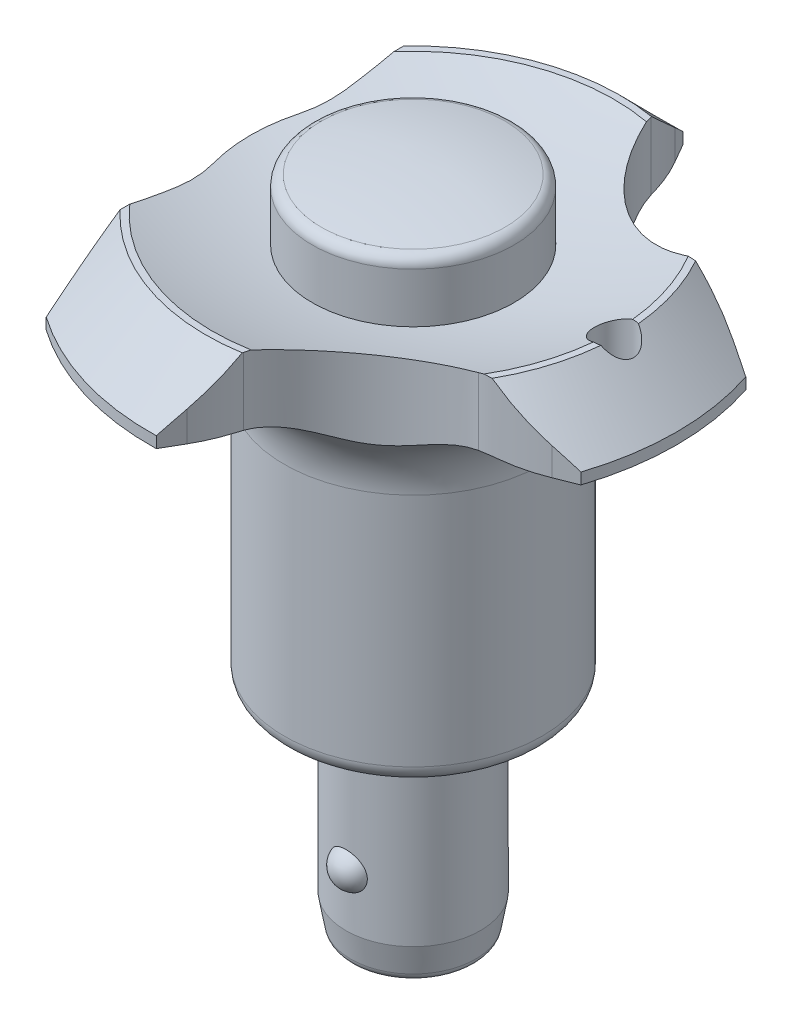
ISO-10303-21;
HEADER;
FILE_DESCRIPTION(('STEP AP214'),'2;1');
FILE_NAME('part.step','',(''),(''),'','','');
FILE_SCHEMA(('AUTOMOTIVE_DESIGN { 1 0 10303 214 1 1 1 1 }'));
ENDSEC;
DATA;
#1=APPLICATION_CONTEXT('core data for automotive mechanical design processes');
#2=APPLICATION_PROTOCOL_DEFINITION('international standard','automotive_design',2000,#1);
#3=PRODUCT_CONTEXT('',#1,'mechanical');
#4=PRODUCT('Part','Part','',(#3));
#5=PRODUCT_RELATED_PRODUCT_CATEGORY('part','',(#4));
#6=PRODUCT_DEFINITION_FORMATION('','',#4);
#7=PRODUCT_DEFINITION_CONTEXT('part definition',#1,'design');
#8=PRODUCT_DEFINITION('design','',#6,#7);
#9=PRODUCT_DEFINITION_SHAPE('','',#8);
#10=(LENGTH_UNIT() NAMED_UNIT(*) SI_UNIT(.MILLI.,.METRE.));
#11=(NAMED_UNIT(*) PLANE_ANGLE_UNIT() SI_UNIT($,.RADIAN.));
#12=(NAMED_UNIT(*) SI_UNIT($,.STERADIAN.) SOLID_ANGLE_UNIT());
#13=UNCERTAINTY_MEASURE_WITH_UNIT(LENGTH_MEASURE(1.E-05),#10,'distance_accuracy_value','');
#14=(GEOMETRIC_REPRESENTATION_CONTEXT(3) GLOBAL_UNCERTAINTY_ASSIGNED_CONTEXT((#13)) GLOBAL_UNIT_ASSIGNED_CONTEXT((#10,
#11,#12)) REPRESENTATION_CONTEXT('',''));
#15=CARTESIAN_POINT('',(0.,0.,0.));
#16=DIRECTION('',(0.,0.,1.));
#17=DIRECTION('',(1.,0.,0.));
#18=AXIS2_PLACEMENT_3D('',#15,#16,#17);
#19=CARTESIAN_POINT('',(0.,40.,0.));
#20=DIRECTION('',(0.,-1.,0.));
#21=DIRECTION('',(0.,0.,-1.));
#22=AXIS2_PLACEMENT_3D('',#19,#20,#21);
#23=CYLINDRICAL_SURFACE('',#22,9.);
#24=CARTESIAN_POINT('',(0.,38.1918358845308,0.));
#25=DIRECTION('',(0.,-1.,0.));
#26=DIRECTION('',(0.,0.,-1.));
#27=AXIS2_PLACEMENT_3D('',#24,#25,#26);
#28=CIRCLE('',#27,9.);
#29=CARTESIAN_POINT('',(0.,38.1918358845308,-9.));
#30=VERTEX_POINT('',#29);
#31=EDGE_CURVE('P0_E11',#30,#30,#28,.T.);
#32=ORIENTED_EDGE('',*,*,#31,.T.);
#33=EDGE_LOOP('',(#32));
#34=FACE_BOUND('',#33,.T.);
#35=CARTESIAN_POINT('',(0.,18.,0.));
#36=DIRECTION('',(0.,1.,0.));
#37=DIRECTION('',(0.,0.,1.));
#38=AXIS2_PLACEMENT_3D('',#35,#36,#37);
#39=CIRCLE('',#38,9.);
#40=CARTESIAN_POINT('',(0.,18.,9.));
#41=VERTEX_POINT('',#40);
#42=EDGE_CURVE('P0_E48',#41,#41,#39,.T.);
#43=ORIENTED_EDGE('',*,*,#42,.T.);
#44=EDGE_LOOP('',(#43));
#45=FACE_BOUND('',#44,.T.);
#46=ADVANCED_FACE('P0_F16',(#34,#45),#23,.T.);
#47=CARTESIAN_POINT('',(0.,18.,0.));
#48=DIRECTION('',(0.,1.,0.));
#49=DIRECTION('',(0.,0.,1.));
#50=AXIS2_PLACEMENT_3D('',#47,#48,#49);
#51=PLANE('',#50);
#52=ORIENTED_EDGE('',*,*,#42,.F.);
#53=EDGE_LOOP('',(#52));
#54=FACE_BOUND('',#53,.T.);
#55=ADVANCED_FACE('P0_F28',(#54),#51,.F.);
#56=CARTESIAN_POINT('',(0.,-0.999999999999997,0.));
#57=DIRECTION('',(0.,1.,0.));
#58=DIRECTION('',(-1.,0.,0.));
#59=AXIS2_PLACEMENT_3D('',#56,#57,#58);
#60=SPHERICAL_SURFACE('',#59,41.);
#61=CARTESIAN_POINT('',(0.,39.1716317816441,0.));
#62=DIRECTION('',(0.,-1.,0.));
#63=DIRECTION('',(0.,0.,-1.));
#64=AXIS2_PLACEMENT_3D('',#61,#62,#63);
#65=CIRCLE('',#64,8.2);
#66=CARTESIAN_POINT('',(0.,39.1716317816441,-8.2));
#67=VERTEX_POINT('',#66);
#68=EDGE_CURVE('P0_E23',#67,#67,#65,.F.);
#69=ORIENTED_EDGE('',*,*,#68,.T.);
#70=EDGE_LOOP('',(#69));
#71=FACE_BOUND('',#70,.T.);
#72=CARTESIAN_POINT('',(0.,40.,0.));
#73=VERTEX_POINT('',#72);
#74=VERTEX_LOOP('',#73);
#75=FACE_BOUND('',#74,.T.);
#76=ADVANCED_FACE('P0_F26',(#71,#75),#60,.T.);
#77=CARTESIAN_POINT('',(0.,38.1918358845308,0.));
#78=DIRECTION('',(0.,-1.,0.));
#79=DIRECTION('',(0.,0.,-1.));
#80=AXIS2_PLACEMENT_3D('',#77,#78,#79);
#81=TOROIDAL_SURFACE('',#80,8.,1.);
#82=ORIENTED_EDGE('',*,*,#31,.F.);
#83=EDGE_LOOP('',(#82));
#84=FACE_BOUND('',#83,.T.);
#85=ORIENTED_EDGE('',*,*,#68,.F.);
#86=EDGE_LOOP('',(#85));
#87=FACE_BOUND('',#86,.T.);
#88=ADVANCED_FACE('P0_F18',(#84,#87),#81,.T.);
#89=CLOSED_SHELL('',(#46,#55,#76,#88));
#90=MANIFOLD_SOLID_BREP('P0_B1',#89);
#91=CARTESIAN_POINT('',(-23.5,36.,0.));
#92=DIRECTION('',(0.,1.,0.));
#93=DIRECTION('',(-1.,0.,0.));
#94=AXIS2_PLACEMENT_3D('',#91,#92,#93);
#95=PLANE('',#94);
#96=CARTESIAN_POINT('',(0.,36.,0.));
#97=DIRECTION('',(0.,1.,0.));
#98=DIRECTION('',(-1.,0.,0.));
#99=AXIS2_PLACEMENT_3D('',#96,#97,#98);
#100=CIRCLE('',#99,17.9164728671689);
#101=CARTESIAN_POINT('',(17.8310068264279,36.,-1.74791177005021));
#102=VERTEX_POINT('',#101);
#103=CARTESIAN_POINT('',(15.4319392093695,36.,-9.10248604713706));
#104=VERTEX_POINT('',#103);
#105=EDGE_CURVE('P1_E287',#102,#104,#100,.T.);
#106=ORIENTED_EDGE('',*,*,#105,.F.);
#107=CARTESIAN_POINT('',(17.9164728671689,36.,0.));
#108=DIRECTION('',(0.,1.,0.));
#109=DIRECTION('',(0.,0.,1.));
#110=AXIS2_PLACEMENT_3D('',#107,#108,#109);
#111=CIRCLE('',#110,1.75);
#112=CARTESIAN_POINT('',(18.4240364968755,36.,-1.67477734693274));
#113=VERTEX_POINT('',#112);
#114=EDGE_CURVE('P1_E40',#113,#102,#111,.T.);
#115=ORIENTED_EDGE('',*,*,#114,.F.);
#116=CARTESIAN_POINT('',(0.,36.,0.));
#117=DIRECTION('',(0.,1.,0.));
#118=DIRECTION('',(-1.,0.,0.));
#119=AXIS2_PLACEMENT_3D('',#116,#117,#118);
#120=CIRCLE('',#119,18.5);
#121=CARTESIAN_POINT('',(16.1204041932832,36.,-9.07648437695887));
#122=VERTEX_POINT('',#121);
#123=EDGE_CURVE('P1_E231',#113,#122,#120,.T.);
#124=ORIENTED_EDGE('',*,*,#123,.T.);
#125=CARTESIAN_POINT('',(15.2479619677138,36.,4.89630505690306));
#126=DIRECTION('',(0.,-1.,0.));
#127=DIRECTION('',(0.,0.,-1.));
#128=AXIS2_PLACEMENT_3D('',#125,#126,#127);
#129=CIRCLE('',#128,14.);
#130=EDGE_CURVE('P1_E497',#104,#122,#129,.T.);
#131=ORIENTED_EDGE('',*,*,#130,.F.);
#132=EDGE_LOOP('',(#106,#115,#124,#131));
#133=FACE_BOUND('',#132,.T.);
#134=ADVANCED_FACE('P1_F16',(#133),#95,.T.);
#135=CARTESIAN_POINT('',(16.120404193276,36.,9.07648437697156));
#136=VERTEX_POINT('',#135);
#137=CARTESIAN_POINT('',(18.4240364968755,36.,1.67477734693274));
#138=VERTEX_POINT('',#137);
#139=EDGE_CURVE('P1_E229',#136,#138,#120,.T.);
#140=ORIENTED_EDGE('',*,*,#139,.T.);
#141=CARTESIAN_POINT('',(17.8310068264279,36.,1.74791177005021));
#142=VERTEX_POINT('',#141);
#143=EDGE_CURVE('P1_E213',#142,#138,#111,.T.);
#144=ORIENTED_EDGE('',*,*,#143,.F.);
#145=CARTESIAN_POINT('',(15.4319392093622,36.,9.1024860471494));
#146=VERTEX_POINT('',#145);
#147=EDGE_CURVE('P1_E285',#146,#142,#100,.T.);
#148=ORIENTED_EDGE('',*,*,#147,.F.);
#149=CARTESIAN_POINT('',(15.2479619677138,36.,-4.89630505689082));
#150=DIRECTION('',(0.,-1.,0.));
#151=DIRECTION('',(0.,0.,1.));
#152=AXIS2_PLACEMENT_3D('',#149,#150,#151);
#153=CIRCLE('',#152,14.);
#154=EDGE_CURVE('P1_E236',#136,#146,#153,.T.);
#155=ORIENTED_EDGE('',*,*,#154,.F.);
#156=EDGE_LOOP('',(#140,#144,#148,#155));
#157=FACE_BOUND('',#156,.T.);
#158=ADVANCED_FACE('P1_F235',(#157),#95,.T.);
#159=CARTESIAN_POINT('',(-19.,30.,0.));
#160=DIRECTION('',(0.,-1.,0.));
#161=DIRECTION('',(1.,0.,0.));
#162=AXIS2_PLACEMENT_3D('',#159,#160,#161);
#163=PLANE('',#162);
#164=CARTESIAN_POINT('',(0.,30.,0.));
#165=DIRECTION('',(0.,1.,0.));
#166=DIRECTION('',(-1.,0.,0.));
#167=AXIS2_PLACEMENT_3D('',#164,#165,#166);
#168=CIRCLE('',#167,19.);
#169=CARTESIAN_POINT('',(16.7190893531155,30.,9.02618696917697));
#170=VERTEX_POINT('',#169);
#171=CARTESIAN_POINT('',(18.9472979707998,30.,1.41417806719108));
#172=VERTEX_POINT('',#171);
#173=EDGE_CURVE('P1_E265',#170,#172,#168,.T.);
#174=ORIENTED_EDGE('',*,*,#173,.T.);
#175=CARTESIAN_POINT('',(17.9164728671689,30.,0.));
#176=DIRECTION('',(0.,-1.,0.));
#177=DIRECTION('',(1.,0.,0.));
#178=AXIS2_PLACEMENT_3D('',#175,#176,#177);
#179=CIRCLE('',#178,1.75);
#180=CARTESIAN_POINT('',(18.9472979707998,30.,-1.41417806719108));
#181=VERTEX_POINT('',#180);
#182=EDGE_CURVE('P1_E32',#172,#181,#179,.F.);
#183=ORIENTED_EDGE('',*,*,#182,.T.);
#184=CARTESIAN_POINT('',(16.7190893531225,30.,-9.02618696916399));
#185=VERTEX_POINT('',#184);
#186=EDGE_CURVE('P1_E266',#181,#185,#168,.T.);
#187=ORIENTED_EDGE('',*,*,#186,.T.);
#188=CARTESIAN_POINT('',(15.2479619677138,30.,4.89630505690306));
#189=DIRECTION('',(0.,-1.,0.));
#190=DIRECTION('',(1.,0.,0.));
#191=AXIS2_PLACEMENT_3D('',#188,#189,#190);
#192=CIRCLE('',#191,14.);
#193=CARTESIAN_POINT('',(20.465066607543,30.,-8.09530066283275));
#194=VERTEX_POINT('',#193);
#195=EDGE_CURVE('P1_E767',#185,#194,#192,.T.);
#196=ORIENTED_EDGE('',*,*,#195,.T.);
#197=DIRECTION('',(0.927971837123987,0.,0.372650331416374));
#198=VECTOR('',#197,1.);
#199=CARTESIAN_POINT('',(-10.7201265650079,30.,-20.6184959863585));
#200=LINE('',#199,#198);
#201=CARTESIAN_POINT('',(22.321010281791,30.,-7.35));
#202=VERTEX_POINT('',#201);
#203=EDGE_CURVE('P1_E595',#194,#202,#200,.T.);
#204=ORIENTED_EDGE('',*,*,#203,.T.);
#205=CARTESIAN_POINT('',(0.,30.,0.));
#206=DIRECTION('',(0.,1.,0.));
#207=DIRECTION('',(-1.,0.,0.));
#208=AXIS2_PLACEMENT_3D('',#205,#206,#207);
#209=CIRCLE('',#208,23.5);
#210=CARTESIAN_POINT('',(22.321010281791,30.,7.35000000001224));
#211=VERTEX_POINT('',#210);
#212=EDGE_CURVE('P1_E251',#211,#202,#209,.T.);
#213=ORIENTED_EDGE('',*,*,#212,.F.);
#214=DIRECTION('',(-0.927971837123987,0.,0.372650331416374));
#215=VECTOR('',#214,1.);
#216=CARTESIAN_POINT('',(-10.7201265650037,30.,20.6184959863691));
#217=LINE('',#216,#215);
#218=CARTESIAN_POINT('',(20.465066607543,30.,8.09530066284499));
#219=VERTEX_POINT('',#218);
#220=EDGE_CURVE('P1_E708',#211,#219,#217,.T.);
#221=ORIENTED_EDGE('',*,*,#220,.T.);
#222=CARTESIAN_POINT('',(15.2479619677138,30.,-4.89630505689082));
#223=DIRECTION('',(0.,-1.,0.));
#224=DIRECTION('',(1.,0.,0.));
#225=AXIS2_PLACEMENT_3D('',#222,#223,#224);
#226=CIRCLE('',#225,14.);
#227=EDGE_CURVE('P1_E665',#219,#170,#226,.T.);
#228=ORIENTED_EDGE('',*,*,#227,.T.);
#229=EDGE_LOOP('',(#174,#183,#187,#196,#204,#213,#221,#228));
#230=FACE_BOUND('',#229,.T.);
#231=ADVANCED_FACE('P1_F612',(#230),#163,.T.);
#232=CARTESIAN_POINT('',(0.,22.5,0.));
#233=DIRECTION('',(0.,1.,0.));
#234=DIRECTION('',(-1.,0.,0.));
#235=AXIS2_PLACEMENT_3D('',#232,#233,#234);
#236=TOROIDAL_SURFACE('',#235,19.,7.5);
#237=CARTESIAN_POINT('',(0.,22.5,0.));
#238=DIRECTION('',(0.,1.,0.));
#239=DIRECTION('',(-1.,0.,0.));
#240=AXIS2_PLACEMENT_3D('',#237,#238,#239);
#241=CIRCLE('',#240,11.5);
#242=CARTESIAN_POINT('',(-11.5,22.5,0.));
#243=VERTEX_POINT('',#242);
#244=EDGE_CURVE('P1_E274',#243,#243,#241,.T.);
#245=ORIENTED_EDGE('',*,*,#244,.T.);
#246=EDGE_LOOP('',(#245));
#247=FACE_BOUND('',#246,.T.);
#248=ORIENTED_EDGE('',*,*,#186,.F.);
#249=CARTESIAN_POINT('',(19.0002,29.9998345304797,-1.37405804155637));
#250=CARTESIAN_POINT('',(18.9621670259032,30.0000721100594,-1.40405462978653));
#251=CARTESIAN_POINT('',(18.9229043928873,30.0000618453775,-1.43245842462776));
#252=CARTESIAN_POINT('',(18.8421643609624,29.99943926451,-1.48591451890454));
#253=CARTESIAN_POINT('',(18.8006869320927,29.998826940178,-1.51096677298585));
#254=CARTESIAN_POINT('',(18.6734351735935,29.9959303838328,-1.58077253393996));
#255=CARTESIAN_POINT('',(18.584719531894,29.992587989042,-1.62027093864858));
#256=CARTESIAN_POINT('',(18.4021303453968,29.9824016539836,-1.68404521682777));
#257=CARTESIAN_POINT('',(18.3082526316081,29.9755548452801,-1.7083085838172));
#258=CARTESIAN_POINT('',(18.1181618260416,29.9579679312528,-1.74100944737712));
#259=CARTESIAN_POINT('',(18.0219496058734,29.9472292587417,-1.74945276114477));
#260=CARTESIAN_POINT('',(17.8303366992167,29.9218778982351,-1.75049381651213));
#261=CARTESIAN_POINT('',(17.7349343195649,29.9072800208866,-1.7431513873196));
#262=CARTESIAN_POINT('',(17.5471606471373,29.8745519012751,-1.71322871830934));
#263=CARTESIAN_POINT('',(17.4547903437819,29.8564205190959,-1.69064355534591));
#264=CARTESIAN_POINT('',(17.2734017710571,29.8169200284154,-1.63042918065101));
#265=CARTESIAN_POINT('',(17.1845073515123,29.7954867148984,-1.59246980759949));
#266=CARTESIAN_POINT('',(17.0144903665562,29.7508341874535,-1.50272225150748));
#267=CARTESIAN_POINT('',(16.9333693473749,29.7276146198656,-1.45093132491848));
#268=CARTESIAN_POINT('',(16.7775437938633,29.6798339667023,-1.33241085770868));
#269=CARTESIAN_POINT('',(16.7032498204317,29.655257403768,-1.26514688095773));
#270=CARTESIAN_POINT('',(16.5669685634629,29.6075854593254,-1.11863761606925));
#271=CARTESIAN_POINT('',(16.5049842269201,29.584490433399,-1.03938946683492));
#272=CARTESIAN_POINT('',(16.3947891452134,29.5417064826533,-0.870191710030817));
#273=CARTESIAN_POINT('',(16.3466708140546,29.5220407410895,-0.78017571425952));
#274=CARTESIAN_POINT('',(16.2665762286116,29.4884206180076,-0.592245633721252));
#275=CARTESIAN_POINT('',(16.2345892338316,29.4744624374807,-0.494336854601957));
#276=CARTESIAN_POINT('',(16.1897704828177,29.4546698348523,-0.300388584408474));
#277=CARTESIAN_POINT('',(16.175801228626,29.4483547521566,-0.204661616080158));
#278=CARTESIAN_POINT('',(16.1638587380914,29.442965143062,-0.0120283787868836));
#279=CARTESIAN_POINT('',(16.1658787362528,29.4438875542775,0.0848773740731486));
#280=CARTESIAN_POINT('',(16.1851398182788,29.452552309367,0.270399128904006));
#281=CARTESIAN_POINT('',(16.201378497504,29.4598454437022,0.359143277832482));
#282=CARTESIAN_POINT('',(16.2470514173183,29.4798790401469,0.532513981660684));
#283=CARTESIAN_POINT('',(16.2764877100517,29.4926203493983,0.617139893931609));
#284=CARTESIAN_POINT('',(16.3484657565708,29.5227477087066,0.782428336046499));
#285=CARTESIAN_POINT('',(16.3913311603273,29.540246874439,0.86292857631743));
#286=CARTESIAN_POINT('',(16.488610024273,29.5782278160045,1.01583807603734));
#287=CARTESIAN_POINT('',(16.543027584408,29.5987106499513,1.08824444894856));
#288=CARTESIAN_POINT('',(16.6668822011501,29.6428521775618,1.22902424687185));
#289=CARTESIAN_POINT('',(16.7371737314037,29.6666338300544,1.29660869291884));
#290=CARTESIAN_POINT('',(16.8879984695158,29.7141504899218,1.41922194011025));
#291=CARTESIAN_POINT('',(16.9685343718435,29.7378854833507,1.47424742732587));
#292=CARTESIAN_POINT('',(17.1413972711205,29.7846942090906,1.57226489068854));
#293=CARTESIAN_POINT('',(17.2340680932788,29.8077030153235,1.61468428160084));
#294=CARTESIAN_POINT('',(17.4260077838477,29.8506027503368,1.68294764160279));
#295=CARTESIAN_POINT('',(17.5252754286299,29.8704942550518,1.70879467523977));
#296=CARTESIAN_POINT('',(17.7248461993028,29.9057260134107,1.74233896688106));
#297=CARTESIAN_POINT('',(17.8250527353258,29.9211725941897,1.75049754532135));
#298=CARTESIAN_POINT('',(18.0259610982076,29.9477661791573,1.74945581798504));
#299=CARTESIAN_POINT('',(18.1266628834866,29.9589135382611,1.74025694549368));
#300=CARTESIAN_POINT('',(18.3214901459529,29.9766047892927,1.70525235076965));
#301=CARTESIAN_POINT('',(18.4157195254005,29.9833094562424,1.68009992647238));
#302=CARTESIAN_POINT('',(18.5988094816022,29.9932000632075,1.61441991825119));
#303=CARTESIAN_POINT('',(18.6876751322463,29.9963893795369,1.57390713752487));
#304=CARTESIAN_POINT('',(18.8124061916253,29.9990115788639,1.5039636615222));
#305=CARTESIAN_POINT('',(18.8514207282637,29.9995392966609,1.48002297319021));
#306=CARTESIAN_POINT('',(18.9273846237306,30.0000621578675,1.42920894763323));
#307=CARTESIAN_POINT('',(18.9643378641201,30.0000583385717,1.40234142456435));
#308=CARTESIAN_POINT('',(19.0002,29.9998345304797,1.37405804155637));
#309=B_SPLINE_CURVE_WITH_KNOTS('',3,(#249,#250,#251,#252,#253,#254,#255,#256,#257,#258,#259,
#260,#261,#262,#263,#264,#265,#266,#267,#268,#269,#270,#271,#272,#273,#274,#275,#276,#277,#278,
#279,#280,#281,#282,#283,#284,#285,#286,#287,#288,#289,#290,#291,#292,#293,#294,#295,#296,#297,
#298,#299,#300,#301,#302,#303,#304,#305,#306,#307,#308),.UNSPECIFIED.,.F.,.F.,(4,2,2,2,2,2,2,2,
2,2,2,2,2,2,2,2,2,2,2,2,2,2,2,2,2,2,2,2,2,4),(0.,0.145230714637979,0.29046339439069,
0.580469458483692,0.870713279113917,1.16085035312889,1.44988972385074,1.73902249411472,
2.03472475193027,2.33048570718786,2.63862322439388,2.94683442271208,3.25705463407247,
3.56706802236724,3.85635873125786,4.14552703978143,4.41581537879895,4.68614576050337,
4.96357032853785,5.24109352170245,5.54087080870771,5.84072710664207,6.15263607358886,
6.46448734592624,6.76810238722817,7.0716923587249,7.36358887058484,7.65520478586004,
7.79241563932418,7.92935872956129),.UNSPECIFIED.);
#310=EDGE_CURVE('P1_E232',#181,#172,#309,.T.);
#311=ORIENTED_EDGE('',*,*,#310,.T.);
#312=ORIENTED_EDGE('',*,*,#173,.F.);
#313=CARTESIAN_POINT('',(19.0002,29.7676490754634,8.59149349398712));
#314=CARTESIAN_POINT('',(18.7645817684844,29.8154776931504,8.65707959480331));
#315=CARTESIAN_POINT('',(18.5258665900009,29.8564543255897,8.71679949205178));
#316=CARTESIAN_POINT('',(18.0433655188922,29.9237457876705,8.82399353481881));
#317=CARTESIAN_POINT('',(17.7995737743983,29.9500426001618,8.87145259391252));
#318=CARTESIAN_POINT('',(17.3135741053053,29.9865231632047,8.95262184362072));
#319=CARTESIAN_POINT('',(17.0714332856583,29.9970209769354,8.98658985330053));
#320=CARTESIAN_POINT('',(16.5857032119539,30.0018812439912,9.04177656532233));
#321=CARTESIAN_POINT('',(16.3421152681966,29.9962565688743,9.06300542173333));
#322=CARTESIAN_POINT('',(15.9045129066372,29.9707577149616,9.08964322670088));
#323=CARTESIAN_POINT('',(15.7104540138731,29.9540015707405,9.09738600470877));
#324=CARTESIAN_POINT('',(15.3219339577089,29.9089292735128,9.10486432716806));
#325=CARTESIAN_POINT('',(15.1274823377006,29.8805202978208,9.10453429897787));
#326=CARTESIAN_POINT('',(14.9341448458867,29.8460787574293,9.10017731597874));
#327=B_SPLINE_CURVE_WITH_KNOTS('',3,(#313,#314,#315,#316,#317,#318,#319,#320,#321,#322,#323,
#324,#325,#326),.UNSPECIFIED.,.F.,.F.,(4,2,2,2,2,2,4),(0.,0.747551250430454,1.49601799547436,
2.22940004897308,2.96219676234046,3.54651953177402,4.13559011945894),.UNSPECIFIED.);
#328=CARTESIAN_POINT('',(14.9343448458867,29.8461143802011,9.10018179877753));
#329=VERTEX_POINT('',#328);
#330=EDGE_CURVE('P1_E662',#170,#329,#327,.T.);
#331=ORIENTED_EDGE('',*,*,#330,.T.);
#332=CARTESIAN_POINT('',(14.9345448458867,29.8461499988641,9.1001862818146));
#333=CARTESIAN_POINT('',(14.7776730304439,29.8182229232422,9.09666592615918));
#334=CARTESIAN_POINT('',(14.6213761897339,29.7868945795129,9.0962420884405));
#335=CARTESIAN_POINT('',(14.3102869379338,29.7182450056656,9.10142249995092));
#336=CARTESIAN_POINT('',(14.1554937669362,29.6809269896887,9.10702352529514));
#337=CARTESIAN_POINT('',(13.8480463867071,29.6011924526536,9.12406045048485));
#338=CARTESIAN_POINT('',(13.6953872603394,29.558791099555,9.13547930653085));
#339=CARTESIAN_POINT('',(13.3918757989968,29.4696235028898,9.16398000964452));
#340=CARTESIAN_POINT('',(13.2410237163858,29.4228566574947,9.18106263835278));
#341=CARTESIAN_POINT('',(12.7875574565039,29.2760524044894,9.24107419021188));
#342=CARTESIAN_POINT('',(12.4878197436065,29.1705318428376,9.2925514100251));
#343=CARTESIAN_POINT('',(11.8954511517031,28.9523945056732,9.41733991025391));
#344=CARTESIAN_POINT('',(11.6028250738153,28.8397731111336,9.49066552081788));
#345=CARTESIAN_POINT('',(11.0926476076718,28.6428308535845,9.63910928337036));
#346=CARTESIAN_POINT('',(10.8738718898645,28.5581805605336,9.70960863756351));
#347=CARTESIAN_POINT('',(10.4388960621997,28.3943373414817,9.86379108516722));
#348=CARTESIAN_POINT('',(10.2226957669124,28.3151440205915,9.94747322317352));
#349=CARTESIAN_POINT('',(9.79395589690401,28.1682154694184,10.1280569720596));
#350=CARTESIAN_POINT('',(9.58140098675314,28.1003976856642,10.2248532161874));
#351=CARTESIAN_POINT('',(9.15855200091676,27.9817636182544,10.4328111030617));
#352=CARTESIAN_POINT('',(8.94825640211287,27.9309350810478,10.5439623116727));
#353=CARTESIAN_POINT('',(8.58999154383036,27.8634617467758,10.747410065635));
#354=CARTESIAN_POINT('',(8.44110862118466,27.84122530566,10.836232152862));
#355=CARTESIAN_POINT('',(8.14633439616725,27.8104352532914,11.0209454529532));
#356=CARTESIAN_POINT('',(8.00044250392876,27.8018789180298,11.1168352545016));
#357=CARTESIAN_POINT('',(7.71306255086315,27.7991870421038,11.3148595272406));
#358=CARTESIAN_POINT('',(7.57156970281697,27.8050352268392,11.4169868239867));
#359=CARTESIAN_POINT('',(7.29397056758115,27.8306044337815,11.6266694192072));
#360=CARTESIAN_POINT('',(7.15786521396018,27.8503278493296,11.7342256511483));
#361=CARTESIAN_POINT('',(6.8451762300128,27.9111902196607,11.9924277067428));
#362=CARTESIAN_POINT('',(6.67114087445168,27.9574144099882,12.1449541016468));
#363=CARTESIAN_POINT('',(6.33499245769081,28.0668600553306,12.4568670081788));
#364=CARTESIAN_POINT('',(6.17288820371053,28.1300939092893,12.6162584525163));
#365=CARTESIAN_POINT('',(5.8588669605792,28.2683729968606,12.9427574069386));
#366=CARTESIAN_POINT('',(5.70705355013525,28.3435184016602,13.1099209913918));
#367=CARTESIAN_POINT('',(5.41445292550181,28.5000172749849,13.4507337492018));
#368=CARTESIAN_POINT('',(5.27366434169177,28.5813699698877,13.6243821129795));
#369=CARTESIAN_POINT('',(4.94422002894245,28.781188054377,14.0545977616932));
#370=CARTESIAN_POINT('',(4.76089734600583,28.9006217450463,14.3148176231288));
#371=CARTESIAN_POINT('',(4.41415052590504,29.1328851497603,14.851278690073));
#372=CARTESIAN_POINT('',(4.25073675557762,29.2457114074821,15.1275281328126));
#373=CARTESIAN_POINT('',(3.94580620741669,29.4548897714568,15.6943820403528));
#374=CARTESIAN_POINT('',(3.80410495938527,29.5513814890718,15.9848342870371));
#375=CARTESIAN_POINT('',(3.54271052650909,29.7210428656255,16.5817874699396));
#376=CARTESIAN_POINT('',(3.42298501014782,29.7942469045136,16.888263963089));
#377=CARTESIAN_POINT('',(3.26107257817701,29.8814375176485,17.3600045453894));
#378=CARTESIAN_POINT('',(3.20982780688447,29.9068037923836,17.5201218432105));
#379=CARTESIAN_POINT('',(3.11365433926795,29.948991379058,17.8440401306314));
#380=CARTESIAN_POINT('',(3.06875130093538,29.9657786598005,18.0078531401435));
#381=CARTESIAN_POINT('',(3.02727508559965,29.9778008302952,18.1729580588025));
#382=B_SPLINE_CURVE_WITH_KNOTS('',3,(#332,#333,#334,#335,#336,#337,#338,#339,#340,#341,#342,
#343,#344,#345,#346,#347,#348,#349,#350,#351,#352,#353,#354,#355,#356,#357,#358,#359,#360,#361,
#362,#363,#364,#365,#366,#367,#368,#369,#370,#371,#372,#373,#374,#375,#376,#377,#378,#379,#380,
#381),.UNSPECIFIED.,.F.,.F.,(4,2,2,2,2,2,2,2,2,2,2,2,2,2,2,2,2,2,2,2,2,2,2,2,4),(0.,
0.47800831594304,0.955760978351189,1.43212200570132,1.90854880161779,2.87314250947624,
3.83837028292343,4.5728575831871,5.3072916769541,6.03614076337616,6.7644630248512,
7.28819341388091,7.81181950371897,8.33485425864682,8.85797925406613,9.56460548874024,
10.271748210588,10.9851883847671,11.6985397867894,12.7174996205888,13.7369877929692,
14.7472664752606,15.7560466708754,16.2657760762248,16.7775120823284),.UNSPECIFIED.);
#383=CARTESIAN_POINT('',(3.02732533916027,29.977786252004,18.1727580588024));
#384=VERTEX_POINT('',#383);
#385=EDGE_CURVE('P1_E668',#329,#384,#382,.T.);
#386=ORIENTED_EDGE('',*,*,#385,.T.);
#387=CARTESIAN_POINT('',(3.02737559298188,29.9777716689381,18.1725580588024));
#388=CARTESIAN_POINT('',(3.00992607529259,29.9828366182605,18.2420077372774));
#389=CARTESIAN_POINT('',(2.99192781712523,29.9870243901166,18.3113828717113));
#390=CARTESIAN_POINT('',(2.95486116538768,29.9936665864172,18.4498703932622));
#391=CARTESIAN_POINT('',(2.93579364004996,29.9961223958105,18.5189829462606));
#392=CARTESIAN_POINT('',(2.89658780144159,29.9993297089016,18.6569430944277));
#393=CARTESIAN_POINT('',(2.87644948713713,30.000081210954,18.7257906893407));
#394=CARTESIAN_POINT('',(2.83510131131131,29.999904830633,18.8632214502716));
#395=CARTESIAN_POINT('',(2.81389060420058,29.9989756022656,18.931804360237));
#396=CARTESIAN_POINT('',(2.79215946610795,29.9972178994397,19.0002));
#397=B_SPLINE_CURVE_WITH_KNOTS('',3,(#387,#388,#389,#390,#391,#392,#393,#394,#395,#396),
.UNSPECIFIED.,.F.,.F.,(4,2,2,2,4),(0.,0.215353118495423,0.430533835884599,0.645714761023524,
0.861068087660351),.UNSPECIFIED.);
#398=CARTESIAN_POINT('',(2.85903351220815,30.,18.7836611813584));
#399=VERTEX_POINT('',#398);
#400=EDGE_CURVE('P1_E481',#384,#399,#397,.T.);
#401=ORIENTED_EDGE('',*,*,#400,.T.);
#402=CARTESIAN_POINT('',(-13.5,30.,13.3697419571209));
#403=VERTEX_POINT('',#402);
#404=EDGE_CURVE('P1_E258',#403,#399,#168,.T.);
#405=ORIENTED_EDGE('',*,*,#404,.F.);
#406=CARTESIAN_POINT('',(-13.5,29.9987556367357,13.1748723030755));
#407=CARTESIAN_POINT('',(-13.5,29.9924168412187,12.6770440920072));
#408=CARTESIAN_POINT('',(-13.5,29.9620587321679,12.1794760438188));
#409=CARTESIAN_POINT('',(-13.5,29.8617802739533,11.1882999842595));
#410=CARTESIAN_POINT('',(-13.5,29.7918313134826,10.6946950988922));
#411=CARTESIAN_POINT('',(-13.5,29.6203417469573,9.7082076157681));
#412=CARTESIAN_POINT('',(-13.5,29.5184998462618,9.21537895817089));
#413=CARTESIAN_POINT('',(-13.5,29.2930418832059,8.2350970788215));
#414=CARTESIAN_POINT('',(-13.5,29.1694344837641,7.74764180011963));
#415=CARTESIAN_POINT('',(-13.5,28.9580918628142,6.95271991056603));
#416=CARTESIAN_POINT('',(-13.5,28.8736826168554,6.64434256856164));
#417=CARTESIAN_POINT('',(-13.5,28.703475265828,6.02796072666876));
#418=CARTESIAN_POINT('',(-13.5,28.6176771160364,5.71995623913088));
#419=CARTESIAN_POINT('',(-13.5,28.4481300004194,5.10298447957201));
#420=CARTESIAN_POINT('',(-13.5,28.3643835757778,4.79401649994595));
#421=CARTESIAN_POINT('',(-13.5,28.203142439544,4.17441495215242));
#422=CARTESIAN_POINT('',(-13.5,28.1256478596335,3.86378134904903));
#423=CARTESIAN_POINT('',(-13.5,27.9830335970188,3.24620608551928));
#424=CARTESIAN_POINT('',(-13.5,27.9176963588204,2.93931583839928));
#425=CARTESIAN_POINT('',(-13.5,27.8022482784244,2.32263897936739));
#426=CARTESIAN_POINT('',(-13.5,27.7521362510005,2.01285259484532));
#427=CARTESIAN_POINT('',(-13.5,27.6717492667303,1.39150502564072));
#428=CARTESIAN_POINT('',(-13.5,27.6414178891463,1.07995146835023));
#429=CARTESIAN_POINT('',(-13.5,27.6129625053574,0.611642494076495));
#430=CARTESIAN_POINT('',(-13.5,27.6063176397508,0.455377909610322));
#431=CARTESIAN_POINT('',(-13.5,27.598861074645,0.142712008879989));
#432=CARTESIAN_POINT('',(-13.5,27.59804915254,-0.0136893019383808));
#433=CARTESIAN_POINT('',(-13.5,27.6031913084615,-0.39200451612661));
#434=CARTESIAN_POINT('',(-13.5,27.6121259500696,-0.613883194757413));
#435=CARTESIAN_POINT('',(-13.5,27.6413369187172,-1.05687794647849));
#436=CARTESIAN_POINT('',(-13.5,27.6616135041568,-1.27799400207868));
#437=CARTESIAN_POINT('',(-13.5,27.7124648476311,-1.71936790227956));
#438=CARTESIAN_POINT('',(-13.5,27.7430554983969,-1.93962388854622));
#439=CARTESIAN_POINT('',(-13.5,27.8130621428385,-2.37871324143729));
#440=CARTESIAN_POINT('',(-13.5,27.8524784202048,-2.59754656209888));
#441=CARTESIAN_POINT('',(-13.5,27.9829914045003,-3.25964463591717));
#442=CARTESIAN_POINT('',(-13.5,28.0853395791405,-3.7006686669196));
#443=CARTESIAN_POINT('',(-13.5,28.250681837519,-4.35895221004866));
#444=CARTESIAN_POINT('',(-13.5,28.3077554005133,-4.57780168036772));
#445=CARTESIAN_POINT('',(-13.5,28.4243226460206,-5.014858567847));
#446=CARTESIAN_POINT('',(-13.5,28.4838162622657,-5.23306600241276));
#447=CARTESIAN_POINT('',(-13.5,28.6287855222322,-5.76000994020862));
#448=CARTESIAN_POINT('',(-13.5,28.7147638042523,-6.06860511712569));
#449=CARTESIAN_POINT('',(-13.5,28.8851748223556,-6.68623047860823));
#450=CARTESIAN_POINT('',(-13.5,28.9696075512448,-6.99526066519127));
#451=CARTESIAN_POINT('',(-13.5,29.1338478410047,-7.61467540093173));
#452=CARTESIAN_POINT('',(-13.5,29.2136538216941,-7.92506037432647));
#453=CARTESIAN_POINT('',(-13.5,29.365807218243,-8.54767359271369));
#454=CARTESIAN_POINT('',(-13.5,29.4381546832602,-8.85990182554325));
#455=CARTESIAN_POINT('',(-13.5,29.5720143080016,-9.48287595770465));
#456=CARTESIAN_POINT('',(-13.5,29.6336433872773,-9.79359642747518));
#457=CARTESIAN_POINT('',(-13.5,29.7447204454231,-10.417241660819));
#458=CARTESIAN_POINT('',(-13.5,29.7941682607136,-10.7301664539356));
#459=CARTESIAN_POINT('',(-13.5,29.878553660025,-11.3576940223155));
#460=CARTESIAN_POINT('',(-13.5,29.9135051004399,-11.6722949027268));
#461=CARTESIAN_POINT('',(-13.5,29.9667331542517,-12.3028943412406));
#462=CARTESIAN_POINT('',(-13.5,29.9850124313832,-12.6188926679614));
#463=CARTESIAN_POINT('',(-13.5,30.0022109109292,-13.2332096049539));
#464=CARTESIAN_POINT('',(-13.5,30.0021857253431,-13.5314969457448));
#465=CARTESIAN_POINT('',(-13.5,29.9836150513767,-14.1274414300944));
#466=CARTESIAN_POINT('',(-13.5,29.9650752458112,-14.42509873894));
#467=CARTESIAN_POINT('',(-13.5,29.9076562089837,-15.0195846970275));
#468=CARTESIAN_POINT('',(-13.5,29.86870294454,-15.3164063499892));
#469=CARTESIAN_POINT('',(-13.5,29.7687719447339,-15.9063618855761));
#470=CARTESIAN_POINT('',(-13.5,29.7077944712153,-16.1994958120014));
#471=CARTESIAN_POINT('',(-13.5,29.5615487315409,-16.7830242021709));
#472=CARTESIAN_POINT('',(-13.5,29.4760281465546,-17.0733560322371));
#473=CARTESIAN_POINT('',(-13.5,29.2796861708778,-17.6453264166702));
#474=CARTESIAN_POINT('',(-13.5,29.1688706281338,-17.9269669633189));
#475=CARTESIAN_POINT('',(-13.5,28.9212562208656,-18.4778682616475));
#476=CARTESIAN_POINT('',(-13.5,28.7845174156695,-18.747155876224));
#477=CARTESIAN_POINT('',(-13.5,28.4844149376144,-19.2704379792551));
#478=CARTESIAN_POINT('',(-13.5,28.3210631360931,-19.524439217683));
#479=CARTESIAN_POINT('',(-13.5,28.0201042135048,-19.9409786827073));
#480=CARTESIAN_POINT('',(-13.5,27.8891595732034,-20.1083597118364));
#481=CARTESIAN_POINT('',(-13.5,27.614382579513,-20.4321691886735));
#482=CARTESIAN_POINT('',(-13.5,27.470553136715,-20.5886000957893));
#483=CARTESIAN_POINT('',(-13.5,27.1704413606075,-20.8890343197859));
#484=CARTESIAN_POINT('',(-13.5,27.0141593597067,-21.0330379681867));
#485=CARTESIAN_POINT('',(-13.5,26.6897990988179,-21.3071275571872));
#486=CARTESIAN_POINT('',(-13.5,26.5217203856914,-21.4372129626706));
#487=CARTESIAN_POINT('',(-13.5,26.1736846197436,-21.6826822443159));
#488=CARTESIAN_POINT('',(-13.5,25.9936651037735,-21.7979777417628));
#489=CARTESIAN_POINT('',(-13.5,25.6238025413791,-22.0115537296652));
#490=CARTESIAN_POINT('',(-13.5,25.4339603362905,-22.109835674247));
#491=CARTESIAN_POINT('',(-13.5,25.0459142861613,-22.288072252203));
#492=CARTESIAN_POINT('',(-13.5,24.8477129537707,-22.368032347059));
#493=CARTESIAN_POINT('',(-13.5,24.4445484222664,-22.5085422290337));
#494=CARTESIAN_POINT('',(-13.5,24.2395859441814,-22.5690940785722));
#495=CARTESIAN_POINT('',(-13.5,23.845409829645,-22.6648938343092));
#496=CARTESIAN_POINT('',(-13.5,23.6566606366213,-22.7020612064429));
#497=CARTESIAN_POINT('',(-13.5,23.2766143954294,-22.7595086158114));
#498=CARTESIAN_POINT('',(-13.5,23.0853175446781,-22.7797899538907));
#499=CARTESIAN_POINT('',(-13.5,22.7017424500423,-22.8032128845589));
#500=CARTESIAN_POINT('',(-13.5,22.5094645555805,-22.8063602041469));
#501=CARTESIAN_POINT('',(-13.5,22.1253956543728,-22.7954913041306));
#502=CARTESIAN_POINT('',(-13.5,21.9336046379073,-22.7814754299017));
#503=CARTESIAN_POINT('',(-13.5,21.5620262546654,-22.7376357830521));
#504=CARTESIAN_POINT('',(-13.5,21.382136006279,-22.7086777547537));
#505=CARTESIAN_POINT('',(-13.5,21.0253491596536,-22.6358137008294));
#506=CARTESIAN_POINT('',(-13.5,20.8484535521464,-22.5919028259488));
#507=CARTESIAN_POINT('',(-13.5,20.4989658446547,-22.4896248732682));
#508=CARTESIAN_POINT('',(-13.5,20.3263722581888,-22.4312628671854));
#509=CARTESIAN_POINT('',(-13.5,19.9864527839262,-22.3006582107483));
#510=CARTESIAN_POINT('',(-13.5,19.8191289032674,-22.2284103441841));
#511=CARTESIAN_POINT('',(-13.5,19.4877351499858,-22.0692983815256));
#512=CARTESIAN_POINT('',(-13.5,19.3237842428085,-21.9821867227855));
#513=CARTESIAN_POINT('',(-13.5,19.0032931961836,-21.7951520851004));
#514=CARTESIAN_POINT('',(-13.5,18.8467557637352,-21.6952244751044));
#515=CARTESIAN_POINT('',(-13.5,18.5419871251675,-21.4835596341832));
#516=CARTESIAN_POINT('',(-13.5,18.3937525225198,-21.3718272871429));
#517=CARTESIAN_POINT('',(-13.5,18.1060980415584,-21.1374586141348));
#518=CARTESIAN_POINT('',(-13.5,17.9666813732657,-21.0148183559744));
#519=CARTESIAN_POINT('',(-13.5,17.6863078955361,-20.7493457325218));
#520=CARTESIAN_POINT('',(-13.5,17.5461377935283,-20.6056825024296));
#521=CARTESIAN_POINT('',(-13.5,17.2771242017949,-20.3080309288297));
#522=CARTESIAN_POINT('',(-13.5,17.148285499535,-20.154038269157));
#523=CARTESIAN_POINT('',(-13.5,16.9021770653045,-19.8368972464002));
#524=CARTESIAN_POINT('',(-13.5,16.7849162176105,-19.6737420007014));
#525=CARTESIAN_POINT('',(-13.5,16.5621878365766,-19.3395637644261));
#526=CARTESIAN_POINT('',(-13.5,16.4567217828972,-19.1685397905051));
#527=CARTESIAN_POINT('',(-13.5,16.2435133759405,-18.7951173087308));
#528=CARTESIAN_POINT('',(-13.5,16.137554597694,-18.5916998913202));
#529=CARTESIAN_POINT('',(-13.5,15.9408045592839,-18.1776569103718));
#530=CARTESIAN_POINT('',(-13.5,15.850015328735,-17.9670303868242));
#531=CARTESIAN_POINT('',(-13.5,15.683405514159,-17.5403818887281));
#532=CARTESIAN_POINT('',(-13.5,15.6075588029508,-17.324370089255));
#533=CARTESIAN_POINT('',(-13.5,15.4701632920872,-16.8879105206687));
#534=CARTESIAN_POINT('',(-13.5,15.4086128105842,-16.6674632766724));
#535=CARTESIAN_POINT('',(-13.5,15.2670791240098,-16.0926869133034));
#536=CARTESIAN_POINT('',(-13.5,15.1974994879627,-15.7357636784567));
#537=CARTESIAN_POINT('',(-13.5,15.0901312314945,-15.0168555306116));
#538=CARTESIAN_POINT('',(-13.5,15.0523841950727,-14.6548646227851));
#539=CARTESIAN_POINT('',(-13.5,15.0055880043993,-13.9260016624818));
#540=CARTESIAN_POINT('',(-13.5,14.9967840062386,-13.5591142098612));
#541=CARTESIAN_POINT('',(-13.5,15.0031487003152,-13.0095769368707));
#542=CARTESIAN_POINT('',(-13.5,15.0085147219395,-12.8267393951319));
#543=CARTESIAN_POINT('',(-13.5,15.0253205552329,-12.4613413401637));
#544=CARTESIAN_POINT('',(-13.5,15.0367603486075,-12.2787808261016));
#545=CARTESIAN_POINT('',(-13.5,15.079192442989,-11.7364984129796));
#546=CARTESIAN_POINT('',(-13.5,15.1183763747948,-11.3774025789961));
#547=CARTESIAN_POINT('',(-13.5,15.2154863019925,-10.661714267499));
#548=CARTESIAN_POINT('',(-13.5,15.2734187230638,-10.3051226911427));
#549=CARTESIAN_POINT('',(-13.5,15.4046844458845,-9.59448136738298));
#550=CARTESIAN_POINT('',(-13.5,15.4780321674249,-9.24043432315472));
#551=CARTESIAN_POINT('',(-13.5,15.6365290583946,-8.53506811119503));
#552=CARTESIAN_POINT('',(-13.5,15.7216772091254,-8.18374871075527));
#553=CARTESIAN_POINT('',(-13.5,15.9001867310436,-7.4823191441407));
#554=CARTESIAN_POINT('',(-13.5,15.9935676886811,-7.13221404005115));
#555=CARTESIAN_POINT('',(-13.5,16.1841157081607,-6.43304311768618));
#556=CARTESIAN_POINT('',(-13.5,16.2812828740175,-6.08397732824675));
#557=CARTESIAN_POINT('',(-13.5,16.4746449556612,-5.38513895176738));
#558=CARTESIAN_POINT('',(-13.5,16.5708386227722,-5.03536601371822));
#559=CARTESIAN_POINT('',(-13.5,16.7564205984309,-4.3339385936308));
#560=CARTESIAN_POINT('',(-13.5,16.8458082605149,-3.98228393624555));
#561=CARTESIAN_POINT('',(-13.5,17.0117222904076,-3.27303931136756));
#562=CARTESIAN_POINT('',(-13.5,17.0881452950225,-2.91542452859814));
#563=CARTESIAN_POINT('',(-13.5,17.2197408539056,-2.19620106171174));
#564=CARTESIAN_POINT('',(-13.5,17.2749186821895,-1.83459339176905));
#565=CARTESIAN_POINT('',(-13.5,17.336561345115,-1.29065179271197));
#566=CARTESIAN_POINT('',(-13.5,17.3535732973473,-1.10949764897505));
#567=CARTESIAN_POINT('',(-13.5,17.3800792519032,-0.746630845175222));
#568=CARTESIAN_POINT('',(-13.5,17.3895733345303,-0.564918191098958));
#569=CARTESIAN_POINT('',(-13.5,17.4006762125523,-0.201276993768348));
#570=CARTESIAN_POINT('',(-13.5,17.4022861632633,-0.0193484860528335));
#571=CARTESIAN_POINT('',(-13.5,17.397564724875,0.344404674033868));
#572=CARTESIAN_POINT('',(-13.5,17.3912333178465,0.526229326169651));
#573=CARTESIAN_POINT('',(-13.5,17.370879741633,0.889241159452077));
#574=CARTESIAN_POINT('',(-13.5,17.3568661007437,1.07042882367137));
#575=CARTESIAN_POINT('',(-13.5,17.3216694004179,1.43211405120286));
#576=CARTESIAN_POINT('',(-13.5,17.3004855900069,1.6126115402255));
#577=CARTESIAN_POINT('',(-13.5,17.2272119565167,2.15285393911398));
#578=CARTESIAN_POINT('',(-13.5,17.1654037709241,2.51128791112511));
#579=CARTESIAN_POINT('',(-13.5,17.0226182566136,3.22598164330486));
#580=CARTESIAN_POINT('',(-13.5,16.9415476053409,3.58222187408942));
#581=CARTESIAN_POINT('',(-13.5,16.7678033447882,4.29176197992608));
#582=CARTESIAN_POINT('',(-13.5,16.6751306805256,4.64506209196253));
#583=CARTESIAN_POINT('',(-13.5,16.4860053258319,5.34545068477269));
#584=CARTESIAN_POINT('',(-13.5,16.389621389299,5.69255818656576));
#585=CARTESIAN_POINT('',(-13.5,16.1974267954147,6.3862796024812));
#586=CARTESIAN_POINT('',(-13.5,16.1016154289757,6.73289331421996));
#587=CARTESIAN_POINT('',(-13.5,15.9149757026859,7.42741345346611));
#588=CARTESIAN_POINT('',(-13.5,15.8241464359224,7.77531963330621));
#589=CARTESIAN_POINT('',(-13.5,15.651437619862,8.47353970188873));
#590=CARTESIAN_POINT('',(-13.5,15.5695619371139,8.82385456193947));
#591=CARTESIAN_POINT('',(-13.5,15.4183882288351,9.52767763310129));
#592=CARTESIAN_POINT('',(-13.5,15.3491056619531,9.88118921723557));
#593=CARTESIAN_POINT('',(-13.5,15.2267243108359,10.59098994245));
#594=CARTESIAN_POINT('',(-13.5,15.1736226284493,10.9472785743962));
#595=CARTESIAN_POINT('',(-13.5,15.0869435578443,11.6621543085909));
#596=CARTESIAN_POINT('',(-13.5,15.0533596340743,12.0207406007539));
#597=CARTESIAN_POINT('',(-13.5,15.008958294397,12.7392684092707));
#598=CARTESIAN_POINT('',(-13.5,14.9981320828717,13.0992093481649));
#599=CARTESIAN_POINT('',(-13.5,15.001872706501,13.7305269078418));
#600=CARTESIAN_POINT('',(-13.5,15.0108547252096,14.0019377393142));
#601=CARTESIAN_POINT('',(-13.5,15.0448820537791,14.5436948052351));
#602=CARTESIAN_POINT('',(-13.5,15.0699220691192,14.8140413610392));
#603=CARTESIAN_POINT('',(-13.5,15.1374993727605,15.3539354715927));
#604=CARTESIAN_POINT('',(-13.5,15.1801231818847,15.6234723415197));
#605=CARTESIAN_POINT('',(-13.5,15.2840856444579,16.1589765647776));
#606=CARTESIAN_POINT('',(-13.5,15.3454263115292,16.4249435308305));
#607=CARTESIAN_POINT('',(-13.5,15.4884495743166,16.9535595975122));
#608=CARTESIAN_POINT('',(-13.5,15.5702831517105,17.2161681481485));
#609=CARTESIAN_POINT('',(-13.5,15.7549760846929,17.733881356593));
#610=CARTESIAN_POINT('',(-13.5,15.8578319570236,17.9889872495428));
#611=CARTESIAN_POINT('',(-13.5,16.0849375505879,18.4886354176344));
#612=CARTESIAN_POINT('',(-13.5,16.2091240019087,18.7332063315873));
#613=CARTESIAN_POINT('',(-13.5,16.4794606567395,19.2098928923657));
#614=CARTESIAN_POINT('',(-13.5,16.6256051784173,19.4420117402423));
#615=CARTESIAN_POINT('',(-13.5,16.905355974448,19.8416763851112));
#616=CARTESIAN_POINT('',(-13.5,17.0346885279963,20.0122235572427));
#617=CARTESIAN_POINT('',(-13.5,17.3064887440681,20.3424886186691));
#618=CARTESIAN_POINT('',(-13.5,17.448953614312,20.5022087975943));
#619=CARTESIAN_POINT('',(-13.5,17.7467049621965,20.8094151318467));
#620=CARTESIAN_POINT('',(-13.5,17.90199872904,20.9568942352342));
#621=CARTESIAN_POINT('',(-13.5,18.2247008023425,21.2379822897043));
#622=CARTESIAN_POINT('',(-13.5,18.3921094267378,21.3715908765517));
#623=CARTESIAN_POINT('',(-13.5,18.7391302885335,21.6241242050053));
#624=CARTESIAN_POINT('',(-13.5,18.9188060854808,21.7429617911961));
#625=CARTESIAN_POINT('',(-13.5,19.2883579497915,21.9635928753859));
#626=CARTESIAN_POINT('',(-13.5,19.4782341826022,22.0653860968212));
#627=CARTESIAN_POINT('',(-13.5,19.8666634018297,22.250522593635));
#628=CARTESIAN_POINT('',(-13.5,20.0652115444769,22.3338760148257));
#629=CARTESIAN_POINT('',(-13.5,20.4694237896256,22.4810269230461));
#630=CARTESIAN_POINT('',(-13.5,20.6750870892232,22.5448266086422));
#631=CARTESIAN_POINT('',(-13.5,21.070186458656,22.6464196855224));
#632=CARTESIAN_POINT('',(-13.5,21.2591097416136,22.6862160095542));
#633=CARTESIAN_POINT('',(-13.5,21.6397455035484,22.748854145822));
#634=CARTESIAN_POINT('',(-13.5,21.8314578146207,22.7716969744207));
#635=CARTESIAN_POINT('',(-13.5,22.2160993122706,22.8001410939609));
#636=CARTESIAN_POINT('',(-13.5,22.409028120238,22.8057475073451));
#637=CARTESIAN_POINT('',(-13.5,22.7946117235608,22.799663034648));
#638=CARTESIAN_POINT('',(-13.5,22.9872665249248,22.7879725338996));
#639=CARTESIAN_POINT('',(-13.5,23.3601650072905,22.7485629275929));
#640=CARTESIAN_POINT('',(-13.5,23.5405067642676,22.7217642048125));
#641=CARTESIAN_POINT('',(-13.5,23.8983690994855,22.6531451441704));
#642=CARTESIAN_POINT('',(-13.5,24.0758887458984,22.6113199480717));
#643=CARTESIAN_POINT('',(-13.5,24.4267957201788,22.5131145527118));
#644=CARTESIAN_POINT('',(-13.5,24.6001841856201,22.4567384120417));
#645=CARTESIAN_POINT('',(-13.5,24.9417815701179,22.3300126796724));
#646=CARTESIAN_POINT('',(-13.5,25.1099901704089,22.2596622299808));
#647=CARTESIAN_POINT('',(-13.5,25.4429468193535,22.1044245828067));
#648=CARTESIAN_POINT('',(-13.5,25.6075917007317,22.0193163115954));
#649=CARTESIAN_POINT('',(-13.5,25.9295615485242,21.8362376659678));
#650=CARTESIAN_POINT('',(-13.5,26.0868863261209,21.7382669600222));
#651=CARTESIAN_POINT('',(-13.5,26.3934265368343,21.5303846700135));
#652=CARTESIAN_POINT('',(-13.5,26.5426419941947,21.420473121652));
#653=CARTESIAN_POINT('',(-13.5,26.8323677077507,21.1896403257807));
#654=CARTESIAN_POINT('',(-13.5,26.9728748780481,21.0687152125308));
#655=CARTESIAN_POINT('',(-13.5,27.255374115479,20.8069160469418));
#656=CARTESIAN_POINT('',(-13.5,27.3966050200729,20.665220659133));
#657=CARTESIAN_POINT('',(-13.5,27.6678588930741,20.3714070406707));
#658=CARTESIAN_POINT('',(-13.5,27.7978776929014,20.2192849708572));
#659=CARTESIAN_POINT('',(-13.5,28.0463397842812,19.9059182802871));
#660=CARTESIAN_POINT('',(-13.5,28.1647848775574,19.7446750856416));
#661=CARTESIAN_POINT('',(-13.5,28.3900170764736,19.4141800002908));
#662=CARTESIAN_POINT('',(-13.5,28.4968000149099,19.244925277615));
#663=CARTESIAN_POINT('',(-13.5,28.7125731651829,18.8757667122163));
#664=CARTESIAN_POINT('',(-13.5,28.8198384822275,18.6748541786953));
#665=CARTESIAN_POINT('',(-13.5,29.0194050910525,18.2656579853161));
#666=CARTESIAN_POINT('',(-13.5,29.111700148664,18.0573712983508));
#667=CARTESIAN_POINT('',(-13.5,29.2816548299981,17.6347935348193));
#668=CARTESIAN_POINT('',(-13.5,29.3593063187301,17.4204991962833));
#669=CARTESIAN_POINT('',(-13.5,29.5003788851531,16.9872665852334));
#670=CARTESIAN_POINT('',(-13.5,29.563797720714,16.7683275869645));
#671=CARTESIAN_POINT('',(-13.5,29.6908593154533,16.2727081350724));
#672=CARTESIAN_POINT('',(-13.5,29.7507284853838,15.9950577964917));
#673=CARTESIAN_POINT('',(-13.5,29.8504842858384,15.436198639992));
#674=CARTESIAN_POINT('',(-13.5,29.8903676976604,15.1549892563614));
#675=CARTESIAN_POINT('',(-13.5,29.9514871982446,14.5909704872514));
#676=CARTESIAN_POINT('',(-13.5,29.9727489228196,14.3081638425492));
#677=CARTESIAN_POINT('',(-13.5,29.9981875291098,13.7418341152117));
#678=CARTESIAN_POINT('',(-13.5,30.0023646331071,13.4583110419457));
#679=CARTESIAN_POINT('',(-13.5,29.9987556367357,13.1748723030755));
#680=B_SPLINE_CURVE_WITH_KNOTS('',3,(#406,#407,#408,#409,#410,#411,#412,#413,#414,#415,#416,
#417,#418,#419,#420,#421,#422,#423,#424,#425,#426,#427,#428,#429,#430,#431,#432,#433,#434,#435,
#436,#437,#438,#439,#440,#441,#442,#443,#444,#445,#446,#447,#448,#449,#450,#451,#452,#453,#454,
#455,#456,#457,#458,#459,#460,#461,#462,#463,#464,#465,#466,#467,#468,#469,#470,#471,#472,#473,
#474,#475,#476,#477,#478,#479,#480,#481,#482,#483,#484,#485,#486,#487,#488,#489,#490,#491,#492,
#493,#494,#495,#496,#497,#498,#499,#500,#501,#502,#503,#504,#505,#506,#507,#508,#509,#510,#511,
#512,#513,#514,#515,#516,#517,#518,#519,#520,#521,#522,#523,#524,#525,#526,#527,#528,#529,#530,
#531,#532,#533,#534,#535,#536,#537,#538,#539,#540,#541,#542,#543,#544,#545,#546,#547,#548,#549,
#550,#551,#552,#553,#554,#555,#556,#557,#558,#559,#560,#561,#562,#563,#564,#565,#566,#567,#568,
#569,#570,#571,#572,#573,#574,#575,#576,#577,#578,#579,#580,#581,#582,#583,#584,#585,#586,#587,
#588,#589,#590,#591,#592,#593,#594,#595,#596,#597,#598,#599,#600,#601,#602,#603,#604,#605,#606,
#607,#608,#609,#610,#611,#612,#613,#614,#615,#616,#617,#618,#619,#620,#621,#622,#623,#624,#625,
#626,#627,#628,#629,#630,#631,#632,#633,#634,#635,#636,#637,#638,#639,#640,#641,#642,#643,#644,
#645,#646,#647,#648,#649,#650,#651,#652,#653,#654,#655,#656,#657,#658,#659,#660,#661,#662,#663,
#664,#665,#666,#667,#668,#669,#670,#671,#672,#673,#674,#675,#676,#677,#678,#679),.UNSPECIFIED.,
.T.,.F.,(4,2,2,2,2,2,2,2,2,2,2,2,2,2,2,2,2,2,2,2,2,2,2,2,2,2,2,2,2,2,2,2,2,2,2,2,2,2,2,2,2,2,2,
2,2,2,2,2,2,2,2,2,2,2,2,2,2,2,2,2,2,2,2,2,2,2,2,2,2,2,2,2,2,2,2,2,2,2,2,2,2,2,2,2,2,2,2,2,2,2,2,
2,2,2,2,2,2,2,2,2,2,2,2,2,2,2,2,2,2,2,2,2,2,2,2,2,2,2,2,2,2,2,2,2,2,2,2,2,2,2,2,2,2,2,2,2,4),
(0.,1.49333086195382,2.98774229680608,4.49672056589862,6.00509959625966,6.96426250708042,
7.92345636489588,8.88378363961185,9.84413113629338,10.7851623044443,11.7261201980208,
12.6643823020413,13.1335042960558,13.6026083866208,14.2684603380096,14.9343274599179,
15.6012253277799,16.2681446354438,17.6256390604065,18.3041595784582,18.9826615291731,
19.9437130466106,20.9047690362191,21.8661513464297,22.8275273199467,23.7776499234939,
24.727785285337,25.6770103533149,26.6260837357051,27.5204289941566,28.4144998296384,
29.3118358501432,30.2091612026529,31.1160640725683,32.0227574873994,32.9273753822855,
33.8315908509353,34.4685325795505,35.1053307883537,35.7421120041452,36.3789176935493,
37.0193670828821,37.6597617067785,38.2999651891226,38.9401006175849,39.516484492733,
40.0928239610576,40.6689707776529,41.2451060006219,41.7910875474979,42.3372463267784,
42.8832136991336,43.4293865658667,43.9857501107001,44.5423152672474,45.0986510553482,
45.6551882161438,46.2567187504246,46.8585022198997,47.4607439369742,48.0630611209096,
48.7504750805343,49.4379809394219,50.1242738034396,50.8104858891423,51.8996980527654,
52.9903308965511,54.0901782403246,54.6388448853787,55.1875098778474,56.2705452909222,
57.3539522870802,58.4383772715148,59.5227086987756,60.6096932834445,61.696707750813,
62.7849741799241,63.8733438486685,64.9700198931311,66.0664235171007,66.6121425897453,
67.1578558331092,67.7034891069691,68.249123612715,68.7941536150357,69.3392407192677,
70.429597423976,71.525348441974,72.6210102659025,73.7017354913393,74.7805647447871,
75.8591969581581,76.9382931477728,78.0187051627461,79.0989235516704,80.1787800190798,
81.2582190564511,82.0724771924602,82.8864669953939,83.7045107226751,84.5226424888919,
85.3469889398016,86.171198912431,86.9930050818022,87.8145989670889,88.45609853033,
89.097462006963,89.7391924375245,90.3809397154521,91.0263099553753,91.6716906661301,
92.3167153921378,92.9616675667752,93.5401327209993,94.1185631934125,94.6968217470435,
95.275067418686,95.8213945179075,96.3678984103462,96.9142500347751,97.4606352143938,
98.0160523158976,98.5714837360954,99.1269134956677,99.6825389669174,100.282100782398,
100.881884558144,101.48157481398,102.081478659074,102.764079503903,103.446963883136,
104.130226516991,104.813596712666,105.664873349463,106.516287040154,107.366526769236,
108.216755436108),.UNSPECIFIED.);
#681=CARTESIAN_POINT('',(-13.5,29.0987319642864,7.48331477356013));
#682=VERTEX_POINT('',#681);
#683=EDGE_CURVE('P1_E531',#403,#682,#680,.T.);
#684=ORIENTED_EDGE('',*,*,#683,.T.);
#685=CARTESIAN_POINT('',(-13.5000000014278,29.0987843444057,7.48351477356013));
#686=CARTESIAN_POINT('',(-13.5000023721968,29.0587717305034,7.33070875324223));
#687=CARTESIAN_POINT('',(-13.5024976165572,29.0192159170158,7.17776662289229));
#688=CARTESIAN_POINT('',(-13.5125345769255,28.9420831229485,6.87148791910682));
#689=CARTESIAN_POINT('',(-13.5200782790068,28.9045069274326,6.71815121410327));
#690=CARTESIAN_POINT('',(-13.540184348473,28.8327480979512,6.41242888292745));
#691=CARTESIAN_POINT('',(-13.552702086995,28.7985385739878,6.26004672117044));
#692=CARTESIAN_POINT('',(-13.5828339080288,28.7342421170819,5.95492047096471));
#693=CARTESIAN_POINT('',(-13.6004475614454,28.7041548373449,5.80217641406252));
#694=CARTESIAN_POINT('',(-13.6408869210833,28.649129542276,5.49614442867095));
#695=CARTESIAN_POINT('',(-13.6637220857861,28.6242010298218,5.34285601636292));
#696=CARTESIAN_POINT('',(-13.7146406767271,28.5805702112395,5.03627352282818));
#697=CARTESIAN_POINT('',(-13.7427234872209,28.5618671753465,4.88297944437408));
#698=CARTESIAN_POINT('',(-13.8044194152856,28.5313862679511,4.57541637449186));
#699=CARTESIAN_POINT('',(-13.8380777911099,28.5196690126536,4.42115026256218));
#700=CARTESIAN_POINT('',(-13.8925488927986,28.5078949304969,4.1903627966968));
#701=CARTESIAN_POINT('',(-13.9113772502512,28.5049371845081,4.11350838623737));
#702=CARTESIAN_POINT('',(-13.9503477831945,28.5009872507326,3.96007888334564));
#703=CARTESIAN_POINT('',(-13.9704900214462,28.4999951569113,3.88350380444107));
#704=CARTESIAN_POINT('',(-13.9912824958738,28.5000000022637,3.80710049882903));
#705=B_SPLINE_CURVE_WITH_KNOTS('',3,(#685,#686,#687,#688,#689,#690,#691,#692,#693,#694,#695,
#696,#697,#698,#699,#700,#701,#702,#703,#704),.UNSPECIFIED.,.F.,.F.,(4,2,2,2,2,2,2,2,2,4),(0.,
0.473878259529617,0.947943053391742,1.41784708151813,1.88771155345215,2.35843399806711,
2.82910124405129,3.30379521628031,3.54131109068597,3.77883831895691),.UNSPECIFIED.);
#706=CARTESIAN_POINT('',(-13.9912280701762,28.5,3.80730049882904));
#707=VERTEX_POINT('',#706);
#708=EDGE_CURVE('P1_E555',#682,#707,#705,.T.);
#709=ORIENTED_EDGE('',*,*,#708,.T.);
#710=CARTESIAN_POINT('',(0.,28.5,0.));
#711=DIRECTION('',(0.,-1.,0.));
#712=DIRECTION('',(1.,0.,0.));
#713=AXIS2_PLACEMENT_3D('',#710,#711,#712);
#714=CIRCLE('',#713,14.5);
#715=CARTESIAN_POINT('',(-13.9912280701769,28.5,-3.80730049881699));
#716=VERTEX_POINT('',#715);
#717=EDGE_CURVE('P1_E562',#707,#716,#714,.T.);
#718=ORIENTED_EDGE('',*,*,#717,.T.);
#719=CARTESIAN_POINT('',(-13.9912824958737,28.5000000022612,-3.80710049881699));
#720=CARTESIAN_POINT('',(-13.9704900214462,28.4999951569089,-3.88350380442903));
#721=CARTESIAN_POINT('',(-13.9503477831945,28.5009872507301,-3.96007888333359));
#722=CARTESIAN_POINT('',(-13.9113772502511,28.5049371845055,-4.11350838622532));
#723=CARTESIAN_POINT('',(-13.8925488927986,28.5078949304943,-4.19036279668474));
#724=CARTESIAN_POINT('',(-13.8380777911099,28.5196690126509,-4.42115026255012));
#725=CARTESIAN_POINT('',(-13.8044194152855,28.5313862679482,-4.5754163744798));
#726=CARTESIAN_POINT('',(-13.7427234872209,28.5618671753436,-4.88297944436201));
#727=CARTESIAN_POINT('',(-13.714640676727,28.5805702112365,-5.0362735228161));
#728=CARTESIAN_POINT('',(-13.6637220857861,28.6242010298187,-5.34285601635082));
#729=CARTESIAN_POINT('',(-13.6408869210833,28.6491295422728,-5.49614442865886));
#730=CARTESIAN_POINT('',(-13.6004475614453,28.7041548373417,-5.8021764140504));
#731=CARTESIAN_POINT('',(-13.5828339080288,28.7342421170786,-5.95492047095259));
#732=CARTESIAN_POINT('',(-13.552702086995,28.7985385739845,-6.2600467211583));
#733=CARTESIAN_POINT('',(-13.540184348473,28.8327480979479,-6.4124288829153));
#734=CARTESIAN_POINT('',(-13.5200782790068,28.9045069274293,-6.71815121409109));
#735=CARTESIAN_POINT('',(-13.5125345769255,28.9420831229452,-6.87148791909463));
#736=CARTESIAN_POINT('',(-13.5024976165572,29.0192159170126,-7.17776662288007));
#737=CARTESIAN_POINT('',(-13.5000023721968,29.0587717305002,-7.33070875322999));
#738=CARTESIAN_POINT('',(-13.5000000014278,29.0987843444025,-7.48351477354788));
#739=B_SPLINE_CURVE_WITH_KNOTS('',3,(#719,#720,#721,#722,#723,#724,#725,#726,#727,#728,#729,
#730,#731,#732,#733,#734,#735,#736,#737,#738),.UNSPECIFIED.,.F.,.F.,(4,2,2,2,2,2,2,2,2,4),(0.,
0.237527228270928,0.475043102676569,0.949737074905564,1.42040432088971,1.89112676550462,
2.36099123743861,2.83089526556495,3.30496005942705,3.77883831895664),.UNSPECIFIED.);
#740=CARTESIAN_POINT('',(-13.5,29.0987319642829,-7.48331477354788));
#741=VERTEX_POINT('',#740);
#742=EDGE_CURVE('P1_E290',#716,#741,#739,.T.);
#743=ORIENTED_EDGE('',*,*,#742,.T.);
#744=CARTESIAN_POINT('',(-13.5,29.9987556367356,-13.1748723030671));
#745=CARTESIAN_POINT('',(-13.5,30.0027877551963,-13.4914805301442));
#746=CARTESIAN_POINT('',(-13.5,29.9971036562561,-13.8081988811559));
#747=CARTESIAN_POINT('',(-13.5,29.9641984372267,-14.4405917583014));
#748=CARTESIAN_POINT('',(-13.5,29.9369767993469,-14.7562662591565));
#749=CARTESIAN_POINT('',(-13.5,29.8589174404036,-15.3851176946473));
#750=CARTESIAN_POINT('',(-13.5,29.8080509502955,-15.6982911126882));
#751=CARTESIAN_POINT('',(-13.5,29.680809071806,-16.31942914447));
#752=CARTESIAN_POINT('',(-13.5,29.6044392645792,-16.6273948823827));
#753=CARTESIAN_POINT('',(-13.5,29.4429963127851,-17.1730104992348));
#754=CARTESIAN_POINT('',(-13.5,29.3629117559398,-17.4121399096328));
#755=CARTESIAN_POINT('',(-13.5,29.1849208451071,-17.8836634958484));
#756=CARTESIAN_POINT('',(-13.5,29.0870178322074,-18.1160589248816));
#757=CARTESIAN_POINT('',(-13.5,28.8729112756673,-18.5722245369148));
#758=CARTESIAN_POINT('',(-13.5,28.7567122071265,-18.7959968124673));
#759=CARTESIAN_POINT('',(-13.5,28.505728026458,-19.2329080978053));
#760=CARTESIAN_POINT('',(-13.5,28.3709426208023,-19.446046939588));
#761=CARTESIAN_POINT('',(-13.5,28.0814064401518,-19.8614359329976));
#762=CARTESIAN_POINT('',(-13.5,27.9264745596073,-20.0635603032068));
#763=CARTESIAN_POINT('',(-13.5,27.5980858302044,-20.452148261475));
#764=CARTESIAN_POINT('',(-13.5,27.4246321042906,-20.6386144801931));
#765=CARTESIAN_POINT('',(-13.5,27.0600720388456,-20.9932563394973));
#766=CARTESIAN_POINT('',(-13.5,26.8689750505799,-21.1614415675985));
#767=CARTESIAN_POINT('',(-13.5,26.470329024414,-21.477029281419));
#768=CARTESIAN_POINT('',(-13.5,26.2627835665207,-21.624436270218));
#769=CARTESIAN_POINT('',(-13.5,25.8646263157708,-21.8760237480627));
#770=CARTESIAN_POINT('',(-13.5,25.6760116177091,-21.9833732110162));
#771=CARTESIAN_POINT('',(-13.5,25.2894805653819,-22.1797430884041));
#772=CARTESIAN_POINT('',(-13.5,25.0915658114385,-22.2687666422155));
#773=CARTESIAN_POINT('',(-13.5,24.6881815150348,-22.4271915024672));
#774=CARTESIAN_POINT('',(-13.5,24.4827172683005,-22.496606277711));
#775=CARTESIAN_POINT('',(-13.5,24.0659537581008,-22.6148685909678));
#776=CARTESIAN_POINT('',(-13.5,23.854655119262,-22.6637183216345));
#777=CARTESIAN_POINT('',(-13.5,23.4547082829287,-22.7353751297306));
#778=CARTESIAN_POINT('',(-13.5,23.2665002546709,-22.7606603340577));
#779=CARTESIAN_POINT('',(-13.5,22.8885950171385,-22.7945878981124));
#780=CARTESIAN_POINT('',(-13.5,22.6988979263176,-22.8032315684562));
#781=CARTESIAN_POINT('',(-13.5,22.319543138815,-22.8037722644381));
#782=CARTESIAN_POINT('',(-13.5,22.1298854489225,-22.795674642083));
#783=CARTESIAN_POINT('',(-13.5,21.7520155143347,-22.7628416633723));
#784=CARTESIAN_POINT('',(-13.5,21.5638032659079,-22.7381063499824));
#785=CARTESIAN_POINT('',(-13.5,21.1980213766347,-22.6736630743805));
#786=CARTESIAN_POINT('',(-13.5,21.0203342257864,-22.6346191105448));
#787=CARTESIAN_POINT('',(-13.5,20.6687512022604,-22.5419267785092));
#788=CARTESIAN_POINT('',(-13.5,20.4948565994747,-22.4882735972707));
#789=CARTESIAN_POINT('',(-13.5,20.1521011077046,-22.3669525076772));
#790=CARTESIAN_POINT('',(-13.5,19.9832385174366,-22.2992893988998));
#791=CARTESIAN_POINT('',(-13.5,19.6514413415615,-22.1505952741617));
#792=CARTESIAN_POINT('',(-13.5,19.4885089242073,-22.0695594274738));
#793=CARTESIAN_POINT('',(-13.5,19.1647808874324,-21.8923164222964));
#794=CARTESIAN_POINT('',(-13.5,19.0041934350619,-21.7957292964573));
#795=CARTESIAN_POINT('',(-13.5,18.6911564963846,-21.5901573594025));
#796=CARTESIAN_POINT('',(-13.5,18.5387076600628,-21.4811715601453));
#797=CARTESIAN_POINT('',(-13.5,18.2426261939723,-21.2517809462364));
#798=CARTESIAN_POINT('',(-13.5,18.0989951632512,-21.1313740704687));
#799=CARTESIAN_POINT('',(-13.5,17.8211585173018,-20.8802129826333));
#800=CARTESIAN_POINT('',(-13.5,17.6869509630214,-20.7494609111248));
#801=CARTESIAN_POINT('',(-13.5,17.4165079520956,-20.4662308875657));
#802=CARTESIAN_POINT('',(-13.5,17.2812080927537,-20.3128594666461));
#803=CARTESIAN_POINT('',(-13.5,17.0226310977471,-19.9963134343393));
#804=CARTESIAN_POINT('',(-13.5,16.8993543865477,-19.8331384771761));
#805=CARTESIAN_POINT('',(-13.5,16.664927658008,-19.4981532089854));
#806=CARTESIAN_POINT('',(-13.5,16.5537855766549,-19.3263373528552));
#807=CARTESIAN_POINT('',(-13.5,16.3437395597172,-18.9753716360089));
#808=CARTESIAN_POINT('',(-13.5,16.24483776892,-18.7962204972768));
#809=CARTESIAN_POINT('',(-13.5,16.0207039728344,-18.3561639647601));
#810=CARTESIAN_POINT('',(-13.5,15.9015463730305,-18.0921465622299));
#811=CARTESIAN_POINT('',(-13.5,15.6869127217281,-17.5546369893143));
#812=CARTESIAN_POINT('',(-13.5,15.5914451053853,-17.2811414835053));
#813=CARTESIAN_POINT('',(-13.5,15.4232478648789,-16.7273135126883));
#814=CARTESIAN_POINT('',(-13.5,15.3505158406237,-16.4469817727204));
#815=CARTESIAN_POINT('',(-13.5,15.2265589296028,-15.8817013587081));
#816=CARTESIAN_POINT('',(-13.5,15.1753315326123,-15.5967532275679));
#817=CARTESIAN_POINT('',(-13.5,15.0751384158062,-14.8999684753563));
#818=CARTESIAN_POINT('',(-13.5,15.0367499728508,-14.4865968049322));
#819=CARTESIAN_POINT('',(-13.5,14.9967160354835,-13.6578783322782));
#820=CARTESIAN_POINT('',(-13.5,14.9951062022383,-13.2425300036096));
#821=CARTESIAN_POINT('',(-13.5,15.0240181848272,-12.4094715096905));
#822=CARTESIAN_POINT('',(-13.5,15.0548173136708,-11.9917718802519));
#823=CARTESIAN_POINT('',(-13.5,15.1438164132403,-11.1601287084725));
#824=CARTESIAN_POINT('',(-13.5,15.2019704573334,-10.7461800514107));
#825=CARTESIAN_POINT('',(-13.5,15.3554333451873,-9.83309413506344));
#826=CARTESIAN_POINT('',(-13.5,15.4560542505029,-9.33486823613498));
#827=CARTESIAN_POINT('',(-13.5,15.6803779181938,-8.3436458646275));
#828=CARTESIAN_POINT('',(-13.5,15.8040887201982,-7.85065127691));
#829=CARTESIAN_POINT('',(-13.5,15.9991526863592,-7.11226415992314));
#830=CARTESIAN_POINT('',(-13.5,16.0659566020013,-6.86563321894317));
#831=CARTESIAN_POINT('',(-13.5,16.201074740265,-6.37278362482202));
#832=CARTESIAN_POINT('',(-13.5,16.2693889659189,-6.12656497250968));
#833=CARTESIAN_POINT('',(-13.5,16.4058461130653,-5.63398462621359));
#834=CARTESIAN_POINT('',(-13.5,16.4739889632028,-5.38762291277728));
#835=CARTESIAN_POINT('',(-13.5,16.6081638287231,-4.89431806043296));
#836=CARTESIAN_POINT('',(-13.5,16.6741958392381,-4.64737492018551));
#837=CARTESIAN_POINT('',(-13.5,16.8003752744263,-4.15868763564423));
#838=CARTESIAN_POINT('',(-13.5,16.8606298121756,-3.91697147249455));
#839=CARTESIAN_POINT('',(-13.5,16.974903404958,-3.43204784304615));
#840=CARTESIAN_POINT('',(-13.5,17.0289224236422,-3.18884036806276));
#841=CARTESIAN_POINT('',(-13.5,17.1283415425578,-2.70083635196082));
#842=CARTESIAN_POINT('',(-13.5,17.1737482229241,-2.45604117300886));
#843=CARTESIAN_POINT('',(-13.5,17.2536465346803,-1.96468396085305));
#844=CARTESIAN_POINT('',(-13.5,17.2881399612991,-1.71812222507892));
#845=CARTESIAN_POINT('',(-13.5,17.3439106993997,-1.22560645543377));
#846=CARTESIAN_POINT('',(-13.5,17.3652981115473,-0.979665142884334));
#847=CARTESIAN_POINT('',(-13.5,17.3938970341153,-0.486947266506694));
#848=CARTESIAN_POINT('',(-13.5,17.401108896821,-0.240170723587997));
#849=CARTESIAN_POINT('',(-13.5,17.4008485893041,0.253382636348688));
#850=CARTESIAN_POINT('',(-13.5,17.3933759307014,0.500159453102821));
#851=CARTESIAN_POINT('',(-13.5,17.3642733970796,0.992849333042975));
#852=CARTESIAN_POINT('',(-13.5,17.3426440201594,1.23876242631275));
#853=CARTESIAN_POINT('',(-13.5,17.2865285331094,1.73026322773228));
#854=CARTESIAN_POINT('',(-13.5,17.2519822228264,1.97584392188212));
#855=CARTESIAN_POINT('',(-13.5,17.1721098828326,2.46515170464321));
#856=CARTESIAN_POINT('',(-13.5,17.1267864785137,2.70887922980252));
#857=CARTESIAN_POINT('',(-13.5,17.0274601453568,3.19559421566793));
#858=CARTESIAN_POINT('',(-13.5,16.9734216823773,3.43857430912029));
#859=CARTESIAN_POINT('',(-13.5,16.8591367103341,3.92306232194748));
#860=CARTESIAN_POINT('',(-13.5,16.7988898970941,4.16457016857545));
#861=CARTESIAN_POINT('',(-13.5,16.6727303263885,4.65291441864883));
#862=CARTESIAN_POINT('',(-13.5,16.6067098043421,4.89972265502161));
#863=CARTESIAN_POINT('',(-13.5,16.4725758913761,5.39275818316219));
#864=CARTESIAN_POINT('',(-13.5,16.4044625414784,5.63898548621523));
#865=CARTESIAN_POINT('',(-13.5,16.2681483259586,6.13103680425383));
#866=CARTESIAN_POINT('',(-13.5,16.1999477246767,6.37686089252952));
#867=CARTESIAN_POINT('',(-13.5,16.0650635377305,6.86892492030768));
#868=CARTESIAN_POINT('',(-13.5,15.9983799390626,7.11516485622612));
#869=CARTESIAN_POINT('',(-13.5,15.8471466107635,7.68769396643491));
#870=CARTESIAN_POINT('',(-13.5,15.7637384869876,8.01428896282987));
#871=CARTESIAN_POINT('',(-13.5,15.6055098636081,8.66958068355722));
#872=CARTESIAN_POINT('',(-13.5,15.5306893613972,8.99827740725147));
#873=CARTESIAN_POINT('',(-13.5,15.3925578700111,9.65842055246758));
#874=CARTESIAN_POINT('',(-13.5,15.3292572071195,9.98986916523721));
#875=CARTESIAN_POINT('',(-13.5,15.2170821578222,10.6552717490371));
#876=CARTESIAN_POINT('',(-13.5,15.1682091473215,10.9892259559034));
#877=CARTESIAN_POINT('',(-13.5,15.0882716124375,11.6540193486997));
#878=CARTESIAN_POINT('',(-13.5,15.0569413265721,11.984825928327));
#879=CARTESIAN_POINT('',(-13.5,15.0134975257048,12.6476490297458));
#880=CARTESIAN_POINT('',(-13.5,15.001378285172,12.9796651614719));
#881=CARTESIAN_POINT('',(-13.5,14.9988453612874,13.643284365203));
#882=CARTESIAN_POINT('',(-13.5,15.0083961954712,13.9748872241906));
#883=CARTESIAN_POINT('',(-13.5,15.0515459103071,14.636444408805));
#884=CARTESIAN_POINT('',(-13.5,15.0851330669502,14.9663994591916));
#885=CARTESIAN_POINT('',(-13.5,15.1681153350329,15.5488254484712));
#886=CARTESIAN_POINT('',(-13.5,15.2122622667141,15.802046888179));
#887=CARTESIAN_POINT('',(-13.5,15.317356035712,16.3049846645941));
#888=CARTESIAN_POINT('',(-13.5,15.3783009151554,16.5547014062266));
#889=CARTESIAN_POINT('',(-13.5,15.5180536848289,17.049790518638));
#890=CARTESIAN_POINT('',(-13.5,15.5969059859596,17.2951504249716));
#891=CARTESIAN_POINT('',(-13.5,15.7731400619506,17.7791623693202));
#892=CARTESIAN_POINT('',(-13.5,15.8705221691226,18.0178142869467));
#893=CARTESIAN_POINT('',(-13.5,16.0852498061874,18.4883555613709));
#894=CARTESIAN_POINT('',(-13.5,16.2027516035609,18.7201739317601));
#895=CARTESIAN_POINT('',(-13.5,16.4574652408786,19.1727142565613));
#896=CARTESIAN_POINT('',(-13.5,16.5946739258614,19.3934379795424));
#897=CARTESIAN_POINT('',(-13.5,16.8886120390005,19.8210680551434));
#898=CARTESIAN_POINT('',(-13.5,17.0453139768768,20.0279932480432));
#899=CARTESIAN_POINT('',(-13.5,17.3779930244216,20.4257082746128));
#900=CARTESIAN_POINT('',(-13.5,17.5539645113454,20.6165027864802));
#901=CARTESIAN_POINT('',(-13.5,17.882006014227,20.9377972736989));
#902=CARTESIAN_POINT('',(-13.5,18.0303529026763,21.0721142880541));
#903=CARTESIAN_POINT('',(-13.5,18.3374267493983,21.3282837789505));
#904=CARTESIAN_POINT('',(-13.5,18.4961515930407,21.450138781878));
#905=CARTESIAN_POINT('',(-13.5,18.8232032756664,21.6801507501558));
#906=CARTESIAN_POINT('',(-13.5,18.9915283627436,21.78831020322));
#907=CARTESIAN_POINT('',(-13.5,19.3368577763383,21.9897922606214));
#908=CARTESIAN_POINT('',(-13.5,19.5138623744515,22.0831144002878));
#909=CARTESIAN_POINT('',(-13.5,19.8761406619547,22.2541921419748));
#910=CARTESIAN_POINT('',(-13.5,20.0614452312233,22.3318824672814));
#911=CARTESIAN_POINT('',(-13.5,20.438307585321,22.470266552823));
#912=CARTESIAN_POINT('',(-13.5,20.6298654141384,22.5309601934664));
#913=CARTESIAN_POINT('',(-13.5,21.0177007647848,22.6345667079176));
#914=CARTESIAN_POINT('',(-13.5,21.2139774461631,22.677482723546));
#915=CARTESIAN_POINT('',(-13.5,21.6096546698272,22.7449816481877));
#916=CARTESIAN_POINT('',(-13.5,21.809055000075,22.7695657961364));
#917=CARTESIAN_POINT('',(-13.5,22.1943181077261,22.7989372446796));
#918=CARTESIAN_POINT('',(-13.5,22.3800798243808,22.8050658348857));
#919=CARTESIAN_POINT('',(-13.5,22.7514407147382,22.8012811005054));
#920=CARTESIAN_POINT('',(-13.5,22.9370398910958,22.7913680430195));
#921=CARTESIAN_POINT('',(-13.5,23.3066538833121,22.7556183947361));
#922=CARTESIAN_POINT('',(-13.5,23.490669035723,22.7297852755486));
#923=CARTESIAN_POINT('',(-13.5,23.8558181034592,22.6624945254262));
#924=CARTESIAN_POINT('',(-13.5,24.0369520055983,22.621036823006));
#925=CARTESIAN_POINT('',(-13.5,24.3916286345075,22.5239037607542));
#926=CARTESIAN_POINT('',(-13.5,24.5652503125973,22.4685160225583));
#927=CARTESIAN_POINT('',(-13.5,24.9074383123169,22.3437182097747));
#928=CARTESIAN_POINT('',(-13.5,25.0760029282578,22.27430346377));
#929=CARTESIAN_POINT('',(-13.5,25.4069589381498,22.1221859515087));
#930=CARTESIAN_POINT('',(-13.5,25.5693520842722,22.0394869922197));
#931=CARTESIAN_POINT('',(-13.5,25.8871842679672,21.8615531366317));
#932=CARTESIAN_POINT('',(-13.5,26.0426207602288,21.7663137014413));
#933=CARTESIAN_POINT('',(-13.5,26.3529251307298,21.559383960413));
#934=CARTESIAN_POINT('',(-13.5,26.5074149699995,21.447126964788));
#935=CARTESIAN_POINT('',(-13.5,26.8071538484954,21.2108826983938));
#936=CARTESIAN_POINT('',(-13.5,26.9524020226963,21.0868943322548));
#937=CARTESIAN_POINT('',(-13.5,27.233114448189,20.8282526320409));
#938=CARTESIAN_POINT('',(-13.5,27.3685765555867,20.6935969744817));
#939=CARTESIAN_POINT('',(-13.5,27.6292424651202,20.4147680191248));
#940=CARTESIAN_POINT('',(-13.5,27.7544482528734,20.2705965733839));
#941=CARTESIAN_POINT('',(-13.5,28.0072931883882,19.9577847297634));
#942=CARTESIAN_POINT('',(-13.5,28.1337414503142,19.7881814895));
#943=CARTESIAN_POINT('',(-13.5,28.3735693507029,19.4399909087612));
#944=CARTESIAN_POINT('',(-13.5,28.4869484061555,19.2614031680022));
#945=CARTESIAN_POINT('',(-13.5,28.7006920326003,18.896457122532));
#946=CARTESIAN_POINT('',(-13.5,28.8010479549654,18.7100937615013));
#947=CARTESIAN_POINT('',(-13.5,28.9887978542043,18.3309379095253));
#948=CARTESIAN_POINT('',(-13.5,29.0761894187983,18.1381442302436));
#949=CARTESIAN_POINT('',(-13.5,29.2759379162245,17.6563629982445));
#950=CARTESIAN_POINT('',(-13.5,29.3810074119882,17.3643322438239));
#951=CARTESIAN_POINT('',(-13.5,29.5649812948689,16.7721260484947));
#952=CARTESIAN_POINT('',(-13.5,29.6438756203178,16.4719475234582));
#953=CARTESIAN_POINT('',(-13.5,29.7769597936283,15.8662562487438));
#954=CARTESIAN_POINT('',(-13.5,29.8311535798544,15.5607443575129));
#955=CARTESIAN_POINT('',(-13.5,29.9165794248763,14.9466250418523));
#956=CARTESIAN_POINT('',(-13.5,29.9478132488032,14.638017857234));
#957=CARTESIAN_POINT('',(-13.5,30.0001084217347,13.8563501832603));
#958=CARTESIAN_POINT('',(-13.5,30.0071343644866,13.3823318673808));
#959=CARTESIAN_POINT('',(-13.5,29.9790843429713,12.435434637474));
#960=CARTESIAN_POINT('',(-13.5,29.9439725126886,11.9625570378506));
#961=CARTESIAN_POINT('',(-13.5,29.8384852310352,11.0163507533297));
#962=CARTESIAN_POINT('',(-13.5,29.767777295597,10.5430606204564));
#963=CARTESIAN_POINT('',(-13.5,29.5988302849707,9.60203221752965));
#964=CARTESIAN_POINT('',(-13.5,29.5006165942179,9.13428924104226));
#965=CARTESIAN_POINT('',(-13.5,29.3042841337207,8.28710170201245));
#966=CARTESIAN_POINT('',(-13.5,29.2093243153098,7.90690448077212));
#967=CARTESIAN_POINT('',(-13.5,29.011376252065,7.14859499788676));
#968=CARTESIAN_POINT('',(-13.5,28.9083871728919,6.77048295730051));
#969=CARTESIAN_POINT('',(-13.5,28.6996993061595,6.01388813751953));
#970=CARTESIAN_POINT('',(-13.5,28.59399375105,5.6354072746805));
#971=CARTESIAN_POINT('',(-13.5,28.3867619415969,4.87723912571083));
#972=CARTESIAN_POINT('',(-13.5,28.2852360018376,4.49755175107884));
#973=CARTESIAN_POINT('',(-13.5,28.0965851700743,3.74437405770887));
#974=CARTESIAN_POINT('',(-13.5,28.0091694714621,3.37095840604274));
#975=CARTESIAN_POINT('',(-13.5,27.85430187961,2.61986953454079));
#976=CARTESIAN_POINT('',(-13.5,27.7868464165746,2.24219708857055));
#977=CARTESIAN_POINT('',(-13.5,27.7070809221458,1.67372435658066));
#978=CARTESIAN_POINT('',(-13.5,27.6840953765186,1.48441803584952));
#979=CARTESIAN_POINT('',(-13.5,27.6459633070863,1.10500512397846));
#980=CARTESIAN_POINT('',(-13.5,27.6308167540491,0.914898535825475));
#981=CARTESIAN_POINT('',(-13.5,27.6089801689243,0.534248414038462));
#982=CARTESIAN_POINT('',(-13.5,27.6022877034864,0.343705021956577));
#983=CARTESIAN_POINT('',(-13.5,27.5976241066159,-0.0374758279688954));
#984=CARTESIAN_POINT('',(-13.5,27.5996525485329,-0.228113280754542));
#985=CARTESIAN_POINT('',(-13.5,27.6149560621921,-0.686712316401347));
#986=CARTESIAN_POINT('',(-13.5,27.6324757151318,-0.954539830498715));
#987=CARTESIAN_POINT('',(-13.5,27.6832780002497,-1.48865777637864));
#988=CARTESIAN_POINT('',(-13.5,27.716561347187,-1.75494813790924));
#989=CARTESIAN_POINT('',(-13.5,27.7966060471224,-2.28641089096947));
#990=CARTESIAN_POINT('',(-13.5,27.8434143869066,-2.55157605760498));
#991=CARTESIAN_POINT('',(-13.5,27.9475426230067,-3.07979968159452));
#992=CARTESIAN_POINT('',(-13.5,28.0048627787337,-3.34285808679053));
#993=CARTESIAN_POINT('',(-13.5,28.1283804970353,-3.87295472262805));
#994=CARTESIAN_POINT('',(-13.5,28.1947455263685,-4.13995330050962));
#995=CARTESIAN_POINT('',(-13.5,28.3323768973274,-4.67266420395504));
#996=CARTESIAN_POINT('',(-13.5,28.4036432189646,-4.93837653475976));
#997=CARTESIAN_POINT('',(-13.5,28.5483275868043,-5.46884691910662));
#998=CARTESIAN_POINT('',(-13.5,28.6217428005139,-5.73360575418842));
#999=CARTESIAN_POINT('',(-13.5,28.7684669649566,-6.2631492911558));
#1000=CARTESIAN_POINT('',(-13.5,28.8417759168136,-6.52793399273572));
#1001=CARTESIAN_POINT('',(-13.5,28.9854315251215,-7.05527229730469));
#1002=CARTESIAN_POINT('',(-13.5,29.0558014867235,-7.31781945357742));
#1003=CARTESIAN_POINT('',(-13.5,29.1925802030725,-7.8439400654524));
#1004=CARTESIAN_POINT('',(-13.5,29.2589889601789,-8.1075135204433));
#1005=CARTESIAN_POINT('',(-13.5,29.4497912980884,-8.90056357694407));
#1006=CARTESIAN_POINT('',(-13.5,29.5657036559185,-9.43216985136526));
#1007=CARTESIAN_POINT('',(-13.5,29.7615580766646,-10.4965245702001));
#1008=CARTESIAN_POINT('',(-13.5,29.8418577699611,-11.0292050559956));
#1009=CARTESIAN_POINT('',(-13.5,29.9570134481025,-12.0994446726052));
#1010=CARTESIAN_POINT('',(-13.5,29.9919056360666,-12.6369995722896));
#1011=CARTESIAN_POINT('',(-13.5,29.9987556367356,-13.1748723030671));
#1012=B_SPLINE_CURVE_WITH_KNOTS('',3,(#744,#745,#746,#747,#748,#749,#750,#751,#752,#753,#754,
#755,#756,#757,#758,#759,#760,#761,#762,#763,#764,#765,#766,#767,#768,#769,#770,#771,#772,#773,
#774,#775,#776,#777,#778,#779,#780,#781,#782,#783,#784,#785,#786,#787,#788,#789,#790,#791,#792,
#793,#794,#795,#796,#797,#798,#799,#800,#801,#802,#803,#804,#805,#806,#807,#808,#809,#810,#811,
#812,#813,#814,#815,#816,#817,#818,#819,#820,#821,#822,#823,#824,#825,#826,#827,#828,#829,#830,
#831,#832,#833,#834,#835,#836,#837,#838,#839,#840,#841,#842,#843,#844,#845,#846,#847,#848,#849,
#850,#851,#852,#853,#854,#855,#856,#857,#858,#859,#860,#861,#862,#863,#864,#865,#866,#867,#868,
#869,#870,#871,#872,#873,#874,#875,#876,#877,#878,#879,#880,#881,#882,#883,#884,#885,#886,#887,
#888,#889,#890,#891,#892,#893,#894,#895,#896,#897,#898,#899,#900,#901,#902,#903,#904,#905,#906,
#907,#908,#909,#910,#911,#912,#913,#914,#915,#916,#917,#918,#919,#920,#921,#922,#923,#924,#925,
#926,#927,#928,#929,#930,#931,#932,#933,#934,#935,#936,#937,#938,#939,#940,#941,#942,#943,#944,
#945,#946,#947,#948,#949,#950,#951,#952,#953,#954,#955,#956,#957,#958,#959,#960,#961,#962,#963,
#964,#965,#966,#967,#968,#969,#970,#971,#972,#973,#974,#975,#976,#977,#978,#979,#980,#981,#982,
#983,#984,#985,#986,#987,#988,#989,#990,#991,#992,#993,#994,#995,#996,#997,#998,#999,#1000,
#1001,#1002,#1003,#1004,#1005,#1006,#1007,#1008,#1009,#1010,#1011),.UNSPECIFIED.,.T.,.F.,(4,2,2,
2,2,2,2,2,2,2,2,2,2,2,2,2,2,2,2,2,2,2,2,2,2,2,2,2,2,2,2,2,2,2,2,2,2,2,2,2,2,2,2,2,2,2,2,2,2,2,2,
2,2,2,2,2,2,2,2,2,2,2,2,2,2,2,2,2,2,2,2,2,2,2,2,2,2,2,2,2,2,2,2,2,2,2,2,2,2,2,2,2,2,2,2,2,2,2,2,
2,2,2,2,2,2,2,2,2,2,2,2,2,2,2,2,2,2,2,2,2,2,2,2,2,2,2,2,2,2,2,2,2,2,4),(0.,0.949691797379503,
1.89940642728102,2.85027962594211,3.80094487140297,4.55684345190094,5.31260044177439,
6.06817286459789,6.823757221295,7.58667612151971,8.34946658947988,9.11185505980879,
9.87407804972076,10.5242284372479,11.1742673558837,11.8238586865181,12.473380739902,
13.0423643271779,13.6113031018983,14.1800600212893,14.7488154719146,15.2939664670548,
15.8392972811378,16.3844415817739,16.9297832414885,17.4913668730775,18.0529952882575,
18.6147252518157,19.1763392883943,19.7892794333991,20.4022412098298,21.0156014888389,
21.6290690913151,22.4967742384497,23.3647879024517,24.2327099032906,25.1005305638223,
26.3439946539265,27.5886643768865,28.8440716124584,30.0973786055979,31.6213853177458,
33.1459236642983,33.9124791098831,34.6790360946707,35.4458719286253,36.212709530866,
36.9599947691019,37.7072843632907,38.4540006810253,39.2005941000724,39.940826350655,
40.6810402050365,41.4212786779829,42.1614911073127,42.9051972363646,43.6487223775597,
44.3953595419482,45.1420333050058,45.9084714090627,46.6748944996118,47.4402218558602,
48.205542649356,49.2166997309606,50.2278565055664,51.2399152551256,52.2520704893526,
53.2484458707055,54.2445242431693,55.2389728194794,56.2329366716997,57.0035467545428,
57.7740670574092,58.5465195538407,59.3189859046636,60.0977492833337,60.8763881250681,
61.6539410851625,62.4312677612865,63.0310200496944,63.6306505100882,64.2301718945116,
64.8297120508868,65.43170610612,66.0337043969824,66.6355962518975,67.2374474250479,
67.7943534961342,68.3512502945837,68.9080256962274,69.4648036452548,70.0109140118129,
70.5572065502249,71.1033428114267,71.6496772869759,72.2219742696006,72.7943247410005,
73.3668002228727,73.939164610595,74.5731880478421,75.2072397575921,75.8417104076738,
76.4762989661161,77.4059722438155,78.3360024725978,79.2658843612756,80.195694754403,
81.6155146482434,83.0365438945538,84.4710995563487,85.9043356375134,87.0798367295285,
88.2554601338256,89.4343685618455,90.6133655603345,91.7636118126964,92.9136522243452,
93.4856029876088,94.0575516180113,94.6293355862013,95.2010915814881,96.0057436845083,
96.8104322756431,97.617950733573,98.425489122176,99.2507815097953,100.0760705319,
100.900316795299,101.724554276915,102.539971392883,103.355388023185,104.986845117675,
106.60152572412,108.214918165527),.UNSPECIFIED.);
#1013=CARTESIAN_POINT('',(-13.5,30.,-13.3697419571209));
#1014=VERTEX_POINT('',#1013);
#1015=EDGE_CURVE('P1_E524',#741,#1014,#1012,.T.);
#1016=ORIENTED_EDGE('',*,*,#1015,.T.);
#1017=CARTESIAN_POINT('',(2.8590335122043,30.,-18.783661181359));
#1018=VERTEX_POINT('',#1017);
#1019=EDGE_CURVE('P1_E267',#1018,#1014,#168,.T.);
#1020=ORIENTED_EDGE('',*,*,#1019,.F.);
#1021=CARTESIAN_POINT('',(2.79215946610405,29.9972178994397,-19.0002));
#1022=CARTESIAN_POINT('',(2.81389060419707,29.9989756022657,-18.931804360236));
#1023=CARTESIAN_POINT('',(2.83510131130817,29.999904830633,-18.8632214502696));
#1024=CARTESIAN_POINT('',(2.87644948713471,30.000081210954,-18.7257906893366));
#1025=CARTESIAN_POINT('',(2.89658780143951,29.9993297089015,-18.6569430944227));
#1026=CARTESIAN_POINT('',(2.93579364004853,29.9961223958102,-18.5189829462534));
#1027=CARTESIAN_POINT('',(2.95486116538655,29.9936665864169,-18.4498703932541));
#1028=CARTESIAN_POINT('',(2.99192781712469,29.987024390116,-18.3113828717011));
#1029=CARTESIAN_POINT('',(3.00992607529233,29.9828366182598,-18.2420077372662));
#1030=CARTESIAN_POINT('',(3.02737559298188,29.9777716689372,-18.1725580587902));
#1031=B_SPLINE_CURVE_WITH_KNOTS('',3,(#1021,#1022,#1023,#1024,#1025,#1026,#1027,#1028,#1029,
#1030),.UNSPECIFIED.,.F.,.F.,(4,2,2,2,4),(0.,0.215353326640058,0.430534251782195,
0.645714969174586,0.861068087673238),.UNSPECIFIED.);
#1032=CARTESIAN_POINT('',(3.02732533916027,29.9777862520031,-18.1727580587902));
#1033=VERTEX_POINT('',#1032);
#1034=EDGE_CURVE('P1_E588',#1018,#1033,#1031,.T.);
#1035=ORIENTED_EDGE('',*,*,#1034,.T.);
#1036=CARTESIAN_POINT('',(3.02727508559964,29.9778008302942,-18.1729580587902));
#1037=CARTESIAN_POINT('',(3.05956225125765,29.96843861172,-18.0444451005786));
#1038=CARTESIAN_POINT('',(3.09392536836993,29.9561937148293,-17.9167007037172));
#1039=CARTESIAN_POINT('',(3.16665487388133,29.9263267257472,-17.6630392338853));
#1040=CARTESIAN_POINT('',(3.20501984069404,29.9087065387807,-17.5371215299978));
#1041=CARTESIAN_POINT('',(3.32571447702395,29.8484598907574,-17.1630795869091));
#1042=CARTESIAN_POINT('',(3.41381902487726,29.7983928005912,-16.9179728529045));
#1043=CARTESIAN_POINT('',(3.6040385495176,29.6819591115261,-16.4377607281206));
#1044=CARTESIAN_POINT('',(3.70613684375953,29.6156118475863,-16.202643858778));
#1045=CARTESIAN_POINT('',(3.92345197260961,29.4702540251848,-15.7424955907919));
#1046=CARTESIAN_POINT('',(4.03867582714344,29.3912366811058,-15.5174696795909));
#1047=CARTESIAN_POINT('',(4.24468307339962,29.2497832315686,-15.1443062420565));
#1048=CARTESIAN_POINT('',(4.33228946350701,29.1895801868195,-14.9935360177));
#1049=CARTESIAN_POINT('',(4.51342601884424,29.0663565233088,-14.6967798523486));
#1050=CARTESIAN_POINT('',(4.6069562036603,29.0033358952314,-14.5507939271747));
#1051=CARTESIAN_POINT('',(4.80009016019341,28.8759007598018,-14.2632008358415));
#1052=CARTESIAN_POINT('',(4.89970214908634,28.8114844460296,-14.121600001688));
#1053=CARTESIAN_POINT('',(5.10502069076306,28.6830181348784,-13.842748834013));
#1054=CARTESIAN_POINT('',(5.21072637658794,28.6189680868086,-13.7054978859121));
#1055=CARTESIAN_POINT('',(5.42778589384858,28.4935259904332,-13.4359813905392));
#1056=CARTESIAN_POINT('',(5.53909722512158,28.4321190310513,-13.3036886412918));
#1057=CARTESIAN_POINT('',(5.76837575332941,28.313615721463,-13.042930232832));
#1058=CARTESIAN_POINT('',(5.88634388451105,28.2565199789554,-12.9144651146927));
#1059=CARTESIAN_POINT('',(6.1290085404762,28.1491877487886,-12.6616251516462));
#1060=CARTESIAN_POINT('',(6.25368936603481,28.0989361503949,-12.5372417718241));
#1061=CARTESIAN_POINT('',(6.51018979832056,28.0078264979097,-12.2925230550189));
#1062=CARTESIAN_POINT('',(6.64200585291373,27.9669638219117,-12.1721857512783));
#1063=CARTESIAN_POINT('',(6.91813371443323,27.8959327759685,-11.9313259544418));
#1064=CARTESIAN_POINT('',(7.06273379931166,27.8662530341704,-11.8109855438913));
#1065=CARTESIAN_POINT('',(7.35893336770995,27.8225493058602,-11.5761761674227));
#1066=CARTESIAN_POINT('',(7.51053178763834,27.8085229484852,-11.4617063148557));
#1067=CARTESIAN_POINT('',(7.81893169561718,27.7975386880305,-11.2401929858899));
#1068=CARTESIAN_POINT('',(7.97571466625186,27.8005254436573,-11.1331265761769));
#1069=CARTESIAN_POINT('',(8.29333113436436,27.8231252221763,-10.9270699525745));
#1070=CARTESIAN_POINT('',(8.45416541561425,27.8427414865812,-10.8280813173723));
#1071=CARTESIAN_POINT('',(8.82018686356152,27.903713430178,-10.6144374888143));
#1072=CARTESIAN_POINT('',(9.02612658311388,27.9493675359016,-10.5023153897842));
#1073=CARTESIAN_POINT('',(9.44036487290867,28.0583914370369,-10.2919989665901));
#1074=CARTESIAN_POINT('',(9.64866483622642,28.121772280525,-10.1938133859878));
#1075=CARTESIAN_POINT('',(10.0695554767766,28.2610186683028,-10.0097724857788));
#1076=CARTESIAN_POINT('',(10.28216793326,28.3370197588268,-9.92407241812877));
#1077=CARTESIAN_POINT('',(10.7097460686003,28.4955502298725,-9.76563271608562));
#1078=CARTESIAN_POINT('',(10.9247121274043,28.5780806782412,-9.69289520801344));
#1079=CARTESIAN_POINT('',(11.4452749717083,28.7788562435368,-9.53294749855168));
#1080=CARTESIAN_POINT('',(11.7523710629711,28.8980487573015,-9.45177803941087));
#1081=CARTESIAN_POINT('',(12.3742823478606,29.1298055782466,-9.31364609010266));
#1082=CARTESIAN_POINT('',(12.6890920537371,29.2423744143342,-9.25666689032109));
#1083=CARTESIAN_POINT('',(13.1645834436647,29.3986853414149,-9.19036246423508));
#1084=CARTESIAN_POINT('',(13.3220539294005,29.4482679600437,-9.17154990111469));
#1085=CARTESIAN_POINT('',(13.6389848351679,29.5427824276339,-9.14009873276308));
#1086=CARTESIAN_POINT('',(13.7984449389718,29.5877150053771,-9.12745915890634));
#1087=CARTESIAN_POINT('',(14.1197338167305,29.6721235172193,-9.10850621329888));
#1088=CARTESIAN_POINT('',(14.2815685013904,29.7115816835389,-9.10221304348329));
#1089=CARTESIAN_POINT('',(14.6069052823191,29.7839873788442,-9.09620926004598));
#1090=CARTESIAN_POINT('',(14.77040833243,29.8169309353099,-9.09650265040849));
#1091=CARTESIAN_POINT('',(14.9345448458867,29.8461499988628,-9.10018628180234));
#1092=B_SPLINE_CURVE_WITH_KNOTS('',3,(#1036,#1037,#1038,#1039,#1040,#1041,#1042,#1043,#1044,
#1045,#1046,#1047,#1048,#1049,#1050,#1051,#1052,#1053,#1054,#1055,#1056,#1057,#1058,#1059,#1060,
#1061,#1062,#1063,#1064,#1065,#1066,#1067,#1068,#1069,#1070,#1071,#1072,#1073,#1074,#1075,#1076,
#1077,#1078,#1079,#1080,#1081,#1082,#1083,#1084,#1085,#1086,#1087,#1088,#1089,#1090,#1091),
.UNSPECIFIED.,.F.,.F.,(4,2,2,2,2,2,2,2,2,2,2,2,2,2,2,2,2,2,2,2,2,2,2,2,2,2,2,4),(0.,
0.398399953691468,0.796658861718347,1.59103434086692,2.38447091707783,3.17833385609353,
3.73158855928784,4.2848450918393,4.83886642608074,5.39280913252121,5.94304728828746,
6.49336286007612,7.0424430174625,7.59125229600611,8.16183595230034,8.73233317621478,
9.30097571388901,9.86972911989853,10.5849955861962,11.3007088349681,12.0246757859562,
12.7487613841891,13.7656354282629,14.7818059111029,15.2801284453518,15.778372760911,
16.2781981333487,16.7783273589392),.UNSPECIFIED.);
#1093=CARTESIAN_POINT('',(14.9343448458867,29.8461143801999,-9.10018179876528));
#1094=VERTEX_POINT('',#1093);
#1095=EDGE_CURVE('P1_E766',#1033,#1094,#1092,.T.);
#1096=ORIENTED_EDGE('',*,*,#1095,.T.);
#1097=CARTESIAN_POINT('',(14.9341448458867,29.846078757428,-9.10017731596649));
#1098=CARTESIAN_POINT('',(15.0568504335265,29.8679352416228,-9.10293067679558));
#1099=CARTESIAN_POINT('',(15.1800022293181,29.887364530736,-9.10407475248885));
#1100=CARTESIAN_POINT('',(15.4269346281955,29.9214916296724,-9.10309506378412));
#1101=CARTESIAN_POINT('',(15.5507151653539,29.9361899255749,-9.10097163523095));
#1102=CARTESIAN_POINT('',(15.9224798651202,29.9733623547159,-9.08963152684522));
#1103=CARTESIAN_POINT('',(16.1710487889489,29.9889423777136,-9.07544876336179));
#1104=CARTESIAN_POINT('',(16.6628417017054,30.0026209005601,-9.03416204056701));
#1105=CARTESIAN_POINT('',(16.9060787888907,30.0010405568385,-9.0073044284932));
#1106=CARTESIAN_POINT('',(17.3901506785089,29.9822026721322,-8.94098807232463));
#1107=CARTESIAN_POINT('',(17.6309861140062,29.9649493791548,-8.90153274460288));
#1108=CARTESIAN_POINT('',(18.0604472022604,29.9207451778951,-8.81965545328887));
#1109=CARTESIAN_POINT('',(18.2497818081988,29.8964610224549,-8.77944703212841));
#1110=CARTESIAN_POINT('',(18.6267889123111,29.8388016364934,-8.69123960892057));
#1111=CARTESIAN_POINT('',(18.8144376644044,29.8053583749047,-8.64318343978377));
#1112=CARTESIAN_POINT('',(19.0002,29.7676490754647,-8.59149349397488));
#1113=B_SPLINE_CURVE_WITH_KNOTS('',3,(#1097,#1098,#1099,#1100,#1101,#1102,#1103,#1104,#1105,
#1106,#1107,#1108,#1109,#1110,#1111,#1112),.UNSPECIFIED.,.F.,.F.,(4,2,2,2,2,2,2,4),(0.,
0.373926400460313,0.747814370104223,1.49509964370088,2.22842394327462,2.96154954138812,
3.54641529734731,4.13574893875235),.UNSPECIFIED.);
#1114=EDGE_CURVE('P1_E369',#1094,#185,#1113,.T.);
#1115=ORIENTED_EDGE('',*,*,#1114,.T.);
#1116=EDGE_LOOP('',(#248,#311,#312,#331,#386,#401,#405,#684,#709,#718,#743,#1016,#1020,#1035,
#1096,#1115));
#1117=FACE_BOUND('',#1116,.T.);
#1118=ADVANCED_FACE('P1_F301',(#247,#1117),#236,.F.);
#1119=CARTESIAN_POINT('',(0.,36.,0.));
#1120=DIRECTION('',(0.,-1.,0.));
#1121=DIRECTION('',(1.,0.,0.));
#1122=AXIS2_PLACEMENT_3D('',#1119,#1120,#1121);
#1123=CONICAL_SURFACE('',#1122,18.5,0.785398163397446);
#1124=ORIENTED_EDGE('',*,*,#123,.F.);
#1125=CARTESIAN_POINT('',(18.4238299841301,36.0002,-1.67483991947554));
#1126=CARTESIAN_POINT('',(18.4755054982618,35.9501522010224,-1.65917759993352));
#1127=CARTESIAN_POINT('',(18.5269091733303,35.9005741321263,-1.64100170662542));
#1128=CARTESIAN_POINT('',(18.6288814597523,35.8026048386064,-1.59938120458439));
#1129=CARTESIAN_POINT('',(18.6794485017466,35.7542157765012,-1.57592768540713));
#1130=CARTESIAN_POINT('',(18.7797904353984,35.6585556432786,-1.52329329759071));
#1131=CARTESIAN_POINT('',(18.8295518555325,35.6113011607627,-1.49405607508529));
#1132=CARTESIAN_POINT('',(18.9271959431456,35.5189089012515,-1.42980876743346));
#1133=CARTESIAN_POINT('',(18.9750799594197,35.4737695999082,-1.39480292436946));
#1134=CARTESIAN_POINT('',(19.0892734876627,35.3664846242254,-1.30177685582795));
#1135=CARTESIAN_POINT('',(19.1542713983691,35.3057373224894,-1.24045695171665));
#1136=CARTESIAN_POINT('',(19.2766060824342,35.1918848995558,-1.10491100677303));
#1137=CARTESIAN_POINT('',(19.3339710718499,35.1387515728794,-1.03073497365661));
#1138=CARTESIAN_POINT('',(19.4281699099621,35.0517976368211,-0.885030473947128));
#1139=CARTESIAN_POINT('',(19.4668303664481,35.016228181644,-0.815739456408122));
#1140=CARTESIAN_POINT('',(19.535394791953,34.9532807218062,-0.669409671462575));
#1141=CARTESIAN_POINT('',(19.5652985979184,34.9259028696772,-0.59237075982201));
#1142=CARTESIAN_POINT('',(19.6145456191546,34.8808775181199,-0.431480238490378));
#1143=CARTESIAN_POINT('',(19.6338011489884,34.8633107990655,-0.347578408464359));
#1144=CARTESIAN_POINT('',(19.6597171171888,34.8396789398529,-0.176289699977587));
#1145=CARTESIAN_POINT('',(19.6663897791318,34.8336026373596,-0.0889062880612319));
#1146=CARTESIAN_POINT('',(19.6665432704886,34.8334631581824,0.0738148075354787));
#1147=CARTESIAN_POINT('',(19.661710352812,34.8378643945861,0.149158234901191));
#1148=CARTESIAN_POINT('',(19.6426050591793,34.8552812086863,0.297599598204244));
#1149=CARTESIAN_POINT('',(19.6283330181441,34.8682964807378,0.370697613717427));
#1150=CARTESIAN_POINT('',(19.5915411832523,34.9019030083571,0.511751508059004));
#1151=CARTESIAN_POINT('',(19.5691411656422,34.9223842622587,0.579765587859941));
#1152=CARTESIAN_POINT('',(19.5172709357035,34.969911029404,0.710566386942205));
#1153=CARTESIAN_POINT('',(19.4877980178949,34.996959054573,0.77335109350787));
#1154=CARTESIAN_POINT('',(19.4097264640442,35.0687898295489,0.917545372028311));
#1155=CARTESIAN_POINT('',(19.3582401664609,35.1162974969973,0.996040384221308));
#1156=CARTESIAN_POINT('',(19.2468001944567,35.219576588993,1.14066070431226));
#1157=CARTESIAN_POINT('',(19.1868271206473,35.2753669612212,1.2067568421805));
#1158=CARTESIAN_POINT('',(19.0393371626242,35.4132439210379,1.34733695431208));
#1159=CARTESIAN_POINT('',(18.9494358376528,35.4977799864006,1.41690196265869));
#1160=CARTESIAN_POINT('',(18.7634987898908,35.6739094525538,1.53532461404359));
#1161=CARTESIAN_POINT('',(18.6674634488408,35.7655024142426,1.58418354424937));
#1162=CARTESIAN_POINT('',(18.5214985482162,35.9057921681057,1.64290396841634));
#1163=CARTESIAN_POINT('',(18.4727694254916,35.9528003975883,1.66000045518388));
#1164=CARTESIAN_POINT('',(18.4238299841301,36.0002,1.67483991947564));
#1165=B_SPLINE_CURVE_WITH_KNOTS('',3,(#1125,#1126,#1127,#1128,#1129,#1130,#1131,#1132,#1133,
#1134,#1135,#1136,#1137,#1138,#1139,#1140,#1141,#1142,#1143,#1144,#1145,#1146,#1147,#1148,#1149,
#1150,#1151,#1152,#1153,#1154,#1155,#1156,#1157,#1158,#1159,#1160,#1161,#1162,#1163,#1164),
.UNSPECIFIED.,.F.,.F.,(4,2,2,2,2,2,2,2,2,2,2,2,2,2,2,2,2,2,2,4),(0.,0.220861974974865,
0.442099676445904,0.665609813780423,0.888956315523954,1.21195649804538,1.53372737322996,
1.79357698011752,2.05343142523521,2.31539498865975,2.57710393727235,2.80286175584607,
3.02861156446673,3.25116145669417,3.47379661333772,3.78768945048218,4.10231174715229,
4.52501832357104,4.94769861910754,5.15698814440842),.UNSPECIFIED.);
#1166=EDGE_CURVE('P1_E216',#113,#138,#1165,.T.);
#1167=ORIENTED_EDGE('',*,*,#1166,.T.);
#1168=ORIENTED_EDGE('',*,*,#139,.F.);
#1169=CARTESIAN_POINT('',(16.1201663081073,36.0002,9.07649922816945));
#1170=CARTESIAN_POINT('',(16.4831730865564,35.694990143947,9.0538510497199));
#1171=CARTESIAN_POINT('',(16.847582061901,35.3924237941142,9.0168896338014));
#1172=CARTESIAN_POINT('',(17.5755236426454,34.7944703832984,8.91372600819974));
#1173=CARTESIAN_POINT('',(17.9390534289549,34.4990583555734,8.84764822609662));
#1174=CARTESIAN_POINT('',(18.6647033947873,33.9146807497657,8.68545075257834));
#1175=CARTESIAN_POINT('',(19.026823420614,33.6257158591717,8.58932787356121));
#1176=CARTESIAN_POINT('',(19.7487720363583,33.0537609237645,8.36590384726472));
#1177=CARTESIAN_POINT('',(20.10858434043,32.770801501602,8.23847189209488));
#1178=CARTESIAN_POINT('',(20.4652666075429,32.4918258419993,8.0952203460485));
#1179=B_SPLINE_CURVE_WITH_KNOTS('',3,(#1169,#1170,#1171,#1172,#1173,#1174,#1175,#1176,#1177,
#1178),.UNSPECIFIED.,.F.,.F.,(4,2,2,2,4),(0.,1.42427142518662,2.84251443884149,4.26090797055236,
5.68533137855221),.UNSPECIFIED.);
#1180=CARTESIAN_POINT('',(20.465066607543,32.4919822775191,8.09530066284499));
#1181=VERTEX_POINT('',#1180);
#1182=EDGE_CURVE('P1_E431',#136,#1181,#1179,.T.);
#1183=ORIENTED_EDGE('',*,*,#1182,.T.);
#1184=CARTESIAN_POINT('',(20.464866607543,32.4921387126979,8.09538097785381));
#1185=CARTESIAN_POINT('',(20.6210646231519,32.3699632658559,8.03265575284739));
#1186=CARTESIAN_POINT('',(20.7768604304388,32.2471917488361,7.9700920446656));
#1187=CARTESIAN_POINT('',(21.0876830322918,32.0005369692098,7.84527344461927));
#1188=CARTESIAN_POINT('',(21.2427098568,31.8766537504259,7.78301854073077));
#1189=CARTESIAN_POINT('',(21.5520415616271,31.6278468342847,7.65879864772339));
#1190=CARTESIAN_POINT('',(21.7063464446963,31.5029231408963,7.59683365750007));
#1191=CARTESIAN_POINT('',(22.0142786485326,31.2520961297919,7.47317576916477));
#1192=CARTESIAN_POINT('',(22.1679059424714,31.1261927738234,7.41148288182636));
#1193=CARTESIAN_POINT('',(22.321210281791,30.9998351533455,7.34991968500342));
#1194=B_SPLINE_CURVE_WITH_KNOTS('',3,(#1184,#1185,#1186,#1187,#1188,#1189,#1190,#1191,#1192,
#1193),.UNSPECIFIED.,.F.,.F.,(4,2,2,2,4),(0.,0.623962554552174,1.24790062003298,
1.87183630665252,2.49579647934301),.UNSPECIFIED.);
#1195=CARTESIAN_POINT('',(22.321010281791,31.,7.35000000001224));
#1196=VERTEX_POINT('',#1195);
#1197=EDGE_CURVE('P1_E441',#1181,#1196,#1194,.T.);
#1198=ORIENTED_EDGE('',*,*,#1197,.T.);
#1199=CARTESIAN_POINT('',(0.,31.,0.));
#1200=DIRECTION('',(0.,1.,0.));
#1201=DIRECTION('',(-1.,0.,0.));
#1202=AXIS2_PLACEMENT_3D('',#1199,#1200,#1201);
#1203=CIRCLE('',#1202,23.5);
#1204=CARTESIAN_POINT('',(22.321010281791,31.0000000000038,-7.35));
#1205=VERTEX_POINT('',#1204);
#1206=EDGE_CURVE('P1_E705',#1205,#1196,#1203,.F.);
#1207=ORIENTED_EDGE('',*,*,#1206,.F.);
#1208=CARTESIAN_POINT('',(22.321210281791,30.9998351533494,-7.34991968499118));
#1209=CARTESIAN_POINT('',(22.1679059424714,31.1261927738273,-7.41148288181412));
#1210=CARTESIAN_POINT('',(22.0142786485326,31.2520961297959,-7.47317576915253));
#1211=CARTESIAN_POINT('',(21.7063464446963,31.5029231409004,-7.59683365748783));
#1212=CARTESIAN_POINT('',(21.552041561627,31.6278468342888,-7.65879864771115));
#1213=CARTESIAN_POINT('',(21.2427098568,31.8766537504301,-7.78301854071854));
#1214=CARTESIAN_POINT('',(21.0876830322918,32.0005369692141,-7.84527344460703));
#1215=CARTESIAN_POINT('',(20.7768604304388,32.2471917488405,-7.97009204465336));
#1216=CARTESIAN_POINT('',(20.6210646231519,32.3699632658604,-8.03265575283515));
#1217=CARTESIAN_POINT('',(20.464866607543,32.4921387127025,-8.09538097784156));
#1218=B_SPLINE_CURVE_WITH_KNOTS('',3,(#1208,#1209,#1210,#1211,#1212,#1213,#1214,#1215,#1216,
#1217),.UNSPECIFIED.,.F.,.F.,(4,2,2,2,4),(0.,0.62396017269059,1.24789585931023,1.87183392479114,
2.49579647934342),.UNSPECIFIED.);
#1219=CARTESIAN_POINT('',(20.465066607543,32.4919822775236,-8.09530066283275));
#1220=VERTEX_POINT('',#1219);
#1221=EDGE_CURVE('P1_E408',#1205,#1220,#1218,.T.);
#1222=ORIENTED_EDGE('',*,*,#1221,.T.);
#1223=CARTESIAN_POINT('',(20.4652666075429,32.4918258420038,-8.09522034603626));
#1224=CARTESIAN_POINT('',(20.1085843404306,32.7708015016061,-8.2384718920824));
#1225=CARTESIAN_POINT('',(19.7487720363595,33.0537609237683,-8.36590384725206));
#1226=CARTESIAN_POINT('',(19.0268234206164,33.6257158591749,-8.58932787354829));
#1227=CARTESIAN_POINT('',(18.6647033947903,33.9146807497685,-8.68545075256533));
#1228=CARTESIAN_POINT('',(17.9390534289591,34.4990583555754,-8.84764822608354));
#1229=CARTESIAN_POINT('',(17.5755236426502,34.7944703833,-8.91372600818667));
#1230=CARTESIAN_POINT('',(16.8475820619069,35.3924237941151,-9.01688963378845));
#1231=CARTESIAN_POINT('',(16.483173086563,35.6949901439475,-9.05385104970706));
#1232=CARTESIAN_POINT('',(16.1201663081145,36.0002,-9.07649922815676));
#1233=B_SPLINE_CURVE_WITH_KNOTS('',3,(#1223,#1224,#1225,#1226,#1227,#1228,#1229,#1230,#1231,
#1232),.UNSPECIFIED.,.F.,.F.,(4,2,2,2,4),(0.,1.42442340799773,2.8428169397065,4.26105995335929,
5.68533137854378),.UNSPECIFIED.);
#1234=EDGE_CURVE('P1_E363',#1220,#122,#1233,.T.);
#1235=ORIENTED_EDGE('',*,*,#1234,.T.);
#1236=EDGE_LOOP('',(#1124,#1167,#1168,#1183,#1198,#1207,#1222,#1235));
#1237=FACE_BOUND('',#1236,.T.);
#1238=ADVANCED_FACE('P1_F227',(#1237),#1123,.T.);
#1239=CARTESIAN_POINT('',(0.,88.,0.));
#1240=DIRECTION('',(-1.,0.,0.));
#1241=DIRECTION('',(0.,1.,0.));
#1242=AXIS2_PLACEMENT_3D('',#1239,#1240,#1241);
#1243=SPHERICAL_SURFACE('',#1242,55.);
#1244=CARTESIAN_POINT('',(0.,33.7413601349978,0.));
#1245=DIRECTION('',(0.,1.,0.));
#1246=DIRECTION('',(-1.,0.,0.));
#1247=AXIS2_PLACEMENT_3D('',#1244,#1245,#1246);
#1248=CIRCLE('',#1247,9.);
#1249=CARTESIAN_POINT('',(-9.,33.7413601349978,0.));
#1250=VERTEX_POINT('',#1249);
#1251=EDGE_CURVE('P1_E222',#1250,#1250,#1248,.F.);
#1252=ORIENTED_EDGE('',*,*,#1251,.T.);
#1253=EDGE_LOOP('',(#1252));
#1254=FACE_BOUND('',#1253,.T.);
#1255=CARTESIAN_POINT('',(17.831587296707,36.0002000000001,-1.74794005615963));
#1256=CARTESIAN_POINT('',(17.780499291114,35.9825976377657,-1.7454570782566));
#1257=CARTESIAN_POINT('',(17.7295290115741,35.9650448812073,-1.74073741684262));
#1258=CARTESIAN_POINT('',(17.6281246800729,35.930141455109,-1.72684062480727));
#1259=CARTESIAN_POINT('',(17.5776906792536,35.9127908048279,-1.71766307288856));
#1260=CARTESIAN_POINT('',(17.4276302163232,35.8611915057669,-1.68346224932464));
#1261=CARTESIAN_POINT('',(17.3292748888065,35.8274057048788,-1.65177224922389));
#1262=CARTESIAN_POINT('',(17.1389601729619,35.7620909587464,-1.57120228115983));
#1263=CARTESIAN_POINT('',(17.0470083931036,35.7305646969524,-1.52230226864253));
#1264=CARTESIAN_POINT('',(16.8725441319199,35.6707975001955,-1.40838475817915));
#1265=CARTESIAN_POINT('',(16.7900246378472,35.6425541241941,-1.34337934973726));
#1266=CARTESIAN_POINT('',(16.639686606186,35.5911347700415,-1.20111958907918));
#1267=CARTESIAN_POINT('',(16.5714856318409,35.5678267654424,-1.12431771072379));
#1268=CARTESIAN_POINT('',(16.449087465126,35.5260190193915,-0.959083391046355));
#1269=CARTESIAN_POINT('',(16.3948886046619,35.5075187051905,-0.870652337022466));
#1270=CARTESIAN_POINT('',(16.3052170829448,35.4769216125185,-0.689906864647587));
#1271=CARTESIAN_POINT('',(16.2688813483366,35.4645296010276,-0.598070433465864));
#1272=CARTESIAN_POINT('',(16.2121015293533,35.4451691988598,-0.40907653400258));
#1273=CARTESIAN_POINT('',(16.1916515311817,35.4381987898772,-0.311921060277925));
#1274=CARTESIAN_POINT('',(16.1680121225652,35.4301415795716,-0.11973956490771));
#1275=CARTESIAN_POINT('',(16.1640895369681,35.4288048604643,-0.0248135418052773));
#1276=CARTESIAN_POINT('',(16.1716386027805,35.4313776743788,0.164345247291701));
#1277=CARTESIAN_POINT('',(16.1831083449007,35.4352865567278,0.258578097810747));
#1278=CARTESIAN_POINT('',(16.2207158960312,35.4481065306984,0.442226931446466));
#1279=CARTESIAN_POINT('',(16.2466320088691,35.4569420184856,0.531693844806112));
#1280=CARTESIAN_POINT('',(16.3120436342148,35.4792512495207,0.704896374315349));
#1281=CARTESIAN_POINT('',(16.3515406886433,35.4927255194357,0.788631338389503));
#1282=CARTESIAN_POINT('',(16.4436932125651,35.524179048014,0.949847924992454));
#1283=CARTESIAN_POINT('',(16.496594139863,35.542242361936,1.02717256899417));
#1284=CARTESIAN_POINT('',(16.61341914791,35.5821580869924,1.17183604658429));
#1285=CARTESIAN_POINT('',(16.6773431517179,35.604010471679,1.23917494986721));
#1286=CARTESIAN_POINT('',(16.8174306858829,35.6519339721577,1.36523841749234));
#1287=CARTESIAN_POINT('',(16.8940151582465,35.6781505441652,1.42343985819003));
#1288=CARTESIAN_POINT('',(17.0549745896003,35.7332966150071,1.52625671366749));
#1289=CARTESIAN_POINT('',(17.139355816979,35.7622282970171,1.57086107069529));
#1290=CARTESIAN_POINT('',(17.3226815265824,35.8251413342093,1.64949635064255));
#1291=CARTESIAN_POINT('',(17.4222309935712,35.8593359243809,1.68196619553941));
#1292=CARTESIAN_POINT('',(17.5742124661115,35.9115943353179,1.71699552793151));
#1293=CARTESIAN_POINT('',(17.6253319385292,35.9291804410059,1.72639351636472));
#1294=CARTESIAN_POINT('',(17.72812244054,35.964560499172,1.74060634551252));
#1295=CARTESIAN_POINT('',(17.77979336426,35.9823544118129,1.74542205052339));
#1296=CARTESIAN_POINT('',(17.831587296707,36.0002000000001,1.74794005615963));
#1297=B_SPLINE_CURVE_WITH_KNOTS('',3,(#1255,#1256,#1257,#1258,#1259,#1260,#1261,#1262,#1263,
#1264,#1265,#1266,#1267,#1268,#1269,#1270,#1271,#1272,#1273,#1274,#1275,#1276,#1277,#1278,#1279,
#1280,#1281,#1282,#1283,#1284,#1285,#1286,#1287,#1288,#1289,#1290,#1291,#1292,#1293,#1294,#1295,
#1296),.UNSPECIFIED.,.F.,.F.,(4,2,2,2,2,2,2,2,2,2,2,2,2,2,2,2,2,2,2,2,4),(0.,0.162180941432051,
0.324377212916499,0.648862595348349,0.973727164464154,1.29834860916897,1.61270218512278,
1.92701829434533,2.22411875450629,2.52110855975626,2.80477503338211,3.08840632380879,
3.36780025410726,3.64722591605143,3.93219398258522,4.21716006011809,4.51493246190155,
4.8129463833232,5.14163774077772,5.30608442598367,5.4705000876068),.UNSPECIFIED.);
#1298=EDGE_CURVE('P1_E217',#102,#142,#1297,.T.);
#1299=ORIENTED_EDGE('',*,*,#1298,.F.);
#1300=ORIENTED_EDGE('',*,*,#105,.T.);
#1301=CARTESIAN_POINT('',(11.6149319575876,34.9366565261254,-8.62409038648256));
#1302=CARTESIAN_POINT('',(11.8871363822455,35.0081249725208,-8.69724345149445));
#1303=CARTESIAN_POINT('',(12.1611930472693,35.0810402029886,-8.76206127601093));
#1304=CARTESIAN_POINT('',(12.7120812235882,35.2295327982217,-8.87498064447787));
#1305=CARTESIAN_POINT('',(12.988913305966,35.305110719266,-8.92307867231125));
#1306=CARTESIAN_POINT('',(13.5434839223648,35.4584393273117,-9.00236411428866));
#1307=CARTESIAN_POINT('',(13.8212173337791,35.5361829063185,-9.03360125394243));
#1308=CARTESIAN_POINT('',(14.3773864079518,35.6937905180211,-9.07938520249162));
#1309=CARTESIAN_POINT('',(14.6558218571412,35.7736539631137,-9.09393658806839));
#1310=CARTESIAN_POINT('',(15.1003733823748,35.9027099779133,-9.10390459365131));
#1311=CARTESIAN_POINT('',(15.2665618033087,35.9513008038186,-9.10466739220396));
#1312=CARTESIAN_POINT('',(15.5975390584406,36.0487646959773,-9.10030179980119));
#1313=CARTESIAN_POINT('',(15.7623296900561,36.0976335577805,-9.09521367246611));
#1314=CARTESIAN_POINT('',(16.2861977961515,36.2540844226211,-9.06977581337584));
#1315=CARTESIAN_POINT('',(16.6444899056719,36.3627314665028,-9.03849231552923));
#1316=CARTESIAN_POINT('',(17.3571355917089,36.5821612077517,-8.94856741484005));
#1317=CARTESIAN_POINT('',(17.7114868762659,36.6929450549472,-8.88991086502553));
#1318=CARTESIAN_POINT('',(18.4158723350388,36.9165659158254,-8.74532872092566));
#1319=CARTESIAN_POINT('',(18.7658777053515,37.0294102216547,-8.6592738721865));
#1320=CARTESIAN_POINT('',(19.4577526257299,37.2559717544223,-8.46061410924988));
#1321=CARTESIAN_POINT('',(19.799626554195,37.3696884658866,-8.34802385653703));
#1322=CARTESIAN_POINT('',(20.1365900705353,37.4835737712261,-8.22243403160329));
#1323=B_SPLINE_CURVE_WITH_KNOTS('',3,(#1301,#1302,#1303,#1304,#1305,#1306,#1307,#1308,#1309,
#1310,#1311,#1312,#1313,#1314,#1315,#1316,#1317,#1318,#1319,#1320,#1321,#1322),.UNSPECIFIED.,
.F.,.F.,(4,2,2,2,2,2,2,2,2,2,4),(0.,0.872208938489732,1.74460118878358,2.61440635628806,
3.48397289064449,4.00332191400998,4.51911827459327,5.64511233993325,6.77173021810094,
7.90374381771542,9.03513341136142),.UNSPECIFIED.);
#1324=CARTESIAN_POINT('',(14.9343448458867,35.8545108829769,-9.10018179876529));
#1325=VERTEX_POINT('',#1324);
#1326=EDGE_CURVE('P1_E332',#1325,#104,#1323,.T.);
#1327=ORIENTED_EDGE('',*,*,#1326,.F.);
#1328=CARTESIAN_POINT('',(3.1763494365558,36.0002,-17.6332527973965));
#1329=CARTESIAN_POINT('',(3.26491589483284,35.9059483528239,-17.3393761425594));
#1330=CARTESIAN_POINT('',(3.3652271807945,35.8161061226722,-17.0475738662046));
#1331=CARTESIAN_POINT('',(3.58915767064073,35.6458555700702,-16.4701092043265));
#1332=CARTESIAN_POINT('',(3.71278503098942,35.5654505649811,-16.1844490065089));
#1333=CARTESIAN_POINT('',(3.98332533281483,35.4146328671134,-15.6210066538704));
#1334=CARTESIAN_POINT('',(4.13027615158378,35.3442367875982,-15.3432381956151));
#1335=CARTESIAN_POINT('',(4.44676020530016,35.2142002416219,-14.79828209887));
#1336=CARTESIAN_POINT('',(4.61629063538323,35.1545584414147,-14.5310931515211));
#1337=CARTESIAN_POINT('',(4.9776210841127,35.0464175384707,-14.0087627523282));
#1338=CARTESIAN_POINT('',(5.16947791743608,34.9979478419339,-13.7536544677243));
#1339=CARTESIAN_POINT('',(5.57399670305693,34.912814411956,-13.2584055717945));
#1340=CARTESIAN_POINT('',(5.78665776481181,34.8761501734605,-13.0182643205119));
#1341=CARTESIAN_POINT('',(6.23112390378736,34.815026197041,-12.5552951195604));
#1342=CARTESIAN_POINT('',(6.46290498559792,34.7905514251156,-12.3324461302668));
#1343=CARTESIAN_POINT('',(6.94416559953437,34.7539888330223,-11.9056550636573));
#1344=CARTESIAN_POINT('',(7.19364422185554,34.7419003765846,-11.7017120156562));
#1345=CARTESIAN_POINT('',(7.69749155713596,34.7304796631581,-11.32263261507));
#1346=CARTESIAN_POINT('',(7.95120703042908,34.7306294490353,-11.1466426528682));
#1347=CARTESIAN_POINT('',(8.47125494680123,34.7423997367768,-10.8148516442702));
#1348=CARTESIAN_POINT('',(8.73758715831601,34.7540200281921,-10.6590502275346));
#1349=CARTESIAN_POINT('',(9.2810538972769,34.788632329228,-10.368591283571));
#1350=CARTESIAN_POINT('',(9.55819546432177,34.8116318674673,-10.2339478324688));
#1351=CARTESIAN_POINT('',(10.1210226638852,34.8687903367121,-9.98672849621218));
#1352=CARTESIAN_POINT('',(10.4067080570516,34.9029489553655,-9.87415199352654));
#1353=CARTESIAN_POINT('',(10.9816768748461,34.98172686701,-9.67258619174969));
#1354=CARTESIAN_POINT('',(11.2708978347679,35.026240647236,-9.58337709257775));
#1355=CARTESIAN_POINT('',(11.8535974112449,35.1255245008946,-9.42738034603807));
#1356=CARTESIAN_POINT('',(12.1470761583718,35.1802948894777,-9.36059338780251));
#1357=CARTESIAN_POINT('',(12.7358636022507,35.2995565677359,-9.24955332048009));
#1358=CARTESIAN_POINT('',(13.0311693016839,35.3640346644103,-9.20526998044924));
#1359=CARTESIAN_POINT('',(13.6219915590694,35.5022454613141,-9.13893786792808));
#1360=CARTESIAN_POINT('',(13.917507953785,35.5759738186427,-9.11687870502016));
#1361=CARTESIAN_POINT('',(14.333013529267,35.6860524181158,-9.10116848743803));
#1362=CARTESIAN_POINT('',(14.4536850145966,35.718788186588,-9.09843531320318));
#1363=CARTESIAN_POINT('',(14.6944955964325,35.7856417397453,-9.09660253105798));
#1364=CARTESIAN_POINT('',(14.814635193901,35.8197575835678,-9.09749798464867));
#1365=CARTESIAN_POINT('',(14.9345448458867,35.8545689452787,-9.10018628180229));
#1366=B_SPLINE_CURVE_WITH_KNOTS('',3,(#1328,#1329,#1330,#1331,#1332,#1333,#1334,#1335,#1336,
#1337,#1338,#1339,#1340,#1341,#1342,#1343,#1344,#1345,#1346,#1347,#1348,#1349,#1350,#1351,#1352,
#1353,#1354,#1355,#1356,#1357,#1358,#1359,#1360,#1361,#1362,#1363,#1364,#1365),.UNSPECIFIED.,
.F.,.F.,(4,2,2,2,2,2,2,2,2,2,2,2,2,2,2,2,2,2,4),(0.,0.963053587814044,1.92644469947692,
2.89141667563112,3.85626889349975,4.82363242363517,5.79095456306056,6.75708067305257,
7.72315715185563,8.64836862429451,9.57356312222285,10.4993705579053,11.4251520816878,
12.3418844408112,13.2586449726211,14.1741706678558,15.0892681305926,15.4644079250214,
15.8390373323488),.UNSPECIFIED.);
#1367=CARTESIAN_POINT('',(3.17653749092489,36.,-17.6326291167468));
#1368=VERTEX_POINT('',#1367);
#1369=EDGE_CURVE('P1_E340',#1368,#1325,#1366,.T.);
#1370=ORIENTED_EDGE('',*,*,#1369,.F.);
#1371=CARTESIAN_POINT('',(-13.5,36.,-11.7792189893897));
#1372=VERTEX_POINT('',#1371);
#1373=EDGE_CURVE('P1_E288',#1368,#1372,#100,.T.);
#1374=ORIENTED_EDGE('',*,*,#1373,.T.);
#1375=CARTESIAN_POINT('',(-13.5,88.,0.));
#1376=DIRECTION('',(-1.,0.,0.));
#1377=DIRECTION('',(0.,0.,1.));
#1378=AXIS2_PLACEMENT_3D('',#1375,#1376,#1377);
#1379=CIRCLE('',#1378,53.3174455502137);
#1380=CARTESIAN_POINT('',(-13.5,35.2103229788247,-7.48331477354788));
#1381=VERTEX_POINT('',#1380);
#1382=EDGE_CURVE('P1_E327',#1381,#1372,#1379,.F.);
#1383=ORIENTED_EDGE('',*,*,#1382,.F.);
#1384=CARTESIAN_POINT('',(-13.9912824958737,34.9457824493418,-3.80710049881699));
#1385=CARTESIAN_POINT('',(-13.9093427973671,34.9457657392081,-4.10807266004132));
#1386=CARTESIAN_POINT('',(-13.8375280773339,34.9513774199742,-4.41179023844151));
#1387=CARTESIAN_POINT('',(-13.7147179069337,34.9736876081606,-5.02123242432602));
#1388=CARTESIAN_POINT('',(-13.6636081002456,34.990323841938,-5.32693626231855));
#1389=CARTESIAN_POINT('',(-13.581855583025,35.0345153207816,-5.94027254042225));
#1390=CARTESIAN_POINT('',(-13.5512124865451,35.0620703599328,-6.2479049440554));
#1391=CARTESIAN_POINT('',(-13.510209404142,35.1280620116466,-6.86511767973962));
#1392=CARTESIAN_POINT('',(-13.4999646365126,35.166559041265,-7.17469922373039));
#1393=CARTESIAN_POINT('',(-13.5000000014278,35.2103513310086,-7.48351477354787));
#1394=B_SPLINE_CURVE_WITH_KNOTS('',3,(#1384,#1385,#1386,#1387,#1388,#1389,#1390,#1391,#1392,
#1393),.UNSPECIFIED.,.F.,.F.,(4,2,2,2,4),(0.,0.93553982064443,1.86583965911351,2.79612195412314,
3.73164413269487),.UNSPECIFIED.);
#1395=CARTESIAN_POINT('',(-13.9912280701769,34.9457824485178,-3.80730049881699));
#1396=VERTEX_POINT('',#1395);
#1397=EDGE_CURVE('P1_E320',#1396,#1381,#1394,.T.);
#1398=ORIENTED_EDGE('',*,*,#1397,.F.);
#1399=CARTESIAN_POINT('',(0.,34.9457824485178,0.));
#1400=DIRECTION('',(0.,1.,0.));
#1401=DIRECTION('',(0.,0.,1.));
#1402=AXIS2_PLACEMENT_3D('',#1399,#1400,#1401);
#1403=CIRCLE('',#1402,14.5);
#1404=CARTESIAN_POINT('',(-13.9912280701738,34.9457824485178,3.8073004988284));
#1405=VERTEX_POINT('',#1404);
#1406=EDGE_CURVE('P1_E722',#1405,#1396,#1403,.F.);
#1407=ORIENTED_EDGE('',*,*,#1406,.F.);
#1408=CARTESIAN_POINT('',(-13.5000000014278,35.2103513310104,7.48351477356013));
#1409=CARTESIAN_POINT('',(-13.4999646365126,35.1665590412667,7.17469922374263));
#1410=CARTESIAN_POINT('',(-13.510209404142,35.1280620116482,6.86511767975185));
#1411=CARTESIAN_POINT('',(-13.5512124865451,35.0620703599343,6.2479049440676));
#1412=CARTESIAN_POINT('',(-13.581855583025,35.034515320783,5.94027254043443));
#1413=CARTESIAN_POINT('',(-13.6636081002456,34.9903238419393,5.32693626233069));
#1414=CARTESIAN_POINT('',(-13.7147179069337,34.9736876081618,5.02123242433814));
#1415=CARTESIAN_POINT('',(-13.8375280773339,34.9513774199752,4.4117902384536));
#1416=CARTESIAN_POINT('',(-13.9093427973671,34.945765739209,4.10807266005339));
#1417=CARTESIAN_POINT('',(-13.9912824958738,34.9457824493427,3.80710049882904));
#1418=B_SPLINE_CURVE_WITH_KNOTS('',3,(#1408,#1409,#1410,#1411,#1412,#1413,#1414,#1415,#1416,
#1417),.UNSPECIFIED.,.F.,.F.,(4,2,2,2,4),(0.,0.935522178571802,1.8658044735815,2.79610431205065,
3.73164413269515),.UNSPECIFIED.);
#1419=CARTESIAN_POINT('',(-13.5,35.2103229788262,7.48331477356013));
#1420=VERTEX_POINT('',#1419);
#1421=EDGE_CURVE('P1_E549',#1420,#1405,#1418,.T.);
#1422=ORIENTED_EDGE('',*,*,#1421,.F.);
#1423=CARTESIAN_POINT('',(-13.5,88.,0.));
#1424=DIRECTION('',(-1.,0.,0.));
#1425=DIRECTION('',(0.,0.,1.));
#1426=AXIS2_PLACEMENT_3D('',#1423,#1424,#1425);
#1427=CIRCLE('',#1426,53.3174455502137);
#1428=CARTESIAN_POINT('',(-13.5,36.,11.7792189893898));
#1429=VERTEX_POINT('',#1428);
#1430=EDGE_CURVE('P1_E328',#1429,#1420,#1427,.F.);
#1431=ORIENTED_EDGE('',*,*,#1430,.F.);
#1432=CARTESIAN_POINT('',(3.1765374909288,36.,17.6326291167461));
#1433=VERTEX_POINT('',#1432);
#1434=EDGE_CURVE('P1_E281',#1429,#1433,#100,.T.);
#1435=ORIENTED_EDGE('',*,*,#1434,.T.);
#1436=CARTESIAN_POINT('',(14.9345448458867,35.8545689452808,9.1001862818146));
#1437=CARTESIAN_POINT('',(14.6289762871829,35.7658444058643,9.09329917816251));
#1438=CARTESIAN_POINT('',(14.3217885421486,35.6816286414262,9.09812603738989));
#1439=CARTESIAN_POINT('',(13.7061326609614,35.5227989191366,9.13161971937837));
#1440=CARTESIAN_POINT('',(13.3976641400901,35.4481881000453,9.160294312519));
#1441=CARTESIAN_POINT('',(12.7811955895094,35.3091184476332,9.24195496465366));
#1442=CARTESIAN_POINT('',(12.4731967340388,35.2446732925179,9.29497341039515));
#1443=CARTESIAN_POINT('',(11.860343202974,35.1266158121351,9.42545043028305));
#1444=CARTESIAN_POINT('',(11.5554881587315,35.0730022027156,9.50290610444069));
#1445=CARTESIAN_POINT('',(10.950438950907,34.9769679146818,9.68235942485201));
#1446=CARTESIAN_POINT('',(10.6502581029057,34.9345751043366,9.78441699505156));
#1447=CARTESIAN_POINT('',(10.0576978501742,34.8615624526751,10.0125565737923));
#1448=CARTESIAN_POINT('',(9.76531815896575,34.8309421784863,10.1386376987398));
#1449=CARTESIAN_POINT('',(9.19102398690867,34.7818030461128,10.4139561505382));
#1450=CARTESIAN_POINT('',(8.90909794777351,34.7632704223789,10.5631668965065));
#1451=CARTESIAN_POINT('',(8.35763946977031,34.738438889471,10.8838342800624));
#1452=CARTESIAN_POINT('',(8.08810646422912,34.7321394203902,11.0552898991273));
#1453=CARTESIAN_POINT('',(7.57348804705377,34.73184178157,11.4122711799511));
#1454=CARTESIAN_POINT('',(7.32786369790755,34.7373878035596,11.5970204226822));
#1455=CARTESIAN_POINT('',(6.85182004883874,34.759810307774,11.9845350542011));
#1456=CARTESIAN_POINT('',(6.62140050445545,34.7766866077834,12.1873001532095));
#1457=CARTESIAN_POINT('',(6.17718704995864,34.8216263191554,12.6094162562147));
#1458=CARTESIAN_POINT('',(5.96340401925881,34.8496969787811,12.828777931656));
#1459=CARTESIAN_POINT('',(5.55398263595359,34.9167671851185,13.2822478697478));
#1460=CARTESIAN_POINT('',(5.35834387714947,34.9557664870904,13.5163558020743));
#1461=CARTESIAN_POINT('',(4.98681893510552,35.0442285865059,13.9968512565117));
#1462=CARTESIAN_POINT('',(4.81088119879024,35.0936630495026,14.243204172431));
#1463=CARTESIAN_POINT('',(4.47901289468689,35.2026414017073,14.7469081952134));
#1464=CARTESIAN_POINT('',(4.32308307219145,35.2621856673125,15.0042597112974));
#1465=CARTESIAN_POINT('',(4.03205116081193,35.3908183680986,15.5277263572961));
#1466=CARTESIAN_POINT('',(3.89692348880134,35.4598948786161,15.7938302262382));
#1467=CARTESIAN_POINT('',(3.64770920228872,35.6071023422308,16.3331591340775));
#1468=CARTESIAN_POINT('',(3.53361319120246,35.6852292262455,16.6063809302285));
#1469=CARTESIAN_POINT('',(3.38349986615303,35.8047008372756,17.0065190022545));
#1470=CARTESIAN_POINT('',(3.3390279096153,35.8426687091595,17.1313363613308));
#1471=CARTESIAN_POINT('',(3.25444484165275,35.920222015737,17.3817215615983));
#1472=CARTESIAN_POINT('',(3.21432744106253,35.9598050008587,17.5072880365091));
#1473=CARTESIAN_POINT('',(3.17634943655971,36.0002,17.6332527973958));
#1474=B_SPLINE_CURVE_WITH_KNOTS('',3,(#1436,#1437,#1438,#1439,#1440,#1441,#1442,#1443,#1444,
#1445,#1446,#1447,#1448,#1449,#1450,#1451,#1452,#1453,#1454,#1455,#1456,#1457,#1458,#1459,#1460,
#1461,#1462,#1463,#1464,#1465,#1466,#1467,#1468,#1469,#1470,#1471,#1472,#1473),.UNSPECIFIED.,
.F.,.F.,(4,2,2,2,2,2,2,2,2,2,2,2,2,2,2,2,2,2,4),(0.,0.954607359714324,1.90952588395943,
2.86571851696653,3.82179772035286,4.78022964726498,5.7386263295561,6.69592966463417,
7.65318918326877,8.5742788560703,9.49535371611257,10.4170259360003,11.3386775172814,
12.257858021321,13.1770727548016,14.095147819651,15.0128117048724,15.4262526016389,
15.8390882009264),.UNSPECIFIED.);
#1475=CARTESIAN_POINT('',(14.9343448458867,35.8545108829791,9.10018179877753));
#1476=VERTEX_POINT('',#1475);
#1477=EDGE_CURVE('P1_E689',#1476,#1433,#1474,.T.);
#1478=ORIENTED_EDGE('',*,*,#1477,.F.);
#1479=CARTESIAN_POINT('',(20.136590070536,37.4835737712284,8.22243403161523));
#1480=CARTESIAN_POINT('',(19.7996265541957,37.3696884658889,8.34802385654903));
#1481=CARTESIAN_POINT('',(19.4577526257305,37.2559717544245,8.46061410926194));
#1482=CARTESIAN_POINT('',(18.7658777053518,37.0294102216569,8.65927387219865));
#1483=CARTESIAN_POINT('',(18.415872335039,36.9165659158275,8.74532872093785));
#1484=CARTESIAN_POINT('',(17.7114868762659,36.6929450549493,8.88991086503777));
#1485=CARTESIAN_POINT('',(17.3571355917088,36.5821612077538,8.94856741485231));
#1486=CARTESIAN_POINT('',(16.6444899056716,36.3627314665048,9.03849231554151));
#1487=CARTESIAN_POINT('',(16.286197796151,36.2540844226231,9.06977581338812));
#1488=CARTESIAN_POINT('',(15.7623296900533,36.0976335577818,9.09521367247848));
#1489=CARTESIAN_POINT('',(15.5975390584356,36.0487646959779,9.10030179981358));
#1490=CARTESIAN_POINT('',(15.2665618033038,35.9513008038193,9.10466739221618));
#1491=CARTESIAN_POINT('',(15.1003733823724,35.9027099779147,9.1039045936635));
#1492=CARTESIAN_POINT('',(14.655821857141,35.7736539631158,9.09393658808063));
#1493=CARTESIAN_POINT('',(14.3773864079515,35.6937905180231,9.07938520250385));
#1494=CARTESIAN_POINT('',(13.8212173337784,35.5361829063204,9.03360125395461));
#1495=CARTESIAN_POINT('',(13.543483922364,35.4584393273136,9.0023641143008));
#1496=CARTESIAN_POINT('',(12.9889133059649,35.3051107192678,8.92307867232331));
#1497=CARTESIAN_POINT('',(12.7120812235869,35.2295327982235,8.87498064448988));
#1498=CARTESIAN_POINT('',(12.1611930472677,35.0810402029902,8.76206127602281));
#1499=CARTESIAN_POINT('',(11.8871363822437,35.0081249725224,8.69724345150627));
#1500=CARTESIAN_POINT('',(11.6149319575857,34.9366565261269,8.62409038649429));
#1501=B_SPLINE_CURVE_WITH_KNOTS('',3,(#1479,#1480,#1481,#1482,#1483,#1484,#1485,#1486,#1487,
#1488,#1489,#1490,#1491,#1492,#1493,#1494,#1495,#1496,#1497,#1498,#1499,#1500),.UNSPECIFIED.,
.F.,.F.,(4,2,2,2,2,2,2,2,2,2,4),(0.,1.13138959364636,2.26340319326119,3.39002107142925,
4.51601513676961,5.03181149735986,5.55116052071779,6.42072705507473,7.29053222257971,
8.16292447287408,9.03513341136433),.UNSPECIFIED.);
#1502=EDGE_CURVE('P1_E684',#146,#1476,#1501,.T.);
#1503=ORIENTED_EDGE('',*,*,#1502,.F.);
#1504=ORIENTED_EDGE('',*,*,#147,.T.);
#1505=EDGE_LOOP('',(#1299,#1300,#1327,#1370,#1374,#1383,#1398,#1407,#1422,#1431,#1435,#1478,
#1503,#1504));
#1506=FACE_BOUND('',#1505,.T.);
#1507=ADVANCED_FACE('P1_F315',(#1254,#1506),#1243,.F.);
#1508=CARTESIAN_POINT('',(-10.5505802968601,36.,14.7609435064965));
#1509=DIRECTION('',(0.,-1.,0.));
#1510=DIRECTION('',(0.,0.,1.));
#1511=AXIS2_PLACEMENT_3D('',#1508,#1509,#1510);
#1512=CIRCLE('',#1511,14.);
#1513=CARTESIAN_POINT('',(3.02732533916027,36.,18.1727580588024));
#1514=VERTEX_POINT('',#1513);
#1515=CARTESIAN_POINT('',(3.00664107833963,36.,18.2540436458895));
#1516=VERTEX_POINT('',#1515);
#1517=EDGE_CURVE('P1_E634',#1514,#1516,#1512,.T.);
#1518=ORIENTED_EDGE('',*,*,#1517,.F.);
#1519=CARTESIAN_POINT('',(14.6655301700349,36.,21.0971705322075));
#1520=DIRECTION('',(0.,1.,0.));
#1521=DIRECTION('',(0.,0.,-1.));
#1522=AXIS2_PLACEMENT_3D('',#1519,#1520,#1521);
#1523=CIRCLE('',#1522,12.);
#1524=EDGE_CURVE('P1_E636',#1433,#1514,#1523,.T.);
#1525=ORIENTED_EDGE('',*,*,#1524,.F.);
#1526=ORIENTED_EDGE('',*,*,#1434,.F.);
#1527=DIRECTION('',(0.,0.,-1.));
#1528=VECTOR('',#1527,1.);
#1529=CARTESIAN_POINT('',(-13.5,36.,19.2353840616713));
#1530=LINE('',#1529,#1528);
#1531=CARTESIAN_POINT('',(-13.5,36.,12.6491106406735));
#1532=VERTEX_POINT('',#1531);
#1533=EDGE_CURVE('P1_E581',#1532,#1429,#1530,.T.);
#1534=ORIENTED_EDGE('',*,*,#1533,.F.);
#1535=EDGE_CURVE('P1_E237',#1532,#1516,#120,.T.);
#1536=ORIENTED_EDGE('',*,*,#1535,.T.);
#1537=EDGE_LOOP('',(#1518,#1525,#1526,#1534,#1536));
#1538=FACE_BOUND('',#1537,.T.);
#1539=ADVANCED_FACE('P1_F613',(#1538),#95,.T.);
#1540=CARTESIAN_POINT('',(0.,36.,0.));
#1541=DIRECTION('',(0.,1.,0.));
#1542=DIRECTION('',(-1.,0.,0.));
#1543=AXIS2_PLACEMENT_3D('',#1540,#1541,#1542);
#1544=CYLINDRICAL_SURFACE('',#1543,23.5);
#1545=CARTESIAN_POINT('',(-13.4999999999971,30.,19.2353840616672));
#1546=VERTEX_POINT('',#1545);
#1547=CARTESIAN_POINT('',(0.573775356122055,30.,23.4929943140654));
#1548=VERTEX_POINT('',#1547);
#1549=EDGE_CURVE('P1_E244',#1546,#1548,#209,.T.);
#1550=ORIENTED_EDGE('',*,*,#1549,.T.);
#1551=DIRECTION('',(0.,-1.,0.));
#1552=VECTOR('',#1551,1.);
#1553=CARTESIAN_POINT('',(0.573775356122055,36.,23.4929943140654));
#1554=LINE('',#1553,#1552);
#1555=CARTESIAN_POINT('',(0.573775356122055,31.,23.4929943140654));
#1556=VERTEX_POINT('',#1555);
#1557=EDGE_CURVE('P1_E654',#1556,#1548,#1554,.T.);
#1558=ORIENTED_EDGE('',*,*,#1557,.F.);
#1559=CARTESIAN_POINT('',(-13.4999999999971,31.000000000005,19.2353840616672));
#1560=VERTEX_POINT('',#1559);
#1561=EDGE_CURVE('P1_E241',#1556,#1560,#1203,.F.);
#1562=ORIENTED_EDGE('',*,*,#1561,.T.);
#1563=DIRECTION('',(0.,-1.,0.));
#1564=VECTOR('',#1563,1.);
#1565=CARTESIAN_POINT('',(-13.4999999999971,36.,19.2353840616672));
#1566=LINE('',#1565,#1564);
#1567=EDGE_CURVE('P1_E570',#1560,#1546,#1566,.T.);
#1568=ORIENTED_EDGE('',*,*,#1567,.T.);
#1569=EDGE_LOOP('',(#1550,#1558,#1562,#1568));
#1570=FACE_BOUND('',#1569,.T.);
#1571=ADVANCED_FACE('P1_F620',(#1570),#1544,.T.);
#1572=ORIENTED_EDGE('',*,*,#1206,.T.);
#1573=DIRECTION('',(0.,-1.,0.));
#1574=VECTOR('',#1573,1.);
#1575=CARTESIAN_POINT('',(22.321010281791,36.,7.35000000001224));
#1576=LINE('',#1575,#1574);
#1577=EDGE_CURVE('P1_E651',#1196,#211,#1576,.T.);
#1578=ORIENTED_EDGE('',*,*,#1577,.T.);
#1579=ORIENTED_EDGE('',*,*,#212,.T.);
#1580=DIRECTION('',(0.,-1.,0.));
#1581=VECTOR('',#1580,1.);
#1582=CARTESIAN_POINT('',(22.321010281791,36.,-7.35));
#1583=LINE('',#1582,#1581);
#1584=EDGE_CURVE('P1_E500',#1205,#202,#1583,.T.);
#1585=ORIENTED_EDGE('',*,*,#1584,.F.);
#1586=EDGE_LOOP('',(#1572,#1578,#1579,#1585));
#1587=FACE_BOUND('',#1586,.T.);
#1588=ADVANCED_FACE('P1_F621',(#1587),#1544,.T.);
#1589=ORIENTED_EDGE('',*,*,#404,.T.);
#1590=CARTESIAN_POINT('',(-10.5505802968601,30.,14.7609435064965));
#1591=DIRECTION('',(0.,-1.,0.));
#1592=DIRECTION('',(1.,0.,0.));
#1593=AXIS2_PLACEMENT_3D('',#1590,#1591,#1592);
#1594=CIRCLE('',#1593,14.);
#1595=CARTESIAN_POINT('',(1.57377535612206,30.,21.7609435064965));
#1596=VERTEX_POINT('',#1595);
#1597=EDGE_CURVE('P1_E489',#399,#1596,#1594,.T.);
#1598=ORIENTED_EDGE('',*,*,#1597,.T.);
#1599=DIRECTION('',(-0.5,0.,0.866025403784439));
#1600=VECTOR('',#1599,1.);
#1601=CARTESIAN_POINT('',(5.85309646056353,30.,14.3489419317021));
#1602=LINE('',#1601,#1600);
#1603=EDGE_CURVE('P1_E490',#1596,#1548,#1602,.T.);
#1604=ORIENTED_EDGE('',*,*,#1603,.T.);
#1605=ORIENTED_EDGE('',*,*,#1549,.F.);
#1606=DIRECTION('',(0.,0.,-1.));
#1607=VECTOR('',#1606,1.);
#1608=CARTESIAN_POINT('',(-13.5,30.,0.));
#1609=LINE('',#1608,#1607);
#1610=EDGE_CURVE('P1_E527',#1546,#403,#1609,.T.);
#1611=ORIENTED_EDGE('',*,*,#1610,.T.);
#1612=EDGE_LOOP('',(#1589,#1598,#1604,#1605,#1611));
#1613=FACE_BOUND('',#1612,.T.);
#1614=ADVANCED_FACE('P1_F622',(#1613),#163,.T.);
#1615=CARTESIAN_POINT('',(0.573658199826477,30.999800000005,23.4931972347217));
#1616=CARTESIAN_POINT('',(0.656502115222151,31.1412239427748,23.3497073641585));
#1617=CARTESIAN_POINT('',(0.739463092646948,31.2823738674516,23.2060147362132));
#1618=CARTESIAN_POINT('',(0.905633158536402,31.5640834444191,22.9181997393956));
#1619=CARTESIAN_POINT('',(0.988842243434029,31.7046431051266,22.7740773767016));
#1620=CARTESIAN_POINT('',(1.15552500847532,31.9851341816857,22.485374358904));
#1621=CARTESIAN_POINT('',(1.23899868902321,32.1250655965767,22.3407937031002));
#1622=CARTESIAN_POINT('',(1.40622875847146,32.4042558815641,22.0511427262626));
#1623=CARTESIAN_POINT('',(1.48998515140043,32.5435147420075,21.9060723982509));
#1624=CARTESIAN_POINT('',(1.57389082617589,32.6824132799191,21.7607435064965));
#1625=B_SPLINE_CURVE_WITH_KNOTS('',3,(#1615,#1616,#1617,#1618,#1619,#1620,#1621,#1622,#1623,
#1624),.UNSPECIFIED.,.F.,.F.,(4,2,2,2,4),(0.,0.653512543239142,1.30701573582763,
1.96051992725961,2.61403347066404),.UNSPECIFIED.);
#1626=CARTESIAN_POINT('',(1.57377535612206,32.6822221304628,21.7609435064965));
#1627=VERTEX_POINT('',#1626);
#1628=EDGE_CURVE('P1_E449',#1556,#1627,#1625,.T.);
#1629=ORIENTED_EDGE('',*,*,#1628,.T.);
#1630=CARTESIAN_POINT('',(1.57365988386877,32.6820309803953,21.7611435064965));
#1631=CARTESIAN_POINT('',(1.73586104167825,32.9505173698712,21.4802184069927));
#1632=CARTESIAN_POINT('',(1.88728207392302,33.2213938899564,21.1954085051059));
#1633=CARTESIAN_POINT('',(2.16833409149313,33.7667443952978,20.6202405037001));
#1634=CARTESIAN_POINT('',(2.29802396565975,34.0412064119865,20.3298998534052));
#1635=CARTESIAN_POINT('',(2.53627012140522,34.5940162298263,19.7443418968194));
#1636=CARTESIAN_POINT('',(2.64482741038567,34.8723638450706,19.4491248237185));
#1637=CARTESIAN_POINT('',(2.84132188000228,35.4333443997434,18.8542742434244));
#1638=CARTESIAN_POINT('',(2.92920126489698,35.7159870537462,18.554630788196));
#1639=CARTESIAN_POINT('',(3.00669561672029,36.0002,18.2538319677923));
#1640=B_SPLINE_CURVE_WITH_KNOTS('',3,(#1630,#1631,#1632,#1633,#1634,#1635,#1636,#1637,#1638,
#1639),.UNSPECIFIED.,.F.,.F.,(4,2,2,2,4),(0.,1.26304169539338,2.52260331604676,3.78210487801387,
5.04508606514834),.UNSPECIFIED.);
#1641=EDGE_CURVE('P1_E456',#1627,#1516,#1640,.T.);
#1642=ORIENTED_EDGE('',*,*,#1641,.T.);
#1643=ORIENTED_EDGE('',*,*,#1535,.F.);
#1644=CARTESIAN_POINT('',(-13.5,40.9988029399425,-0.179783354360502));
#1645=CARTESIAN_POINT('',(-13.5,41.001053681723,-0.0113007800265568));
#1646=CARTESIAN_POINT('',(-13.5,41.0001360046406,0.157208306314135));
#1647=CARTESIAN_POINT('',(-13.5,40.9920104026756,0.494064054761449));
#1648=CARTESIAN_POINT('',(-13.5,40.984802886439,0.66241072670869));
#1649=CARTESIAN_POINT('',(-13.5,40.953840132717,1.16651208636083));
#1650=CARTESIAN_POINT('',(-13.5,40.9207498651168,1.5017345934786));
#1651=CARTESIAN_POINT('',(-13.5,40.8315929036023,2.16362339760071));
#1652=CARTESIAN_POINT('',(-13.5,40.7758997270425,2.49034100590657));
#1653=CARTESIAN_POINT('',(-13.5,40.6433968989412,3.13950789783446));
#1654=CARTESIAN_POINT('',(-13.5,40.5665808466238,3.46195585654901));
#1655=CARTESIAN_POINT('',(-13.5,40.3196030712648,4.37749670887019));
#1656=CARTESIAN_POINT('',(-13.5,40.1260447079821,4.96436828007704));
#1657=CARTESIAN_POINT('',(-13.5,39.797437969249,5.82982209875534));
#1658=CARTESIAN_POINT('',(-13.5,39.6814454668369,6.11599344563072));
#1659=CARTESIAN_POINT('',(-13.5,39.438314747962,6.68356629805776));
#1660=CARTESIAN_POINT('',(-13.5,39.3111775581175,6.96496824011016));
#1661=CARTESIAN_POINT('',(-13.5,39.0446196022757,7.52872668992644));
#1662=CARTESIAN_POINT('',(-13.5,38.9050047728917,7.81099080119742));
#1663=CARTESIAN_POINT('',(-13.5,38.61709195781,8.37104844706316));
#1664=CARTESIAN_POINT('',(-13.5,38.468793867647,8.64884192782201));
#1665=CARTESIAN_POINT('',(-13.5,38.1647613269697,9.20015662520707));
#1666=CARTESIAN_POINT('',(-13.5,38.0090301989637,9.47367967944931));
#1667=CARTESIAN_POINT('',(-13.5,37.6910728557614,10.0169112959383));
#1668=CARTESIAN_POINT('',(-13.5,37.5288466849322,10.2866198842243));
#1669=CARTESIAN_POINT('',(-13.5,37.1263375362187,10.9401322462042));
#1670=CARTESIAN_POINT('',(-13.5,36.8830356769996,11.3220764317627));
#1671=CARTESIAN_POINT('',(-13.5,36.3868267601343,12.0796912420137));
#1672=CARTESIAN_POINT('',(-13.5,36.1339188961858,12.4553613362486));
#1673=CARTESIAN_POINT('',(-13.5,35.6200647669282,13.2013284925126));
#1674=CARTESIAN_POINT('',(-13.5,35.3591159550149,13.5716237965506));
#1675=CARTESIAN_POINT('',(-13.5,34.8305681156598,14.3074117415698));
#1676=CARTESIAN_POINT('',(-13.5,34.5629692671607,14.6729045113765));
#1677=CARTESIAN_POINT('',(-13.5,34.0216385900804,15.4004046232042));
#1678=CARTESIAN_POINT('',(-13.5,33.7478959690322,15.7624039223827));
#1679=CARTESIAN_POINT('',(-13.5,33.1956124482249,16.4827272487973));
#1680=CARTESIAN_POINT('',(-13.5,32.9170714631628,16.8410512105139));
#1681=CARTESIAN_POINT('',(-13.5,32.0754226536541,17.9110665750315));
#1682=CARTESIAN_POINT('',(-13.5,31.5061855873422,18.6179392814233));
#1683=CARTESIAN_POINT('',(-13.5,30.4012574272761,19.9658660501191));
#1684=CARTESIAN_POINT('',(-13.5,29.8664959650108,20.607686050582));
#1685=CARTESIAN_POINT('',(-13.5,28.788832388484,21.8845010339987));
#1686=CARTESIAN_POINT('',(-13.5,28.2459298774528,22.5194956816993));
#1687=CARTESIAN_POINT('',(-13.5,27.1560665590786,23.78110894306));
#1688=CARTESIAN_POINT('',(-13.5,26.6091341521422,24.4077521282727));
#1689=CARTESIAN_POINT('',(-13.5,25.7848640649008,25.3442481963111));
#1690=CARTESIAN_POINT('',(-13.5,25.5094757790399,25.6558201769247));
#1691=CARTESIAN_POINT('',(-13.5,24.9575185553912,26.2779140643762));
#1692=CARTESIAN_POINT('',(-13.5,24.680949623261,26.588435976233));
#1693=CARTESIAN_POINT('',(-13.5,24.4038483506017,26.8984821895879));
#1694=B_SPLINE_CURVE_WITH_KNOTS('',3,(#1644,#1645,#1646,#1647,#1648,#1649,#1650,#1651,#1652,
#1653,#1654,#1655,#1656,#1657,#1658,#1659,#1660,#1661,#1662,#1663,#1664,#1665,#1666,#1667,#1668,
#1669,#1670,#1671,#1672,#1673,#1674,#1675,#1676,#1677,#1678,#1679,#1680,#1681,#1682,#1683,#1684,
#1685,#1686,#1687,#1688,#1689,#1690,#1691,#1692,#1693),.UNSPECIFIED.,.F.,.F.,(4,2,2,2,2,2,2,2,2,
2,2,2,2,2,2,2,2,2,2,2,2,2,2,2,4),(0.,0.50543237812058,1.01083192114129,2.02041456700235,
3.01395213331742,4.00779109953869,5.8580552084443,6.78426674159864,7.7103930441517,
8.65494513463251,9.59950859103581,10.5436537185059,11.4877923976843,12.8461682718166,
14.2046584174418,15.5635833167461,16.9224716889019,18.2839700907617,19.6454927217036,
22.3680212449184,24.8741653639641,27.380432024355,29.8756616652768,31.1231536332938,
32.3706396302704),.UNSPECIFIED.);
#1695=EDGE_CURVE('P1_E390',#1532,#1560,#1694,.T.);
#1696=ORIENTED_EDGE('',*,*,#1695,.T.);
#1697=ORIENTED_EDGE('',*,*,#1561,.F.);
#1698=EDGE_LOOP('',(#1629,#1642,#1643,#1696,#1697));
#1699=FACE_BOUND('',#1698,.T.);
#1700=ADVANCED_FACE('P1_F384',(#1699),#1123,.T.);
#1701=CARTESIAN_POINT('',(14.6655301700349,36.,-21.0971705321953));
#1702=DIRECTION('',(0.,1.,0.));
#1703=DIRECTION('',(0.,0.,1.));
#1704=AXIS2_PLACEMENT_3D('',#1701,#1702,#1703);
#1705=CIRCLE('',#1704,12.);
#1706=CARTESIAN_POINT('',(3.02732533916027,36.,-18.1727580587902));
#1707=VERTEX_POINT('',#1706);
#1708=EDGE_CURVE('P1_E495',#1707,#1368,#1705,.T.);
#1709=ORIENTED_EDGE('',*,*,#1708,.F.);
#1710=CARTESIAN_POINT('',(-10.5505802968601,36.,-14.7609435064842));
#1711=DIRECTION('',(0.,-1.,0.));
#1712=DIRECTION('',(0.,0.,-1.));
#1713=AXIS2_PLACEMENT_3D('',#1710,#1711,#1712);
#1714=CIRCLE('',#1713,14.);
#1715=CARTESIAN_POINT('',(3.00664107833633,36.,-18.2540436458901));
#1716=VERTEX_POINT('',#1715);
#1717=EDGE_CURVE('P1_E493',#1716,#1707,#1714,.T.);
#1718=ORIENTED_EDGE('',*,*,#1717,.F.);
#1719=CARTESIAN_POINT('',(-13.5,36.,-12.6491106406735));
#1720=VERTEX_POINT('',#1719);
#1721=EDGE_CURVE('P1_E239',#1716,#1720,#120,.T.);
#1722=ORIENTED_EDGE('',*,*,#1721,.T.);
#1723=DIRECTION('',(0.,0.,-1.));
#1724=VECTOR('',#1723,1.);
#1725=CARTESIAN_POINT('',(-13.5,36.,-19.2353840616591));
#1726=LINE('',#1725,#1724);
#1727=EDGE_CURVE('P1_E583',#1372,#1720,#1726,.T.);
#1728=ORIENTED_EDGE('',*,*,#1727,.F.);
#1729=ORIENTED_EDGE('',*,*,#1373,.F.);
#1730=EDGE_LOOP('',(#1709,#1718,#1722,#1728,#1729));
#1731=FACE_BOUND('',#1730,.T.);
#1732=ADVANCED_FACE('P1_F385',(#1731),#95,.T.);
#1733=CARTESIAN_POINT('',(-13.5,31.000000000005,-19.2353840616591));
#1734=VERTEX_POINT('',#1733);
#1735=CARTESIAN_POINT('',(0.57377535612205,31.0000000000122,-23.4929943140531));
#1736=VERTEX_POINT('',#1735);
#1737=EDGE_CURVE('P1_E519',#1734,#1736,#1203,.F.);
#1738=ORIENTED_EDGE('',*,*,#1737,.T.);
#1739=DIRECTION('',(0.,-1.,0.));
#1740=VECTOR('',#1739,1.);
#1741=CARTESIAN_POINT('',(0.57377535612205,36.,-23.4929943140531));
#1742=LINE('',#1741,#1740);
#1743=CARTESIAN_POINT('',(0.57377535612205,30.,-23.4929943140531));
#1744=VERTEX_POINT('',#1743);
#1745=EDGE_CURVE('P1_E370',#1736,#1744,#1742,.T.);
#1746=ORIENTED_EDGE('',*,*,#1745,.T.);
#1747=CARTESIAN_POINT('',(-13.5,30.,-19.2353840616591));
#1748=VERTEX_POINT('',#1747);
#1749=EDGE_CURVE('P1_E252',#1744,#1748,#209,.T.);
#1750=ORIENTED_EDGE('',*,*,#1749,.T.);
#1751=DIRECTION('',(0.,-1.,0.));
#1752=VECTOR('',#1751,1.);
#1753=CARTESIAN_POINT('',(-13.5,36.,-19.2353840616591));
#1754=LINE('',#1753,#1752);
#1755=EDGE_CURVE('P1_E568',#1734,#1748,#1754,.T.);
#1756=ORIENTED_EDGE('',*,*,#1755,.F.);
#1757=EDGE_LOOP('',(#1738,#1746,#1750,#1756));
#1758=FACE_BOUND('',#1757,.T.);
#1759=ADVANCED_FACE('P1_F517',(#1758),#1544,.T.);
#1760=ORIENTED_EDGE('',*,*,#1749,.F.);
#1761=DIRECTION('',(0.5,0.,0.866025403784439));
#1762=VECTOR('',#1761,1.);
#1763=CARTESIAN_POINT('',(5.85309646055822,30.,-14.348941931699));
#1764=LINE('',#1763,#1762);
#1765=CARTESIAN_POINT('',(1.57377535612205,30.,-21.7609435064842));
#1766=VERTEX_POINT('',#1765);
#1767=EDGE_CURVE('P1_E521',#1744,#1766,#1764,.T.);
#1768=ORIENTED_EDGE('',*,*,#1767,.T.);
#1769=CARTESIAN_POINT('',(-10.5505802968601,30.,-14.7609435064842));
#1770=DIRECTION('',(0.,-1.,0.));
#1771=DIRECTION('',(1.,0.,0.));
#1772=AXIS2_PLACEMENT_3D('',#1769,#1770,#1771);
#1773=CIRCLE('',#1772,14.);
#1774=EDGE_CURVE('P1_E586',#1766,#1018,#1773,.T.);
#1775=ORIENTED_EDGE('',*,*,#1774,.T.);
#1776=ORIENTED_EDGE('',*,*,#1019,.T.);
#1777=DIRECTION('',(0.,0.,-1.));
#1778=VECTOR('',#1777,1.);
#1779=CARTESIAN_POINT('',(-13.5,30.,0.));
#1780=LINE('',#1779,#1778);
#1781=EDGE_CURVE('P1_E299',#1014,#1748,#1780,.T.);
#1782=ORIENTED_EDGE('',*,*,#1781,.T.);
#1783=EDGE_LOOP('',(#1760,#1768,#1775,#1776,#1782));
#1784=FACE_BOUND('',#1783,.T.);
#1785=ADVANCED_FACE('P1_F382',(#1784),#163,.T.);
#1786=CARTESIAN_POINT('',(3.00669561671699,36.0002,-18.2538319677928));
#1787=CARTESIAN_POINT('',(2.92920126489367,35.7159870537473,-18.5546307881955));
#1788=CARTESIAN_POINT('',(2.84132187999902,35.4333443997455,-18.8542742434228));
#1789=CARTESIAN_POINT('',(2.64482741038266,34.8723638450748,-19.4491248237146));
#1790=CARTESIAN_POINT('',(2.5362701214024,34.5940162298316,-19.7443418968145));
#1791=CARTESIAN_POINT('',(2.29802396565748,34.0412064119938,-20.3298998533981));
#1792=CARTESIAN_POINT('',(2.1683340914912,33.7667443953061,-20.620240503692));
#1793=CARTESIAN_POINT('',(1.88728207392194,33.2213938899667,-21.1954085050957));
#1794=CARTESIAN_POINT('',(1.73586104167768,32.9505173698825,-21.4802184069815));
#1795=CARTESIAN_POINT('',(1.57365988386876,32.6820309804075,-21.7611435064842));
#1796=B_SPLINE_CURVE_WITH_KNOTS('',3,(#1786,#1787,#1788,#1789,#1790,#1791,#1792,#1793,#1794,
#1795),.UNSPECIFIED.,.F.,.F.,(4,2,2,2,4),(0.,1.26298118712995,2.52248274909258,3.78204436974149,
5.04508606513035),.UNSPECIFIED.);
#1797=CARTESIAN_POINT('',(1.57377535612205,32.682222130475,-21.7609435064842));
#1798=VERTEX_POINT('',#1797);
#1799=EDGE_CURVE('P1_E415',#1716,#1798,#1796,.T.);
#1800=ORIENTED_EDGE('',*,*,#1799,.T.);
#1801=CARTESIAN_POINT('',(1.57389082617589,32.6824132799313,-21.7607435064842));
#1802=CARTESIAN_POINT('',(1.48998515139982,32.5435147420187,-21.9060723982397));
#1803=CARTESIAN_POINT('',(1.40622875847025,32.4042558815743,-22.0511427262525));
#1804=CARTESIAN_POINT('',(1.23899868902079,32.1250655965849,-22.3407937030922));
#1805=CARTESIAN_POINT('',(1.1555250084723,31.9851341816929,-22.4853743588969));
#1806=CARTESIAN_POINT('',(0.988842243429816,31.7046431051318,-22.7740773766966));
#1807=CARTESIAN_POINT('',(0.905633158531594,31.5640834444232,-22.9181997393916));
#1808=CARTESIAN_POINT('',(0.739463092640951,31.2823738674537,-23.2060147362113));
#1809=CARTESIAN_POINT('',(0.656502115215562,31.1412239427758,-23.3497073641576));
#1810=CARTESIAN_POINT('',(0.573658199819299,30.999800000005,-23.4931972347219));
#1811=B_SPLINE_CURVE_WITH_KNOTS('',3,(#1801,#1802,#1803,#1804,#1805,#1806,#1807,#1808,#1809,
#1810),.UNSPECIFIED.,.F.,.F.,(4,2,2,2,4),(0.,0.653513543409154,1.30701773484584,
1.96052092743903,2.61403347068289),.UNSPECIFIED.);
#1812=EDGE_CURVE('P1_E422',#1798,#1736,#1811,.T.);
#1813=ORIENTED_EDGE('',*,*,#1812,.T.);
#1814=ORIENTED_EDGE('',*,*,#1737,.F.);
#1815=CARTESIAN_POINT('',(-13.5,24.403848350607,-26.898482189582));
#1816=CARTESIAN_POINT('',(-13.5,24.826429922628,-26.4256348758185));
#1817=CARTESIAN_POINT('',(-13.5,25.2477959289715,-25.9516960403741));
#1818=CARTESIAN_POINT('',(-13.5,26.0876385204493,-25.0012442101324));
#1819=CARTESIAN_POINT('',(-13.5,26.5061150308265,-24.5247311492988));
#1820=CARTESIAN_POINT('',(-13.5,27.3399937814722,-23.5684254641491));
#1821=CARTESIAN_POINT('',(-13.5,27.7553936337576,-23.0886307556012));
#1822=CARTESIAN_POINT('',(-13.5,28.5822048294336,-22.1256207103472));
#1823=CARTESIAN_POINT('',(-13.5,28.9936162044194,-21.6424054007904));
#1824=CARTESIAN_POINT('',(-13.5,29.8160712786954,-20.6667836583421));
#1825=CARTESIAN_POINT('',(-13.5,30.2270639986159,-20.1743341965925));
#1826=CARTESIAN_POINT('',(-13.5,31.0432057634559,-19.1846183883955));
#1827=CARTESIAN_POINT('',(-13.5,31.4483548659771,-18.6873520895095));
#1828=CARTESIAN_POINT('',(-13.5,32.2514250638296,-17.6872260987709));
#1829=CARTESIAN_POINT('',(-13.5,32.6493480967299,-17.1843679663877));
#1830=CARTESIAN_POINT('',(-13.5,33.4363757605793,-16.1718173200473));
#1831=CARTESIAN_POINT('',(-13.5,33.8254806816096,-15.6621250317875));
#1832=CARTESIAN_POINT('',(-13.5,34.6539519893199,-14.5524327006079));
#1833=CARTESIAN_POINT('',(-13.5,35.0914237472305,-13.9510074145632));
#1834=CARTESIAN_POINT('',(-13.5,35.7329077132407,-13.0384165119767));
#1835=CARTESIAN_POINT('',(-13.5,35.9443072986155,-12.7324384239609));
#1836=CARTESIAN_POINT('',(-13.5,36.361361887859,-12.1165839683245));
#1837=CARTESIAN_POINT('',(-13.5,36.5670169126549,-11.8067076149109));
#1838=CARTESIAN_POINT('',(-13.5,36.9715591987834,-11.1826939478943));
#1839=CARTESIAN_POINT('',(-13.5,37.1704485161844,-10.8685579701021));
#1840=CARTESIAN_POINT('',(-13.5,37.560357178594,-10.2354150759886));
#1841=CARTESIAN_POINT('',(-13.5,37.7513763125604,-9.91640802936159));
#1842=CARTESIAN_POINT('',(-13.5,38.1240555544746,-9.27309467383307));
#1843=CARTESIAN_POINT('',(-13.5,38.3057187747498,-8.94879017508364));
#1844=CARTESIAN_POINT('',(-13.5,38.6580068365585,-8.29426282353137));
#1845=CARTESIAN_POINT('',(-13.5,38.8286326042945,-7.96404047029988));
#1846=CARTESIAN_POINT('',(-13.5,39.2080919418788,-7.19289568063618));
#1847=CARTESIAN_POINT('',(-13.5,39.4122058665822,-6.74962342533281));
#1848=CARTESIAN_POINT('',(-13.5,39.7922493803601,-5.85095144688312));
#1849=CARTESIAN_POINT('',(-13.5,39.9681748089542,-5.39554994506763));
#1850=CARTESIAN_POINT('',(-13.5,40.2841449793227,-4.47506931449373));
#1851=CARTESIAN_POINT('',(-13.5,40.4243799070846,-4.01005639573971));
#1852=CARTESIAN_POINT('',(-13.5,40.6628800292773,-3.06956638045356));
#1853=CARTESIAN_POINT('',(-13.5,40.7611787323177,-2.59409795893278));
#1854=CARTESIAN_POINT('',(-13.5,40.893921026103,-1.73643020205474));
#1855=CARTESIAN_POINT('',(-13.5,40.9374466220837,-1.35564753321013));
#1856=CARTESIAN_POINT('',(-13.5,40.9787339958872,-0.781882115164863));
#1857=CARTESIAN_POINT('',(-13.5,40.988490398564,-0.589713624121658));
#1858=CARTESIAN_POINT('',(-13.5,40.9998137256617,-0.205090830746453));
#1859=CARTESIAN_POINT('',(-13.5,41.0013787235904,-0.0126364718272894));
#1860=CARTESIAN_POINT('',(-13.5,40.9988029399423,0.17978335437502));
#1861=B_SPLINE_CURVE_WITH_KNOTS('',3,(#1815,#1816,#1817,#1818,#1819,#1820,#1821,#1822,#1823,
#1824,#1825,#1826,#1827,#1828,#1829,#1830,#1831,#1832,#1833,#1834,#1835,#1836,#1837,#1838,#1839,
#1840,#1841,#1842,#1843,#1844,#1845,#1846,#1847,#1848,#1849,#1850,#1851,#1852,#1853,#1854,#1855,
#1856,#1857,#1858,#1859,#1860),.UNSPECIFIED.,.F.,.F.,(4,2,2,2,2,2,2,2,2,2,2,2,2,2,2,2,2,2,2,2,2,
2,4),(0.,1.90248567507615,3.80502038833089,5.70890294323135,7.61277040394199,9.53699735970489,
11.4612053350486,13.3848895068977,15.3085103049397,17.5392714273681,18.6549313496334,
19.7705872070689,20.8859009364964,22.0012445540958,23.1162147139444,24.2310911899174,
25.6943162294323,27.1577570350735,28.6132280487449,30.0675338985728,31.2159577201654,
31.793048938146,32.3702758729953),.UNSPECIFIED.);
#1862=EDGE_CURVE('P1_E400',#1734,#1720,#1861,.T.);
#1863=ORIENTED_EDGE('',*,*,#1862,.T.);
#1864=ORIENTED_EDGE('',*,*,#1721,.F.);
#1865=EDGE_LOOP('',(#1800,#1813,#1814,#1863,#1864));
#1866=FACE_BOUND('',#1865,.T.);
#1867=ADVANCED_FACE('P1_F377',(#1866),#1123,.T.);
#1868=CARTESIAN_POINT('',(0.,36.,0.));
#1869=DIRECTION('',(0.,1.,0.));
#1870=DIRECTION('',(-1.,0.,0.));
#1871=AXIS2_PLACEMENT_3D('',#1868,#1869,#1870);
#1872=CYLINDRICAL_SURFACE('',#1871,11.5);
#1873=CARTESIAN_POINT('',(0.,1.5,0.));
#1874=DIRECTION('',(0.,-1.,0.));
#1875=DIRECTION('',(1.,0.,0.));
#1876=AXIS2_PLACEMENT_3D('',#1873,#1874,#1875);
#1877=CIRCLE('',#1876,11.5);
#1878=CARTESIAN_POINT('',(11.5,1.5,0.));
#1879=VERTEX_POINT('',#1878);
#1880=EDGE_CURVE('P1_E25',#1879,#1879,#1877,.F.);
#1881=ORIENTED_EDGE('',*,*,#1880,.T.);
#1882=EDGE_LOOP('',(#1881));
#1883=FACE_BOUND('',#1882,.T.);
#1884=ORIENTED_EDGE('',*,*,#244,.F.);
#1885=EDGE_LOOP('',(#1884));
#1886=FACE_BOUND('',#1885,.T.);
#1887=ADVANCED_FACE('P1_F381',(#1883,#1886),#1872,.T.);
#1888=CARTESIAN_POINT('',(0.,0.,0.));
#1889=DIRECTION('',(0.,-1.,0.));
#1890=DIRECTION('',(1.,0.,0.));
#1891=AXIS2_PLACEMENT_3D('',#1888,#1889,#1890);
#1892=PLANE('',#1891);
#1893=CARTESIAN_POINT('',(0.,0.,0.));
#1894=DIRECTION('',(0.,-1.,0.));
#1895=DIRECTION('',(1.,0.,0.));
#1896=AXIS2_PLACEMENT_3D('',#1893,#1894,#1895);
#1897=CIRCLE('',#1896,6.);
#1898=CARTESIAN_POINT('',(6.,0.,0.));
#1899=VERTEX_POINT('',#1898);
#1900=EDGE_CURVE('P1_E1012',#1899,#1899,#1897,.T.);
#1901=ORIENTED_EDGE('',*,*,#1900,.F.);
#1902=EDGE_LOOP('',(#1901));
#1903=FACE_BOUND('',#1902,.T.);
#1904=CARTESIAN_POINT('',(0.,0.,0.));
#1905=DIRECTION('',(0.,-1.,0.));
#1906=DIRECTION('',(1.,0.,0.));
#1907=AXIS2_PLACEMENT_3D('',#1904,#1905,#1906);
#1908=CIRCLE('',#1907,10.);
#1909=CARTESIAN_POINT('',(10.,0.,0.));
#1910=VERTEX_POINT('',#1909);
#1911=EDGE_CURVE('P1_E11',#1910,#1910,#1908,.T.);
#1912=ORIENTED_EDGE('',*,*,#1911,.T.);
#1913=EDGE_LOOP('',(#1912));
#1914=FACE_BOUND('',#1913,.T.);
#1915=ADVANCED_FACE('P1_F311',(#1903,#1914),#1892,.T.);
#1916=CARTESIAN_POINT('',(-27.5,36.,-7.48331477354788));
#1917=DIRECTION('',(0.,-1.,0.));
#1918=DIRECTION('',(0.,0.,-1.));
#1919=AXIS2_PLACEMENT_3D('',#1916,#1917,#1918);
#1920=CYLINDRICAL_SURFACE('',#1919,14.0000000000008);
#1921=DIRECTION('',(0.,-1.,0.));
#1922=VECTOR('',#1921,1.);
#1923=CARTESIAN_POINT('',(-13.9912280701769,36.,-3.80730049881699));
#1924=LINE('',#1923,#1922);
#1925=EDGE_CURVE('P1_E578',#1396,#716,#1924,.T.);
#1926=ORIENTED_EDGE('',*,*,#1925,.F.);
#1927=ORIENTED_EDGE('',*,*,#1397,.T.);
#1928=DIRECTION('',(0.,-1.,0.));
#1929=VECTOR('',#1928,1.);
#1930=CARTESIAN_POINT('',(-13.5,36.,-7.48331477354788));
#1931=LINE('',#1930,#1929);
#1932=EDGE_CURVE('P1_E565',#1381,#741,#1931,.T.);
#1933=ORIENTED_EDGE('',*,*,#1932,.T.);
#1934=ORIENTED_EDGE('',*,*,#742,.F.);
#1935=EDGE_LOOP('',(#1926,#1927,#1933,#1934));
#1936=FACE_BOUND('',#1935,.T.);
#1937=ADVANCED_FACE('P1_F305',(#1936),#1920,.F.);
#1938=CARTESIAN_POINT('',(-13.5,36.,-19.2353840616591));
#1939=DIRECTION('',(-1.,0.,0.));
#1940=DIRECTION('',(0.,0.,1.));
#1941=AXIS2_PLACEMENT_3D('',#1938,#1939,#1940);
#1942=PLANE('',#1941);
#1943=ORIENTED_EDGE('',*,*,#1015,.F.);
#1944=ORIENTED_EDGE('',*,*,#1932,.F.);
#1945=ORIENTED_EDGE('',*,*,#1382,.T.);
#1946=ORIENTED_EDGE('',*,*,#1727,.T.);
#1947=ORIENTED_EDGE('',*,*,#1862,.F.);
#1948=ORIENTED_EDGE('',*,*,#1755,.T.);
#1949=ORIENTED_EDGE('',*,*,#1781,.F.);
#1950=EDGE_LOOP('',(#1943,#1944,#1945,#1946,#1947,#1948,#1949));
#1951=FACE_BOUND('',#1950,.T.);
#1952=ADVANCED_FACE('P1_F310',(#1951),#1942,.T.);
#1953=CARTESIAN_POINT('',(-13.5,36.,19.2353840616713));
#1954=DIRECTION('',(-1.,0.,0.));
#1955=DIRECTION('',(0.,0.,1.));
#1956=AXIS2_PLACEMENT_3D('',#1953,#1954,#1955);
#1957=PLANE('',#1956);
#1958=ORIENTED_EDGE('',*,*,#1567,.F.);
#1959=ORIENTED_EDGE('',*,*,#1695,.F.);
#1960=ORIENTED_EDGE('',*,*,#1533,.T.);
#1961=ORIENTED_EDGE('',*,*,#1430,.T.);
#1962=DIRECTION('',(0.,-1.,0.));
#1963=VECTOR('',#1962,1.);
#1964=CARTESIAN_POINT('',(-13.5,36.,7.48331477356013));
#1965=LINE('',#1964,#1963);
#1966=EDGE_CURVE('P1_E572',#1420,#682,#1965,.T.);
#1967=ORIENTED_EDGE('',*,*,#1966,.T.);
#1968=ORIENTED_EDGE('',*,*,#683,.F.);
#1969=ORIENTED_EDGE('',*,*,#1610,.F.);
#1970=EDGE_LOOP('',(#1958,#1959,#1960,#1961,#1967,#1968,#1969));
#1971=FACE_BOUND('',#1970,.T.);
#1972=ADVANCED_FACE('P1_F536',(#1971),#1957,.T.);
#1973=CARTESIAN_POINT('',(-27.5,36.,7.48331477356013));
#1974=DIRECTION('',(0.,-1.,0.));
#1975=DIRECTION('',(0.,0.,-1.));
#1976=AXIS2_PLACEMENT_3D('',#1973,#1974,#1975);
#1977=CYLINDRICAL_SURFACE('',#1976,14.0000000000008);
#1978=ORIENTED_EDGE('',*,*,#1966,.F.);
#1979=ORIENTED_EDGE('',*,*,#1421,.T.);
#1980=DIRECTION('',(0.,-1.,0.));
#1981=VECTOR('',#1980,1.);
#1982=CARTESIAN_POINT('',(-13.9912280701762,36.,3.80730049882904));
#1983=LINE('',#1982,#1981);
#1984=EDGE_CURVE('P1_E575',#1405,#707,#1983,.T.);
#1985=ORIENTED_EDGE('',*,*,#1984,.T.);
#1986=ORIENTED_EDGE('',*,*,#708,.F.);
#1987=EDGE_LOOP('',(#1978,#1979,#1985,#1986));
#1988=FACE_BOUND('',#1987,.T.);
#1989=ADVANCED_FACE('P1_F540',(#1988),#1977,.F.);
#1990=CARTESIAN_POINT('',(0.,36.,0.));
#1991=DIRECTION('',(0.,-1.,0.));
#1992=DIRECTION('',(0.,0.,-1.));
#1993=AXIS2_PLACEMENT_3D('',#1990,#1991,#1992);
#1994=CYLINDRICAL_SURFACE('',#1993,14.5);
#1995=ORIENTED_EDGE('',*,*,#1984,.F.);
#1996=ORIENTED_EDGE('',*,*,#1406,.T.);
#1997=ORIENTED_EDGE('',*,*,#1925,.T.);
#1998=ORIENTED_EDGE('',*,*,#717,.F.);
#1999=EDGE_LOOP('',(#1995,#1996,#1997,#1998));
#2000=FACE_BOUND('',#1999,.T.);
#2001=ADVANCED_FACE('P1_F546',(#2000),#1994,.T.);
#2002=CARTESIAN_POINT('',(14.6655301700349,36.,-21.0971705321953));
#2003=DIRECTION('',(0.,-1.,0.));
#2004=DIRECTION('',(0.,0.,-1.));
#2005=AXIS2_PLACEMENT_3D('',#2002,#2003,#2004);
#2006=CYLINDRICAL_SURFACE('',#2005,12.);
#2007=DIRECTION('',(0.,-1.,0.));
#2008=VECTOR('',#2007,1.);
#2009=CARTESIAN_POINT('',(3.02732533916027,36.,-18.1727580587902));
#2010=LINE('',#2009,#2008);
#2011=EDGE_CURVE('P1_E509',#1707,#1033,#2010,.T.);
#2012=ORIENTED_EDGE('',*,*,#2011,.F.);
#2013=ORIENTED_EDGE('',*,*,#1708,.T.);
#2014=ORIENTED_EDGE('',*,*,#1369,.T.);
#2015=DIRECTION('',(0.,-1.,0.));
#2016=VECTOR('',#2015,1.);
#2017=CARTESIAN_POINT('',(14.9343448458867,36.,-9.10018179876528));
#2018=LINE('',#2017,#2016);
#2019=EDGE_CURVE('P1_E506',#1325,#1094,#2018,.T.);
#2020=ORIENTED_EDGE('',*,*,#2019,.T.);
#2021=ORIENTED_EDGE('',*,*,#1095,.F.);
#2022=EDGE_LOOP('',(#2012,#2013,#2014,#2020,#2021));
#2023=FACE_BOUND('',#2022,.T.);
#2024=ADVANCED_FACE('P1_F352',(#2023),#2006,.F.);
#2025=CARTESIAN_POINT('',(15.2479619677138,36.,4.89630505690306));
#2026=DIRECTION('',(0.,-1.,0.));
#2027=DIRECTION('',(0.,0.,-1.));
#2028=AXIS2_PLACEMENT_3D('',#2025,#2026,#2027);
#2029=CYLINDRICAL_SURFACE('',#2028,14.);
#2030=ORIENTED_EDGE('',*,*,#1114,.F.);
#2031=ORIENTED_EDGE('',*,*,#2019,.F.);
#2032=ORIENTED_EDGE('',*,*,#1326,.T.);
#2033=ORIENTED_EDGE('',*,*,#130,.T.);
#2034=ORIENTED_EDGE('',*,*,#1234,.F.);
#2035=DIRECTION('',(0.,-1.,0.));
#2036=VECTOR('',#2035,1.);
#2037=CARTESIAN_POINT('',(20.465066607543,36.,-8.09530066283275));
#2038=LINE('',#2037,#2036);
#2039=EDGE_CURVE('P1_E503',#1220,#194,#2038,.T.);
#2040=ORIENTED_EDGE('',*,*,#2039,.T.);
#2041=ORIENTED_EDGE('',*,*,#195,.F.);
#2042=EDGE_LOOP('',(#2030,#2031,#2032,#2033,#2034,#2040,#2041));
#2043=FACE_BOUND('',#2042,.T.);
#2044=ADVANCED_FACE('P1_F347',(#2043),#2029,.T.);
#2045=CARTESIAN_POINT('',(0.57377535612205,36.,-23.4929943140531));
#2046=DIRECTION('',(0.866025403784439,0.,-0.5));
#2047=DIRECTION('',(-0.5,0.,-0.866025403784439));
#2048=AXIS2_PLACEMENT_3D('',#2045,#2046,#2047);
#2049=PLANE('',#2048);
#2050=ORIENTED_EDGE('',*,*,#1745,.F.);
#2051=ORIENTED_EDGE('',*,*,#1812,.F.);
#2052=DIRECTION('',(0.,-1.,0.));
#2053=VECTOR('',#2052,1.);
#2054=CARTESIAN_POINT('',(1.57377535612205,36.,-21.7609435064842));
#2055=LINE('',#2054,#2053);
#2056=EDGE_CURVE('P1_E511',#1798,#1766,#2055,.T.);
#2057=ORIENTED_EDGE('',*,*,#2056,.T.);
#2058=ORIENTED_EDGE('',*,*,#1767,.F.);
#2059=EDGE_LOOP('',(#2050,#2051,#2057,#2058));
#2060=FACE_BOUND('',#2059,.T.);
#2061=ADVANCED_FACE('P1_F351',(#2060),#2049,.T.);
#2062=CARTESIAN_POINT('',(-10.5505802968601,36.,-14.7609435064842));
#2063=DIRECTION('',(0.,-1.,0.));
#2064=DIRECTION('',(0.,0.,-1.));
#2065=AXIS2_PLACEMENT_3D('',#2062,#2063,#2064);
#2066=CYLINDRICAL_SURFACE('',#2065,14.);
#2067=ORIENTED_EDGE('',*,*,#2056,.F.);
#2068=ORIENTED_EDGE('',*,*,#1799,.F.);
#2069=ORIENTED_EDGE('',*,*,#1717,.T.);
#2070=ORIENTED_EDGE('',*,*,#2011,.T.);
#2071=ORIENTED_EDGE('',*,*,#1034,.F.);
#2072=ORIENTED_EDGE('',*,*,#1774,.F.);
#2073=EDGE_LOOP('',(#2067,#2068,#2069,#2070,#2071,#2072));
#2074=FACE_BOUND('',#2073,.T.);
#2075=ADVANCED_FACE('P1_F597',(#2074),#2066,.T.);
#2076=CARTESIAN_POINT('',(20.465066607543,36.,-8.09530066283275));
#2077=DIRECTION('',(0.372650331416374,0.,-0.927971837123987));
#2078=DIRECTION('',(-0.927971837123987,0.,-0.372650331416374));
#2079=AXIS2_PLACEMENT_3D('',#2076,#2077,#2078);
#2080=PLANE('',#2079);
#2081=ORIENTED_EDGE('',*,*,#2039,.F.);
#2082=ORIENTED_EDGE('',*,*,#1221,.F.);
#2083=ORIENTED_EDGE('',*,*,#1584,.T.);
#2084=ORIENTED_EDGE('',*,*,#203,.F.);
#2085=EDGE_LOOP('',(#2081,#2082,#2083,#2084));
#2086=FACE_BOUND('',#2085,.T.);
#2087=ADVANCED_FACE('P1_F354',(#2086),#2080,.T.);
#2088=CARTESIAN_POINT('',(14.6655301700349,36.,21.0971705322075));
#2089=DIRECTION('',(0.,-1.,0.));
#2090=DIRECTION('',(0.,0.,-1.));
#2091=AXIS2_PLACEMENT_3D('',#2088,#2089,#2090);
#2092=CYLINDRICAL_SURFACE('',#2091,12.);
#2093=DIRECTION('',(0.,-1.,0.));
#2094=VECTOR('',#2093,1.);
#2095=CARTESIAN_POINT('',(14.9343448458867,36.,9.10018179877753));
#2096=LINE('',#2095,#2094);
#2097=EDGE_CURVE('P1_E641',#1476,#329,#2096,.T.);
#2098=ORIENTED_EDGE('',*,*,#2097,.F.);
#2099=ORIENTED_EDGE('',*,*,#1477,.T.);
#2100=ORIENTED_EDGE('',*,*,#1524,.T.);
#2101=DIRECTION('',(0.,-1.,0.));
#2102=VECTOR('',#2101,1.);
#2103=CARTESIAN_POINT('',(3.02732533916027,36.,18.1727580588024));
#2104=LINE('',#2103,#2102);
#2105=EDGE_CURVE('P1_E658',#1514,#384,#2104,.T.);
#2106=ORIENTED_EDGE('',*,*,#2105,.T.);
#2107=ORIENTED_EDGE('',*,*,#385,.F.);
#2108=EDGE_LOOP('',(#2098,#2099,#2100,#2106,#2107));
#2109=FACE_BOUND('',#2108,.T.);
#2110=ADVANCED_FACE('P1_F477',(#2109),#2092,.F.);
#2111=CARTESIAN_POINT('',(15.2479619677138,36.,-4.89630505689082));
#2112=DIRECTION('',(0.,-1.,0.));
#2113=DIRECTION('',(0.,0.,-1.));
#2114=AXIS2_PLACEMENT_3D('',#2111,#2112,#2113);
#2115=CYLINDRICAL_SURFACE('',#2114,14.);
#2116=DIRECTION('',(0.,-1.,0.));
#2117=VECTOR('',#2116,1.);
#2118=CARTESIAN_POINT('',(20.465066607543,36.,8.09530066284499));
#2119=LINE('',#2118,#2117);
#2120=EDGE_CURVE('P1_E648',#1181,#219,#2119,.T.);
#2121=ORIENTED_EDGE('',*,*,#2120,.F.);
#2122=ORIENTED_EDGE('',*,*,#1182,.F.);
#2123=ORIENTED_EDGE('',*,*,#154,.T.);
#2124=ORIENTED_EDGE('',*,*,#1502,.T.);
#2125=ORIENTED_EDGE('',*,*,#2097,.T.);
#2126=ORIENTED_EDGE('',*,*,#330,.F.);
#2127=ORIENTED_EDGE('',*,*,#227,.F.);
#2128=EDGE_LOOP('',(#2121,#2122,#2123,#2124,#2125,#2126,#2127));
#2129=FACE_BOUND('',#2128,.T.);
#2130=ADVANCED_FACE('P1_F474',(#2129),#2115,.T.);
#2131=CARTESIAN_POINT('',(-10.5505802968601,36.,14.7609435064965));
#2132=DIRECTION('',(0.,-1.,0.));
#2133=DIRECTION('',(0.,0.,-1.));
#2134=AXIS2_PLACEMENT_3D('',#2131,#2132,#2133);
#2135=CYLINDRICAL_SURFACE('',#2134,14.);
#2136=ORIENTED_EDGE('',*,*,#400,.F.);
#2137=ORIENTED_EDGE('',*,*,#2105,.F.);
#2138=ORIENTED_EDGE('',*,*,#1517,.T.);
#2139=ORIENTED_EDGE('',*,*,#1641,.F.);
#2140=DIRECTION('',(0.,-1.,0.));
#2141=VECTOR('',#2140,1.);
#2142=CARTESIAN_POINT('',(1.57377535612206,36.,21.7609435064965));
#2143=LINE('',#2142,#2141);
#2144=EDGE_CURVE('P1_E656',#1627,#1596,#2143,.T.);
#2145=ORIENTED_EDGE('',*,*,#2144,.T.);
#2146=ORIENTED_EDGE('',*,*,#1597,.F.);
#2147=EDGE_LOOP('',(#2136,#2137,#2138,#2139,#2145,#2146));
#2148=FACE_BOUND('',#2147,.T.);
#2149=ADVANCED_FACE('P1_F470',(#2148),#2135,.T.);
#2150=CARTESIAN_POINT('',(0.573775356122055,36.,23.4929943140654));
#2151=DIRECTION('',(0.866025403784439,0.,0.5));
#2152=DIRECTION('',(0.5,0.,-0.866025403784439));
#2153=AXIS2_PLACEMENT_3D('',#2150,#2151,#2152);
#2154=PLANE('',#2153);
#2155=ORIENTED_EDGE('',*,*,#2144,.F.);
#2156=ORIENTED_EDGE('',*,*,#1628,.F.);
#2157=ORIENTED_EDGE('',*,*,#1557,.T.);
#2158=ORIENTED_EDGE('',*,*,#1603,.F.);
#2159=EDGE_LOOP('',(#2155,#2156,#2157,#2158));
#2160=FACE_BOUND('',#2159,.T.);
#2161=ADVANCED_FACE('P1_F473',(#2160),#2154,.T.);
#2162=CARTESIAN_POINT('',(20.465066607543,36.,8.09530066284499));
#2163=DIRECTION('',(0.372650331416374,0.,0.927971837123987));
#2164=DIRECTION('',(0.927971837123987,0.,-0.372650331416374));
#2165=AXIS2_PLACEMENT_3D('',#2162,#2163,#2164);
#2166=PLANE('',#2165);
#2167=ORIENTED_EDGE('',*,*,#1577,.F.);
#2168=ORIENTED_EDGE('',*,*,#1197,.F.);
#2169=ORIENTED_EDGE('',*,*,#2120,.T.);
#2170=ORIENTED_EDGE('',*,*,#220,.F.);
#2171=EDGE_LOOP('',(#2167,#2168,#2169,#2170));
#2172=FACE_BOUND('',#2171,.T.);
#2173=ADVANCED_FACE('P1_F680',(#2172),#2166,.T.);
#2174=CARTESIAN_POINT('',(17.9164728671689,36.,0.));
#2175=DIRECTION('',(0.,-1.,0.));
#2176=DIRECTION('',(0.,0.,-1.));
#2177=AXIS2_PLACEMENT_3D('',#2174,#2175,#2176);
#2178=CYLINDRICAL_SURFACE('',#2177,1.75);
#2179=ORIENTED_EDGE('',*,*,#310,.F.);
#2180=ORIENTED_EDGE('',*,*,#182,.F.);
#2181=EDGE_LOOP('',(#2179,#2180));
#2182=FACE_BOUND('',#2181,.T.);
#2183=ORIENTED_EDGE('',*,*,#114,.T.);
#2184=ORIENTED_EDGE('',*,*,#1298,.T.);
#2185=ORIENTED_EDGE('',*,*,#143,.T.);
#2186=ORIENTED_EDGE('',*,*,#1166,.F.);
#2187=EDGE_LOOP('',(#2183,#2184,#2185,#2186));
#2188=FACE_BOUND('',#2187,.T.);
#2189=ADVANCED_FACE('P1_F215',(#2182,#2188),#2178,.F.);
#2190=CARTESIAN_POINT('',(0.,1.5,0.));
#2191=DIRECTION('',(0.,-1.,0.));
#2192=DIRECTION('',(1.,0.,0.));
#2193=AXIS2_PLACEMENT_3D('',#2190,#2191,#2192);
#2194=TOROIDAL_SURFACE('',#2193,10.,1.5);
#2195=ORIENTED_EDGE('',*,*,#1911,.F.);
#2196=EDGE_LOOP('',(#2195));
#2197=FACE_BOUND('',#2196,.T.);
#2198=ORIENTED_EDGE('',*,*,#1880,.F.);
#2199=EDGE_LOOP('',(#2198));
#2200=FACE_BOUND('',#2199,.T.);
#2201=ADVANCED_FACE('P1_F18',(#2197,#2200),#2194,.T.);
#2202=CARTESIAN_POINT('',(0.,2.5,0.));
#2203=DIRECTION('',(0.,1.,0.));
#2204=DIRECTION('',(-1.,0.,0.));
#2205=AXIS2_PLACEMENT_3D('',#2202,#2203,#2204);
#2206=CYLINDRICAL_SURFACE('',#2205,9.);
#2207=CARTESIAN_POINT('',(0.,2.5,0.));
#2208=DIRECTION('',(0.,1.,0.));
#2209=DIRECTION('',(-1.,0.,0.));
#2210=AXIS2_PLACEMENT_3D('',#2207,#2208,#2209);
#2211=CIRCLE('',#2210,9.);
#2212=CARTESIAN_POINT('',(-9.,2.5,0.));
#2213=VERTEX_POINT('',#2212);
#2214=EDGE_CURVE('P1_E754',#2213,#2213,#2211,.T.);
#2215=ORIENTED_EDGE('',*,*,#2214,.F.);
#2216=EDGE_LOOP('',(#2215));
#2217=FACE_BOUND('',#2216,.T.);
#2218=ORIENTED_EDGE('',*,*,#1251,.F.);
#2219=EDGE_LOOP('',(#2218));
#2220=FACE_BOUND('',#2219,.T.);
#2221=ADVANCED_FACE('P1_F777',(#2217,#2220),#2206,.F.);
#2222=CARTESIAN_POINT('',(0.,2.5,0.));
#2223=DIRECTION('',(0.,1.,0.));
#2224=DIRECTION('',(-1.,0.,0.));
#2225=AXIS2_PLACEMENT_3D('',#2222,#2223,#2224);
#2226=PLANE('',#2225);
#2227=CARTESIAN_POINT('',(0.,2.5,0.));
#2228=DIRECTION('',(0.,1.,0.));
#2229=DIRECTION('',(-1.,0.,0.));
#2230=AXIS2_PLACEMENT_3D('',#2227,#2228,#2229);
#2231=CIRCLE('',#2230,6.);
#2232=CARTESIAN_POINT('',(-6.,2.5,0.));
#2233=VERTEX_POINT('',#2232);
#2234=EDGE_CURVE('P1_E20',#2233,#2233,#2231,.T.);
#2235=ORIENTED_EDGE('',*,*,#2234,.F.);
#2236=EDGE_LOOP('',(#2235));
#2237=FACE_BOUND('',#2236,.T.);
#2238=ORIENTED_EDGE('',*,*,#2214,.T.);
#2239=EDGE_LOOP('',(#2238));
#2240=FACE_BOUND('',#2239,.T.);
#2241=ADVANCED_FACE('P1_F981',(#2237,#2240),#2226,.T.);
#2242=CARTESIAN_POINT('',(0.,36.,0.));
#2243=DIRECTION('',(0.,-1.,0.));
#2244=DIRECTION('',(1.,0.,0.));
#2245=AXIS2_PLACEMENT_3D('',#2242,#2243,#2244);
#2246=CYLINDRICAL_SURFACE('',#2245,6.);
#2247=ORIENTED_EDGE('',*,*,#2234,.T.);
#2248=EDGE_LOOP('',(#2247));
#2249=FACE_BOUND('',#2248,.T.);
#2250=ORIENTED_EDGE('',*,*,#1900,.T.);
#2251=EDGE_LOOP('',(#2250));
#2252=FACE_BOUND('',#2251,.T.);
#2253=ADVANCED_FACE('P1_F995',(#2249,#2252),#2246,.F.);
#2254=CLOSED_SHELL('',(#134,#158,#231,#1118,#1238,#1507,#1539,#1571,#1588,#1614,#1700,#1732,
#1759,#1785,#1867,#1887,#1915,#1937,#1952,#1972,#1989,#2001,#2024,#2044,#2061,#2075,#2087,#2110,
#2130,#2149,#2161,#2173,#2189,#2201,#2221,#2241,#2253));
#2255=MANIFOLD_SOLID_BREP('P1_B1',#2254);
#2256=CARTESIAN_POINT('',(0.,-19.4,0.));
#2257=DIRECTION('',(0.,1.,0.));
#2258=DIRECTION('',(0.,0.,1.));
#2259=AXIS2_PLACEMENT_3D('',#2256,#2257,#2258);
#2260=CYLINDRICAL_SURFACE('',#2259,6.);
#2261=CARTESIAN_POINT('',(1.6734555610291,-11.5811388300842,5.76190476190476));
#2262=CARTESIAN_POINT('',(1.67345389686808,-11.6657357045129,5.76190601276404));
#2263=CARTESIAN_POINT('',(1.66639026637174,-11.750350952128,5.76397106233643));
#2264=CARTESIAN_POINT('',(1.63839469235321,-11.9170813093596,5.77198994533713));
#2265=CARTESIAN_POINT('',(1.61745675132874,-11.9991953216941,5.77794546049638));
#2266=CARTESIAN_POINT('',(1.5625210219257,-12.1584356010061,5.79304159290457));
#2267=CARTESIAN_POINT('',(1.52854674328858,-12.2355705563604,5.80217647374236));
#2268=CARTESIAN_POINT('',(1.44867534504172,-12.3830576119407,5.82263099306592));
#2269=CARTESIAN_POINT('',(1.40277744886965,-12.4534092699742,5.83395077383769));
#2270=CARTESIAN_POINT('',(1.29907057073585,-12.5875510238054,5.85792755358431));
#2271=CARTESIAN_POINT('',(1.24097432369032,-12.65111363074,5.87061233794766));
#2272=CARTESIAN_POINT('',(1.1153523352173,-12.7681539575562,5.89576878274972));
#2273=CARTESIAN_POINT('',(1.04782447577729,-12.8216294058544,5.90824039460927));
#2274=CARTESIAN_POINT('',(0.900893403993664,-12.9203787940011,5.93247392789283));
#2275=CARTESIAN_POINT('',(0.821024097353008,-12.9649807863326,5.94415027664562));
#2276=CARTESIAN_POINT('',(0.654908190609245,-13.0410017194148,5.96473816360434));
#2277=CARTESIAN_POINT('',(0.568660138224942,-13.0724176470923,5.97364906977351));
#2278=CARTESIAN_POINT('',(0.388486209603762,-13.122535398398,5.98811847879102));
#2279=CARTESIAN_POINT('',(0.294390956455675,-13.1406730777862,5.99352720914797));
#2280=CARTESIAN_POINT('',(0.104364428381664,-13.1618006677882,5.99984571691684));
#2281=CARTESIAN_POINT('',(0.00843295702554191,-13.1647889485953,6.00075501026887));
#2282=CARTESIAN_POINT('',(-0.184115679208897,-13.1554934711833,5.99795899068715));
#2283=CARTESIAN_POINT('',(-0.280720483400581,-13.1429726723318,5.99418205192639));
#2284=CARTESIAN_POINT('',(-0.47036392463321,-13.1024695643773,5.98228955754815));
#2285=CARTESIAN_POINT('',(-0.563402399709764,-13.0744865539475,5.97417380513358));
#2286=CARTESIAN_POINT('',(-0.743049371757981,-13.003624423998,5.95449685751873));
#2287=CARTESIAN_POINT('',(-0.829669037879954,-12.9607719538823,5.94294183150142));
#2288=CARTESIAN_POINT('',(-0.99404431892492,-12.8609812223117,5.91766816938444));
#2289=CARTESIAN_POINT('',(-1.07180037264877,-12.8040436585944,5.90394964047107));
#2290=CARTESIAN_POINT('',(-1.21434545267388,-12.6787044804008,5.87626849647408));
#2291=CARTESIAN_POINT('',(-1.27938140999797,-12.6105815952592,5.86231782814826));
#2292=CARTESIAN_POINT('',(-1.3963320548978,-12.4636648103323,5.83556905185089));
#2293=CARTESIAN_POINT('',(-1.44825091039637,-12.3848743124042,5.82277057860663));
#2294=CARTESIAN_POINT('',(-1.53475280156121,-12.223035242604,5.80055481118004));
#2295=CARTESIAN_POINT('',(-1.57008032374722,-12.1404040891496,5.79099915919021));
#2296=CARTESIAN_POINT('',(-1.62578370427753,-11.9699228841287,5.77561024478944));
#2297=CARTESIAN_POINT('',(-1.64616608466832,-11.8820751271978,5.76977535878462));
#2298=CARTESIAN_POINT('',(-1.67040978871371,-11.7093157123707,5.76280133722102));
#2299=CARTESIAN_POINT('',(-1.67518472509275,-11.6245418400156,5.76140267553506));
#2300=CARTESIAN_POINT('',(-1.67061515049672,-11.4554168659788,5.76272953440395));
#2301=CARTESIAN_POINT('',(-1.66127310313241,-11.3710656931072,5.76545433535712));
#2302=CARTESIAN_POINT('',(-1.62923424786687,-11.2073635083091,5.77458734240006));
#2303=CARTESIAN_POINT('',(-1.60687706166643,-11.1279402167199,5.78090178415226));
#2304=CARTESIAN_POINT('',(-1.54984811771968,-10.9739610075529,5.79645051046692));
#2305=CARTESIAN_POINT('',(-1.51517521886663,-10.8994055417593,5.80568506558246));
#2306=CARTESIAN_POINT('',(-1.43348580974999,-10.7549639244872,5.82639983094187));
#2307=CARTESIAN_POINT('',(-1.38615360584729,-10.6852646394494,5.83793522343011));
#2308=CARTESIAN_POINT('',(-1.28105970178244,-10.5544142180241,5.86189268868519));
#2309=CARTESIAN_POINT('',(-1.22329544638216,-10.4932651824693,5.87431497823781));
#2310=CARTESIAN_POINT('',(-1.09533081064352,-10.3774509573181,5.89955373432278));
#2311=CARTESIAN_POINT('',(-1.0246063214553,-10.3233607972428,5.91235179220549));
#2312=CARTESIAN_POINT('',(-0.875231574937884,-10.2270694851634,5.93630281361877));
#2313=CARTESIAN_POINT('',(-0.796579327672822,-10.1848713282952,5.94745536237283));
#2314=CARTESIAN_POINT('',(-0.629231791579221,-10.1112459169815,5.96753851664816));
#2315=CARTESIAN_POINT('',(-0.540228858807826,-10.0804779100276,5.9763267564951));
#2316=CARTESIAN_POINT('',(-0.358188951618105,-10.0333989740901,5.98999454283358));
#2317=CARTESIAN_POINT('',(-0.265151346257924,-10.0170903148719,5.99487347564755));
#2318=CARTESIAN_POINT('',(-0.07510892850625,-9.99897059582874,6.00030174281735));
#2319=CARTESIAN_POINT('',(0.0219362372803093,-9.99754572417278,6.0007357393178));
#2320=CARTESIAN_POINT('',(0.21491842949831,-10.010226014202,5.99692652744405));
#2321=CARTESIAN_POINT('',(0.31085538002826,-10.0243322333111,5.99268300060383));
#2322=CARTESIAN_POINT('',(0.499411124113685,-10.0679489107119,5.97993026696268));
#2323=CARTESIAN_POINT('',(0.59200970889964,-10.0975403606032,5.97139864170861));
#2324=CARTESIAN_POINT('',(0.7706481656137,-10.1716426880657,5.95098214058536));
#2325=CARTESIAN_POINT('',(0.856688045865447,-10.2161535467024,5.93909726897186));
#2326=CARTESIAN_POINT('',(1.01863416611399,-10.3186251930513,5.91346225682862));
#2327=CARTESIAN_POINT('',(1.09464617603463,-10.3764243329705,5.89973529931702));
#2328=CARTESIAN_POINT('',(1.23525147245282,-10.5045157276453,5.87190761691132));
#2329=CARTESIAN_POINT('',(1.29984580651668,-10.5748068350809,5.85780692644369));
#2330=CARTESIAN_POINT('',(1.41314960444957,-10.7232708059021,5.83148988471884));
#2331=CARTESIAN_POINT('',(1.46236494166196,-10.8010480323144,5.81922262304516));
#2332=CARTESIAN_POINT('',(1.54626093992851,-10.9644089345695,5.79749680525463));
#2333=CARTESIAN_POINT('',(1.5809551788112,-11.0499852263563,5.78803562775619));
#2334=CARTESIAN_POINT('',(1.62941310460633,-11.2096693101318,5.77455770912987));
#2335=CARTESIAN_POINT('',(1.6458857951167,-11.2829078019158,5.76985173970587));
#2336=CARTESIAN_POINT('',(1.66790687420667,-11.4311391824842,5.7635249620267));
#2337=CARTESIAN_POINT('',(1.67345703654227,-11.5061317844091,5.76190365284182));
#2338=CARTESIAN_POINT('',(1.6734555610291,-11.5811388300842,5.76190476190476));
#2339=B_SPLINE_CURVE_WITH_KNOTS('',3,(#2261,#2262,#2263,#2264,#2265,#2266,#2267,#2268,#2269,
#2270,#2271,#2272,#2273,#2274,#2275,#2276,#2277,#2278,#2279,#2280,#2281,#2282,#2283,#2284,#2285,
#2286,#2287,#2288,#2289,#2290,#2291,#2292,#2293,#2294,#2295,#2296,#2297,#2298,#2299,#2300,#2301,
#2302,#2303,#2304,#2305,#2306,#2307,#2308,#2309,#2310,#2311,#2312,#2313,#2314,#2315,#2316,#2317,
#2318,#2319,#2320,#2321,#2322,#2323,#2324,#2325,#2326,#2327,#2328,#2329,#2330,#2331,#2332,#2333,
#2334,#2335,#2336,#2337,#2338),.UNSPECIFIED.,.T.,.F.,(4,2,2,2,2,2,2,2,2,2,2,2,2,2,2,2,2,2,2,2,2,
2,2,2,2,2,2,2,2,2,2,2,2,2,2,2,2,2,4),(0.,0.253508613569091,0.507126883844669,0.760289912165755,
1.01346943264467,1.27346133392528,1.53351171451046,1.80893928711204,2.0844297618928,
2.37103593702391,2.6576729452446,2.94874547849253,3.23983121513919,3.53039793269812,
3.82095025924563,4.10513202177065,4.38922337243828,4.65893440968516,4.928527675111,
5.18202717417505,5.43548243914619,5.68260290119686,5.92974626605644,6.18374450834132,
6.43780504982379,6.70647471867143,6.97521199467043,7.25765797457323,7.54014828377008,
7.8299506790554,8.11977280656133,8.4111261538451,8.70247913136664,8.99045967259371,
9.27841377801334,9.55554281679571,9.83241214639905,10.0572197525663,10.2819908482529),.UNSPECIFIED.);
#2340=CARTESIAN_POINT('',(1.6734555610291,-11.5811388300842,5.76190476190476));
#2341=VERTEX_POINT('',#2340);
#2342=EDGE_CURVE('P2_E55',#2341,#2341,#2339,.T.);
#2343=ORIENTED_EDGE('',*,*,#2342,.T.);
#2344=EDGE_LOOP('',(#2343));
#2345=FACE_BOUND('',#2344,.T.);
#2346=CARTESIAN_POINT('',(0.,-16.2666666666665,0.));
#2347=DIRECTION('',(0.,1.,0.));
#2348=DIRECTION('',(0.,0.,1.));
#2349=AXIS2_PLACEMENT_3D('',#2346,#2347,#2348);
#2350=CIRCLE('',#2349,6.);
#2351=CARTESIAN_POINT('',(0.,-16.2666666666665,6.));
#2352=VERTEX_POINT('',#2351);
#2353=EDGE_CURVE('P2_E47',#2352,#2352,#2350,.T.);
#2354=ORIENTED_EDGE('',*,*,#2353,.T.);
#2355=EDGE_LOOP('',(#2354));
#2356=FACE_BOUND('',#2355,.T.);
#2357=CARTESIAN_POINT('',(0.,0.,0.));
#2358=DIRECTION('',(0.,1.,0.));
#2359=DIRECTION('',(0.,0.,1.));
#2360=AXIS2_PLACEMENT_3D('',#2357,#2358,#2359);
#2361=CIRCLE('',#2360,6.);
#2362=CARTESIAN_POINT('',(6.,0.,0.));
#2363=VERTEX_POINT('',#2362);
#2364=CARTESIAN_POINT('',(-6.,0.,0.));
#2365=VERTEX_POINT('',#2364);
#2366=EDGE_CURVE('P2_E41',#2363,#2365,#2361,.T.);
#2367=ORIENTED_EDGE('',*,*,#2366,.F.);
#2368=DIRECTION('',(0.,-1.,0.));
#2369=VECTOR('',#2368,1.);
#2370=CARTESIAN_POINT('',(6.,18.,0.));
#2371=LINE('',#2370,#2369);
#2372=CARTESIAN_POINT('',(6.,18.,0.));
#2373=VERTEX_POINT('',#2372);
#2374=EDGE_CURVE('P2_E48',#2373,#2363,#2371,.T.);
#2375=ORIENTED_EDGE('',*,*,#2374,.F.);
#2376=CARTESIAN_POINT('',(0.,18.,0.));
#2377=DIRECTION('',(0.,1.,0.));
#2378=DIRECTION('',(0.,0.,1.));
#2379=AXIS2_PLACEMENT_3D('',#2376,#2377,#2378);
#2380=CIRCLE('',#2379,6.);
#2381=CARTESIAN_POINT('',(-6.,18.,0.));
#2382=VERTEX_POINT('',#2381);
#2383=EDGE_CURVE('P2_E54',#2382,#2373,#2380,.T.);
#2384=ORIENTED_EDGE('',*,*,#2383,.F.);
#2385=DIRECTION('',(0.,-1.,0.));
#2386=VECTOR('',#2385,1.);
#2387=CARTESIAN_POINT('',(-6.,18.,0.));
#2388=LINE('',#2387,#2386);
#2389=EDGE_CURVE('P2_E52',#2382,#2365,#2388,.T.);
#2390=ORIENTED_EDGE('',*,*,#2389,.T.);
#2391=EDGE_LOOP('',(#2367,#2375,#2384,#2390));
#2392=FACE_BOUND('',#2391,.T.);
#2393=CARTESIAN_POINT('',(-1.6734555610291,-11.5811388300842,-5.76190476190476));
#2394=CARTESIAN_POINT('',(-1.67345389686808,-11.6657357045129,-5.76190601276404));
#2395=CARTESIAN_POINT('',(-1.66639026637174,-11.750350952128,-5.76397106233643));
#2396=CARTESIAN_POINT('',(-1.63839469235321,-11.9170813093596,-5.77198994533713));
#2397=CARTESIAN_POINT('',(-1.61745675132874,-11.9991953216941,-5.77794546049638));
#2398=CARTESIAN_POINT('',(-1.5625210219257,-12.1584356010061,-5.79304159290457));
#2399=CARTESIAN_POINT('',(-1.52854674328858,-12.2355705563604,-5.80217647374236));
#2400=CARTESIAN_POINT('',(-1.44867534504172,-12.3830576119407,-5.82263099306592));
#2401=CARTESIAN_POINT('',(-1.40277744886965,-12.4534092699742,-5.83395077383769));
#2402=CARTESIAN_POINT('',(-1.29907057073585,-12.5875510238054,-5.85792755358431));
#2403=CARTESIAN_POINT('',(-1.24097432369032,-12.65111363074,-5.87061233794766));
#2404=CARTESIAN_POINT('',(-1.1153523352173,-12.7681539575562,-5.89576878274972));
#2405=CARTESIAN_POINT('',(-1.04782447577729,-12.8216294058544,-5.90824039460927));
#2406=CARTESIAN_POINT('',(-0.900893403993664,-12.9203787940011,-5.93247392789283));
#2407=CARTESIAN_POINT('',(-0.821024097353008,-12.9649807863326,-5.94415027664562));
#2408=CARTESIAN_POINT('',(-0.654908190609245,-13.0410017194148,-5.96473816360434));
#2409=CARTESIAN_POINT('',(-0.568660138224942,-13.0724176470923,-5.97364906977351));
#2410=CARTESIAN_POINT('',(-0.388486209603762,-13.122535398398,-5.98811847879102));
#2411=CARTESIAN_POINT('',(-0.294390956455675,-13.1406730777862,-5.99352720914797));
#2412=CARTESIAN_POINT('',(-0.104364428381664,-13.1618006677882,-5.99984571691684));
#2413=CARTESIAN_POINT('',(-0.00843295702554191,-13.1647889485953,-6.00075501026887));
#2414=CARTESIAN_POINT('',(0.184115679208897,-13.1554934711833,-5.99795899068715));
#2415=CARTESIAN_POINT('',(0.280720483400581,-13.1429726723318,-5.99418205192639));
#2416=CARTESIAN_POINT('',(0.47036392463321,-13.1024695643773,-5.98228955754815));
#2417=CARTESIAN_POINT('',(0.563402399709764,-13.0744865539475,-5.97417380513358));
#2418=CARTESIAN_POINT('',(0.743049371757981,-13.003624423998,-5.95449685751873));
#2419=CARTESIAN_POINT('',(0.829669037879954,-12.9607719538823,-5.94294183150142));
#2420=CARTESIAN_POINT('',(0.99404431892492,-12.8609812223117,-5.91766816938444));
#2421=CARTESIAN_POINT('',(1.07180037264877,-12.8040436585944,-5.90394964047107));
#2422=CARTESIAN_POINT('',(1.21434545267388,-12.6787044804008,-5.87626849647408));
#2423=CARTESIAN_POINT('',(1.27938140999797,-12.6105815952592,-5.86231782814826));
#2424=CARTESIAN_POINT('',(1.3963320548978,-12.4636648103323,-5.83556905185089));
#2425=CARTESIAN_POINT('',(1.44825091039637,-12.3848743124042,-5.82277057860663));
#2426=CARTESIAN_POINT('',(1.53475280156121,-12.223035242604,-5.80055481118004));
#2427=CARTESIAN_POINT('',(1.57008032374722,-12.1404040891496,-5.79099915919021));
#2428=CARTESIAN_POINT('',(1.62578370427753,-11.9699228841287,-5.77561024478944));
#2429=CARTESIAN_POINT('',(1.64616608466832,-11.8820751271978,-5.76977535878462));
#2430=CARTESIAN_POINT('',(1.67040978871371,-11.7093157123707,-5.76280133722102));
#2431=CARTESIAN_POINT('',(1.67518472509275,-11.6245418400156,-5.76140267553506));
#2432=CARTESIAN_POINT('',(1.67061515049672,-11.4554168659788,-5.76272953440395));
#2433=CARTESIAN_POINT('',(1.66127310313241,-11.3710656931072,-5.76545433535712));
#2434=CARTESIAN_POINT('',(1.62923424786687,-11.2073635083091,-5.77458734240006));
#2435=CARTESIAN_POINT('',(1.60687706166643,-11.1279402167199,-5.78090178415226));
#2436=CARTESIAN_POINT('',(1.54984811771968,-10.9739610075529,-5.79645051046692));
#2437=CARTESIAN_POINT('',(1.51517521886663,-10.8994055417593,-5.80568506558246));
#2438=CARTESIAN_POINT('',(1.43348580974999,-10.7549639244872,-5.82639983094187));
#2439=CARTESIAN_POINT('',(1.38615360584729,-10.6852646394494,-5.83793522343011));
#2440=CARTESIAN_POINT('',(1.28105970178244,-10.5544142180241,-5.86189268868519));
#2441=CARTESIAN_POINT('',(1.22329544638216,-10.4932651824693,-5.87431497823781));
#2442=CARTESIAN_POINT('',(1.09533081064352,-10.3774509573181,-5.89955373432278));
#2443=CARTESIAN_POINT('',(1.0246063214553,-10.3233607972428,-5.91235179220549));
#2444=CARTESIAN_POINT('',(0.875231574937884,-10.2270694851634,-5.93630281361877));
#2445=CARTESIAN_POINT('',(0.796579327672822,-10.1848713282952,-5.94745536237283));
#2446=CARTESIAN_POINT('',(0.629231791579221,-10.1112459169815,-5.96753851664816));
#2447=CARTESIAN_POINT('',(0.540228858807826,-10.0804779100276,-5.9763267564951));
#2448=CARTESIAN_POINT('',(0.358188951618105,-10.0333989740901,-5.98999454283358));
#2449=CARTESIAN_POINT('',(0.265151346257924,-10.0170903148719,-5.99487347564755));
#2450=CARTESIAN_POINT('',(0.07510892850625,-9.99897059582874,-6.00030174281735));
#2451=CARTESIAN_POINT('',(-0.0219362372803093,-9.99754572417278,-6.0007357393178));
#2452=CARTESIAN_POINT('',(-0.21491842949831,-10.010226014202,-5.99692652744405));
#2453=CARTESIAN_POINT('',(-0.31085538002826,-10.0243322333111,-5.99268300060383));
#2454=CARTESIAN_POINT('',(-0.499411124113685,-10.0679489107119,-5.97993026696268));
#2455=CARTESIAN_POINT('',(-0.59200970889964,-10.0975403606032,-5.97139864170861));
#2456=CARTESIAN_POINT('',(-0.7706481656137,-10.1716426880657,-5.95098214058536));
#2457=CARTESIAN_POINT('',(-0.856688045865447,-10.2161535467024,-5.93909726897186));
#2458=CARTESIAN_POINT('',(-1.01863416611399,-10.3186251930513,-5.91346225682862));
#2459=CARTESIAN_POINT('',(-1.09464617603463,-10.3764243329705,-5.89973529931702));
#2460=CARTESIAN_POINT('',(-1.23525147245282,-10.5045157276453,-5.87190761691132));
#2461=CARTESIAN_POINT('',(-1.29984580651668,-10.5748068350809,-5.85780692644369));
#2462=CARTESIAN_POINT('',(-1.41314960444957,-10.7232708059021,-5.83148988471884));
#2463=CARTESIAN_POINT('',(-1.46236494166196,-10.8010480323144,-5.81922262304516));
#2464=CARTESIAN_POINT('',(-1.54626093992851,-10.9644089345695,-5.79749680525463));
#2465=CARTESIAN_POINT('',(-1.5809551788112,-11.0499852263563,-5.78803562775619));
#2466=CARTESIAN_POINT('',(-1.62941310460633,-11.2096693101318,-5.77455770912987));
#2467=CARTESIAN_POINT('',(-1.6458857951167,-11.2829078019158,-5.76985173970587));
#2468=CARTESIAN_POINT('',(-1.66790687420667,-11.4311391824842,-5.7635249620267));
#2469=CARTESIAN_POINT('',(-1.67345703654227,-11.5061317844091,-5.76190365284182));
#2470=CARTESIAN_POINT('',(-1.6734555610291,-11.5811388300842,-5.76190476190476));
#2471=B_SPLINE_CURVE_WITH_KNOTS('',3,(#2393,#2394,#2395,#2396,#2397,#2398,#2399,#2400,#2401,
#2402,#2403,#2404,#2405,#2406,#2407,#2408,#2409,#2410,#2411,#2412,#2413,#2414,#2415,#2416,#2417,
#2418,#2419,#2420,#2421,#2422,#2423,#2424,#2425,#2426,#2427,#2428,#2429,#2430,#2431,#2432,#2433,
#2434,#2435,#2436,#2437,#2438,#2439,#2440,#2441,#2442,#2443,#2444,#2445,#2446,#2447,#2448,#2449,
#2450,#2451,#2452,#2453,#2454,#2455,#2456,#2457,#2458,#2459,#2460,#2461,#2462,#2463,#2464,#2465,
#2466,#2467,#2468,#2469,#2470),.UNSPECIFIED.,.T.,.F.,(4,2,2,2,2,2,2,2,2,2,2,2,2,2,2,2,2,2,2,2,2,
2,2,2,2,2,2,2,2,2,2,2,2,2,2,2,2,2,4),(0.,0.253508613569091,0.507126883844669,0.760289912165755,
1.01346943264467,1.27346133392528,1.53351171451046,1.80893928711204,2.0844297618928,
2.37103593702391,2.6576729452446,2.94874547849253,3.23983121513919,3.53039793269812,
3.82095025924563,4.10513202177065,4.38922337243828,4.65893440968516,4.928527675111,
5.18202717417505,5.43548243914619,5.68260290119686,5.92974626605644,6.18374450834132,
6.43780504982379,6.70647471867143,6.97521199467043,7.25765797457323,7.54014828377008,
7.8299506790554,8.11977280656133,8.4111261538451,8.70247913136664,8.99045967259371,
9.27841377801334,9.55554281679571,9.83241214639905,10.0572197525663,10.2819908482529),.UNSPECIFIED.);
#2472=CARTESIAN_POINT('',(-1.6734555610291,-11.5811388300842,-5.76190476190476));
#2473=VERTEX_POINT('',#2472);
#2474=EDGE_CURVE('P2_E77',#2473,#2473,#2471,.T.);
#2475=ORIENTED_EDGE('',*,*,#2474,.T.);
#2476=EDGE_LOOP('',(#2475));
#2477=FACE_BOUND('',#2476,.T.);
#2478=ADVANCED_FACE('P2_F15',(#2345,#2356,#2392,#2477),#2260,.T.);
#2479=CARTESIAN_POINT('',(0.,-19.4,0.));
#2480=DIRECTION('',(0.,1.,0.));
#2481=DIRECTION('',(0.,0.,1.));
#2482=AXIS2_PLACEMENT_3D('',#2479,#2480,#2481);
#2483=PLANE('',#2482);
#2484=CARTESIAN_POINT('',(0.,-19.4,0.));
#2485=DIRECTION('',(0.,1.,0.));
#2486=DIRECTION('',(0.,0.,1.));
#2487=AXIS2_PLACEMENT_3D('',#2484,#2485,#2486);
#2488=CIRCLE('',#2487,4.71749211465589);
#2489=CARTESIAN_POINT('',(0.,-19.4,4.71749211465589));
#2490=VERTEX_POINT('',#2489);
#2491=EDGE_CURVE('P2_E23',#2490,#2490,#2488,.F.);
#2492=ORIENTED_EDGE('',*,*,#2491,.T.);
#2493=EDGE_LOOP('',(#2492));
#2494=FACE_BOUND('',#2493,.T.);
#2495=ADVANCED_FACE('P2_F97',(#2494),#2483,.F.);
#2496=CARTESIAN_POINT('',(0.,0.,0.));
#2497=DIRECTION('',(0.,1.,0.));
#2498=DIRECTION('',(0.,0.,1.));
#2499=AXIS2_PLACEMENT_3D('',#2496,#2497,#2498);
#2500=PLANE('',#2499);
#2501=DIRECTION('',(-1.,0.,0.));
#2502=VECTOR('',#2501,1.);
#2503=CARTESIAN_POINT('',(-6.,0.,0.));
#2504=LINE('',#2503,#2502);
#2505=EDGE_CURVE('P2_E29',#2363,#2365,#2504,.T.);
#2506=ORIENTED_EDGE('',*,*,#2505,.F.);
#2507=ORIENTED_EDGE('',*,*,#2366,.T.);
#2508=EDGE_LOOP('',(#2506,#2507));
#2509=FACE_BOUND('',#2508,.T.);
#2510=ADVANCED_FACE('P2_F42',(#2509),#2500,.T.);
#2511=CARTESIAN_POINT('',(-6.,18.,0.));
#2512=DIRECTION('',(0.,0.,1.));
#2513=DIRECTION('',(1.,0.,0.));
#2514=AXIS2_PLACEMENT_3D('',#2511,#2512,#2513);
#2515=PLANE('',#2514);
#2516=ORIENTED_EDGE('',*,*,#2505,.T.);
#2517=ORIENTED_EDGE('',*,*,#2389,.F.);
#2518=DIRECTION('',(-1.,0.,0.));
#2519=VECTOR('',#2518,1.);
#2520=CARTESIAN_POINT('',(-6.,18.,0.));
#2521=LINE('',#2520,#2519);
#2522=EDGE_CURVE('P2_E37',#2373,#2382,#2521,.T.);
#2523=ORIENTED_EDGE('',*,*,#2522,.F.);
#2524=ORIENTED_EDGE('',*,*,#2374,.T.);
#2525=EDGE_LOOP('',(#2516,#2517,#2523,#2524));
#2526=FACE_BOUND('',#2525,.T.);
#2527=ADVANCED_FACE('P2_F51',(#2526),#2515,.F.);
#2528=CARTESIAN_POINT('',(0.,18.,0.));
#2529=DIRECTION('',(0.,1.,0.));
#2530=DIRECTION('',(0.,0.,1.));
#2531=AXIS2_PLACEMENT_3D('',#2528,#2529,#2530);
#2532=PLANE('',#2531);
#2533=ORIENTED_EDGE('',*,*,#2383,.T.);
#2534=ORIENTED_EDGE('',*,*,#2522,.T.);
#2535=EDGE_LOOP('',(#2533,#2534));
#2536=FACE_BOUND('',#2535,.T.);
#2537=ADVANCED_FACE('P2_F92',(#2536),#2532,.T.);
#2538=CARTESIAN_POINT('',(0.,-16.2666666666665,0.));
#2539=DIRECTION('',(0.,1.,0.));
#2540=DIRECTION('',(0.,0.,1.));
#2541=AXIS2_PLACEMENT_3D('',#2538,#2539,#2540);
#2542=CONICAL_SURFACE('',#2541,6.,0.17453292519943);
#2543=CARTESIAN_POINT('',(0.,-18.6810739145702,0.));
#2544=DIRECTION('',(0.,1.,0.));
#2545=DIRECTION('',(0.,0.,1.));
#2546=AXIS2_PLACEMENT_3D('',#2543,#2544,#2545);
#2547=CIRCLE('',#2546,5.57427485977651);
#2548=CARTESIAN_POINT('',(0.,-18.6810739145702,5.57427485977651));
#2549=VERTEX_POINT('',#2548);
#2550=EDGE_CURVE('P2_E10',#2549,#2549,#2547,.T.);
#2551=ORIENTED_EDGE('',*,*,#2550,.T.);
#2552=EDGE_LOOP('',(#2551));
#2553=FACE_BOUND('',#2552,.T.);
#2554=ORIENTED_EDGE('',*,*,#2353,.F.);
#2555=EDGE_LOOP('',(#2554));
#2556=FACE_BOUND('',#2555,.T.);
#2557=ADVANCED_FACE('P2_F89',(#2553,#2556),#2542,.T.);
#2558=CARTESIAN_POINT('',(0.,-11.5811388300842,5.25));
#2559=DIRECTION('',(0.,-1.,0.));
#2560=DIRECTION('',(0.,0.,1.));
#2561=AXIS2_PLACEMENT_3D('',#2558,#2559,#2560);
#2562=SPHERICAL_SURFACE('',#2561,1.75);
#2563=ORIENTED_EDGE('',*,*,#2342,.F.);
#2564=EDGE_LOOP('',(#2563));
#2565=FACE_BOUND('',#2564,.T.);
#2566=ADVANCED_FACE('P2_F84',(#2565),#2562,.T.);
#2567=CARTESIAN_POINT('',(0.,-11.5811388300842,-5.25));
#2568=DIRECTION('',(0.,-1.,0.));
#2569=DIRECTION('',(0.,0.,-1.));
#2570=AXIS2_PLACEMENT_3D('',#2567,#2568,#2569);
#2571=SPHERICAL_SURFACE('',#2570,1.75);
#2572=ORIENTED_EDGE('',*,*,#2474,.F.);
#2573=EDGE_LOOP('',(#2572));
#2574=FACE_BOUND('',#2573,.T.);
#2575=ADVANCED_FACE('P2_F88',(#2574),#2571,.T.);
#2576=CARTESIAN_POINT('',(0.,-18.53,0.));
#2577=DIRECTION('',(0.,1.,0.));
#2578=DIRECTION('',(0.,0.,1.));
#2579=AXIS2_PLACEMENT_3D('',#2576,#2577,#2578);
#2580=TOROIDAL_SURFACE('',#2579,4.71749211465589,0.87);
#2581=ORIENTED_EDGE('',*,*,#2550,.F.);
#2582=EDGE_LOOP('',(#2581));
#2583=FACE_BOUND('',#2582,.T.);
#2584=ORIENTED_EDGE('',*,*,#2491,.F.);
#2585=EDGE_LOOP('',(#2584));
#2586=FACE_BOUND('',#2585,.T.);
#2587=ADVANCED_FACE('P2_F17',(#2583,#2586),#2580,.T.);
#2588=CLOSED_SHELL('',(#2478,#2495,#2510,#2527,#2537,#2557,#2566,#2575,#2587));
#2589=MANIFOLD_SOLID_BREP('P2_B1',#2588);
#2590=ADVANCED_BREP_SHAPE_REPRESENTATION('',(#18,#90,#2255,#2589),#14);
#2591=SHAPE_DEFINITION_REPRESENTATION(#9,#2590);
ENDSEC;
END-ISO-10303-21;
